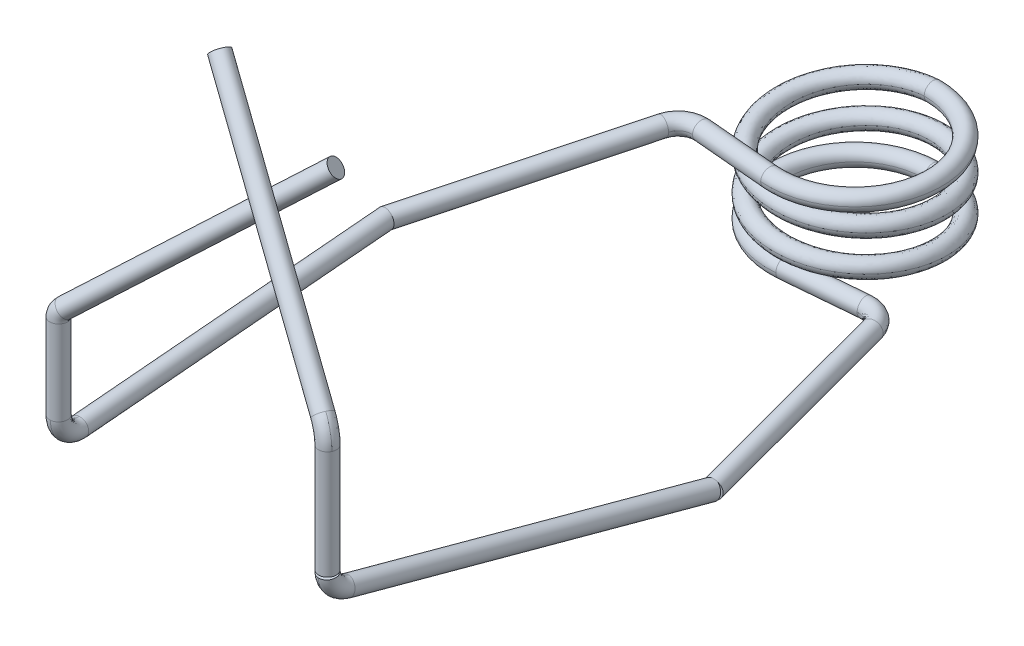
ISO-10303-21;
HEADER;
FILE_DESCRIPTION(('STEP AP214'),'2;1');
FILE_NAME('part.step','',(''),(''),'','','');
FILE_SCHEMA(('AUTOMOTIVE_DESIGN { 1 0 10303 214 1 1 1 1 }'));
ENDSEC;
DATA;
#1=APPLICATION_CONTEXT('core data for automotive mechanical design processes');
#2=APPLICATION_PROTOCOL_DEFINITION('international standard','automotive_design',2000,#1);
#3=PRODUCT_CONTEXT('',#1,'mechanical');
#4=PRODUCT('Part','Part','',(#3));
#5=PRODUCT_RELATED_PRODUCT_CATEGORY('part','',(#4));
#6=PRODUCT_DEFINITION_FORMATION('','',#4);
#7=PRODUCT_DEFINITION_CONTEXT('part definition',#1,'design');
#8=PRODUCT_DEFINITION('design','',#6,#7);
#9=PRODUCT_DEFINITION_SHAPE('','',#8);
#10=(LENGTH_UNIT() NAMED_UNIT(*) SI_UNIT(.MILLI.,.METRE.));
#11=(NAMED_UNIT(*) PLANE_ANGLE_UNIT() SI_UNIT($,.RADIAN.));
#12=(NAMED_UNIT(*) SI_UNIT($,.STERADIAN.) SOLID_ANGLE_UNIT());
#13=UNCERTAINTY_MEASURE_WITH_UNIT(LENGTH_MEASURE(1.E-05),#10,'distance_accuracy_value','');
#14=(GEOMETRIC_REPRESENTATION_CONTEXT(3) GLOBAL_UNCERTAINTY_ASSIGNED_CONTEXT((#13)) GLOBAL_UNIT_ASSIGNED_CONTEXT((#10,
#11,#12)) REPRESENTATION_CONTEXT('',''));
#15=CARTESIAN_POINT('',(0.,0.,0.));
#16=DIRECTION('',(0.,0.,1.));
#17=DIRECTION('',(1.,0.,0.));
#18=AXIS2_PLACEMENT_3D('',#15,#16,#17);
#19=CARTESIAN_POINT('',(1.655495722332,-5.05,74.55886432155));
#20=DIRECTION('',(0.,1.,0.));
#21=DIRECTION('',(-0.909090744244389,0.,-0.416598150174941));
#22=AXIS2_PLACEMENT_3D('',#19,#20,#21);
#23=PLANE('',#22);
#24=CARTESIAN_POINT('',(1.506052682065,-5.05,74.61469233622));
#25=DIRECTION('',(0.,1.,0.));
#26=DIRECTION('',(0.,0.,1.));
#27=AXIS2_PLACEMENT_3D('',#24,#25,#26);
#28=CIRCLE('',#27,0.100000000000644);
#29=CARTESIAN_POINT('',(1.506052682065,-5.05,74.7146923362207));
#30=VERTEX_POINT('',#29);
#31=EDGE_CURVE('E20',#30,#30,#28,.F.);
#32=ORIENTED_EDGE('',*,*,#31,.T.);
#33=EDGE_LOOP('',(#32));
#34=FACE_BOUND('',#33,.T.);
#35=ADVANCED_FACE('F16',(#34),#23,.F.);
#36=CARTESIAN_POINT('',(1.506052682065,-5.05,74.61469233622));
#37=DIRECTION('',(0.,1.,0.));
#38=DIRECTION('',(0.,0.,1.));
#39=AXIS2_PLACEMENT_3D('',#36,#37,#38);
#40=CYLINDRICAL_SURFACE('',#39,0.100000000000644);
#41=CARTESIAN_POINT('',(1.50605268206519,-3.835125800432,74.6146923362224));
#42=DIRECTION('',(0.,-1.,0.));
#43=DIRECTION('',(0.,0.,-1.));
#44=AXIS2_PLACEMENT_3D('',#41,#42,#43);
#45=CIRCLE('',#44,0.100000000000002);
#46=CARTESIAN_POINT('',(1.41514360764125,-3.835125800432,74.5730325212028));
#47=VERTEX_POINT('',#46);
#48=CARTESIAN_POINT('',(1.59696175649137,-3.835125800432,74.6563521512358));
#49=VERTEX_POINT('',#48);
#50=EDGE_CURVE('E109',#47,#49,#45,.T.);
#51=ORIENTED_EDGE('',*,*,#50,.T.);
#52=CARTESIAN_POINT('',(1.5060526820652,-3.835125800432,74.6146923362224));
#53=DIRECTION('',(0.,-1.,0.));
#54=DIRECTION('',(0.,0.,-1.));
#55=AXIS2_PLACEMENT_3D('',#52,#53,#54);
#56=CIRCLE('',#55,0.0999999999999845);
#57=EDGE_CURVE('E113',#49,#47,#56,.T.);
#58=ORIENTED_EDGE('',*,*,#57,.T.);
#59=EDGE_LOOP('',(#51,#58));
#60=FACE_BOUND('',#59,.T.);
#61=ORIENTED_EDGE('',*,*,#31,.F.);
#62=EDGE_LOOP('',(#61));
#63=FACE_BOUND('',#62,.T.);
#64=ADVANCED_FACE('F111',(#60,#63),#40,.T.);
#65=CARTESIAN_POINT('',(0.8942298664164,-3.835125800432,74.3204968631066));
#66=CARTESIAN_POINT('',(0.860146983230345,-3.835125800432,74.3753835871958));
#67=CARTESIAN_POINT('',(0.878788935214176,-3.835125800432,74.4372436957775));
#68=CARTESIAN_POINT('',(0.937523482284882,-3.835125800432,74.4641592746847));
#69=CARTESIAN_POINT('',(0.996258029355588,-3.835125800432,74.491074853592));
#70=CARTESIAN_POINT('',(1.05528521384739,-3.835125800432,74.4648072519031));
#71=CARTESIAN_POINT('',(1.0746067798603,-3.835125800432,74.4031560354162));
#72=(BOUNDED_CURVE() B_SPLINE_CURVE(3,(#65,#66,#67,#68,#69,#70,#71),.UNSPECIFIED.,.F.,
.F.) B_SPLINE_CURVE_WITH_KNOTS((4,3,4),(0.,0.5,1.),
.UNSPECIFIED.) CURVE() GEOMETRIC_REPRESENTATION_ITEM() RATIONAL_B_SPLINE_CURVE((1.,
0.774125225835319,0.774125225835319,1.,0.774125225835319,0.774125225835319,1.)) REPRESENTATION_ITEM(''));
#73=CARTESIAN_POINT('',(1.242617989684,-3.835125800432,74.49397126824));
#74=DIRECTION('',(-0.416598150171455,0.,0.909090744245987));
#75=AXIS1_PLACEMENT('',#73,#74);
#76=SURFACE_OF_REVOLUTION('',#72,#75);
#77=CARTESIAN_POINT('',(1.41195054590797,-3.61314280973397,74.57156927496));
#78=DIRECTION('',(-0.696403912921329,0.642787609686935,-0.319132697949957));
#79=DIRECTION('',(-0.584352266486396,-0.766044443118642,-0.267784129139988));
#80=AXIS2_PLACEMENT_3D('',#77,#78,#79);
#81=CIRCLE('',#80,0.0999999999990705);
#82=CARTESIAN_POINT('',(1.47038577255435,-3.53653836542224,74.5983476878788));
#83=VERTEX_POINT('',#82);
#84=CARTESIAN_POINT('',(1.35351531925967,-3.68974725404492,74.5447908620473));
#85=VERTEX_POINT('',#84);
#86=EDGE_CURVE('E130',#83,#85,#81,.F.);
#87=ORIENTED_EDGE('',*,*,#86,.T.);
#88=CARTESIAN_POINT('',(1.24261798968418,-3.835125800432,74.4939712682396));
#89=DIRECTION('',(-0.416598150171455,0.,0.909090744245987));
#90=DIRECTION('',(-0.909090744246,0.,-0.416598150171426));
#91=AXIS2_PLACEMENT_3D('',#88,#89,#90);
#92=CIRCLE('',#91,0.18977821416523);
#93=EDGE_CURVE('E123',#85,#47,#92,.F.);
#94=ORIENTED_EDGE('',*,*,#93,.T.);
#95=ORIENTED_EDGE('',*,*,#57,.F.);
#96=CARTESIAN_POINT('',(1.24261798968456,-3.835125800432,74.4939712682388));
#97=DIRECTION('',(-0.416598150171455,0.,0.909090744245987));
#98=DIRECTION('',(-0.909090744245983,0.,-0.416598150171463));
#99=AXIS2_PLACEMENT_3D('',#96,#97,#98);
#100=CIRCLE('',#99,0.389778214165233);
#101=EDGE_CURVE('E118',#49,#83,#100,.T.);
#102=ORIENTED_EDGE('',*,*,#101,.T.);
#103=EDGE_LOOP('',(#87,#94,#95,#102));
#104=FACE_BOUND('',#103,.T.);
#105=ADVANCED_FACE('F121',(#104),#76,.T.);
#106=CARTESIAN_POINT('',(1.06413672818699,-3.835125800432,74.4260035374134));
#107=CARTESIAN_POINT('',(1.09821961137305,-3.835125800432,74.3711168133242));
#108=CARTESIAN_POINT('',(1.07957765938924,-3.835125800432,74.3092567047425));
#109=CARTESIAN_POINT('',(1.02084311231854,-3.835125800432,74.2823411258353));
#110=CARTESIAN_POINT('',(0.962108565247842,-3.835125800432,74.255425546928));
#111=CARTESIAN_POINT('',(0.903081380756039,-3.835125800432,74.2816931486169));
#112=CARTESIAN_POINT('',(0.883759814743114,-3.835125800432,74.3433443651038));
#113=(BOUNDED_CURVE() B_SPLINE_CURVE(3,(#106,#107,#108,#109,#110,#111,#112),.UNSPECIFIED.,.F.,
.F.) B_SPLINE_CURVE_WITH_KNOTS((4,3,4),(0.,0.5,1.),
.UNSPECIFIED.) CURVE() GEOMETRIC_REPRESENTATION_ITEM() RATIONAL_B_SPLINE_CURVE((1.,
0.774125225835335,0.774125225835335,1.,0.774125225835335,0.774125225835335,1.)) REPRESENTATION_ITEM(''));
#114=CARTESIAN_POINT('',(1.242617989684,-3.835125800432,74.49397126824));
#115=DIRECTION('',(-0.416598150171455,0.,0.909090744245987));
#116=AXIS1_PLACEMENT('',#114,#115);
#117=SURFACE_OF_REVOLUTION('',#113,#116);
#118=CARTESIAN_POINT('',(1.41195054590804,-3.61314280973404,74.57156927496));
#119=DIRECTION('',(-0.696403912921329,0.642787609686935,-0.319132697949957));
#120=DIRECTION('',(-0.58435226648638,-0.766044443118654,-0.267784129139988));
#121=AXIS2_PLACEMENT_3D('',#118,#119,#120);
#122=CIRCLE('',#121,0.0999999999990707);
#123=EDGE_CURVE('E127',#85,#83,#122,.F.);
#124=ORIENTED_EDGE('',*,*,#123,.T.);
#125=ORIENTED_EDGE('',*,*,#101,.F.);
#126=ORIENTED_EDGE('',*,*,#50,.F.);
#127=ORIENTED_EDGE('',*,*,#93,.F.);
#128=EDGE_LOOP('',(#124,#125,#126,#127));
#129=FACE_BOUND('',#128,.T.);
#130=ADVANCED_FACE('F125',(#129),#117,.T.);
#131=CARTESIAN_POINT('',(-0.6095621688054,-1.556823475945,73.52088331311));
#132=DIRECTION('',(-0.696403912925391,0.642787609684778,-0.319132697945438));
#133=DIRECTION('',(-0.584352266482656,-0.766044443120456,-0.267784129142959));
#134=AXIS2_PLACEMENT_3D('',#131,#132,#133);
#135=PLANE('',#134);
#136=CARTESIAN_POINT('',(-0.722439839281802,-1.64307964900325,73.593467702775));
#137=DIRECTION('',(-0.696403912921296,0.642787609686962,-0.319132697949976));
#138=DIRECTION('',(-0.678253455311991,-0.734828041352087,0.));
#139=AXIS2_PLACEMENT_3D('',#136,#137,#138);
#140=CIRCLE('',#139,0.0999999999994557);
#141=CARTESIAN_POINT('',(-0.790265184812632,-1.71656245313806,73.593467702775));
#142=VERTEX_POINT('',#141);
#143=EDGE_CURVE('E298',#142,#142,#140,.T.);
#144=ORIENTED_EDGE('',*,*,#143,.T.);
#145=EDGE_LOOP('',(#144));
#146=FACE_BOUND('',#145,.T.);
#147=ADVANCED_FACE('F159',(#146),#135,.T.);
#148=CARTESIAN_POINT('',(1.41195054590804,-3.61314280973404,74.57156927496));
#149=DIRECTION('',(-0.696403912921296,0.642787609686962,-0.319132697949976));
#150=DIRECTION('',(-0.678253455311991,-0.734828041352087,0.));
#151=AXIS2_PLACEMENT_3D('',#148,#149,#150);
#152=CYLINDRICAL_SURFACE('',#151,0.0999999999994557);
#153=ORIENTED_EDGE('',*,*,#143,.F.);
#154=EDGE_LOOP('',(#153));
#155=FACE_BOUND('',#154,.T.);
#156=ORIENTED_EDGE('',*,*,#123,.F.);
#157=ORIENTED_EDGE('',*,*,#86,.F.);
#158=EDGE_LOOP('',(#156,#157));
#159=FACE_BOUND('',#158,.T.);
#160=CARTESIAN_POINT('',(0.115613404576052,-2.54715170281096,73.977512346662));
#161=CARTESIAN_POINT('',(0.118943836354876,-2.54957588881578,73.9771791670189));
#162=CARTESIAN_POINT('',(0.122332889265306,-2.5518851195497,73.9765460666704));
#163=CARTESIAN_POINT('',(0.12919617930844,-2.55612606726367,73.9747089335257));
#164=CARTESIAN_POINT('',(0.132670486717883,-2.5580574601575,73.973504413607));
#165=CARTESIAN_POINT('',(0.13967818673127,-2.56139608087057,73.9705991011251));
#166=CARTESIAN_POINT('',(0.143211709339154,-2.56280193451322,73.9688970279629));
#167=CARTESIAN_POINT('',(0.15028495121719,-2.5649605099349,73.9651334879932));
#168=CARTESIAN_POINT('',(0.153824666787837,-2.56571353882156,73.9630721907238));
#169=CARTESIAN_POINT('',(0.160709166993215,-2.56649093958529,73.9588597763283));
#170=CARTESIAN_POINT('',(0.164055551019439,-2.56654660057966,73.9567168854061));
#171=CARTESIAN_POINT('',(0.170684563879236,-2.56601633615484,73.9524119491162));
#172=CARTESIAN_POINT('',(0.173967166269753,-2.56543015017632,73.9502498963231));
#173=CARTESIAN_POINT('',(0.180575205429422,-2.56362467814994,73.9459510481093));
#174=CARTESIAN_POINT('',(0.183896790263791,-2.56238018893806,73.9438190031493));
#175=CARTESIAN_POINT('',(0.190413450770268,-2.55931614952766,73.9397882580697));
#176=CARTESIAN_POINT('',(0.193608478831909,-2.55749638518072,73.9378896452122));
#177=CARTESIAN_POINT('',(0.200138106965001,-2.55315541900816,73.9342344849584));
#178=CARTESIAN_POINT('',(0.203456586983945,-2.55058359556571,73.9325091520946));
#179=CARTESIAN_POINT('',(0.209839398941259,-2.54492218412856,73.9294894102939));
#180=CARTESIAN_POINT('',(0.212903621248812,-2.54183237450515,73.928195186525));
#181=CARTESIAN_POINT('',(0.218856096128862,-2.53501876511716,73.9259977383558));
#182=CARTESIAN_POINT('',(0.221724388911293,-2.53126888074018,73.9251209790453));
#183=CARTESIAN_POINT('',(0.22694596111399,-2.52335105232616,73.9238516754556));
#184=CARTESIAN_POINT('',(0.229299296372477,-2.51918315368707,73.923459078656));
#185=CARTESIAN_POINT('',(0.233309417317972,-2.51057275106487,73.92308646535));
#186=CARTESIAN_POINT('',(0.234974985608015,-2.50613459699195,73.923101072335));
#187=CARTESIAN_POINT('',(0.237509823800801,-2.49704648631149,73.9234025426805));
#188=CARTESIAN_POINT('',(0.238379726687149,-2.49239670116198,73.9236891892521));
#189=CARTESIAN_POINT('',(0.239206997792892,-2.4833402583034,73.9243352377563));
#190=CARTESIAN_POINT('',(0.239221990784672,-2.47893837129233,73.9246884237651));
#191=CARTESIAN_POINT('',(0.238482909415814,-2.47019421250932,73.9253180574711));
#192=CARTESIAN_POINT('',(0.237728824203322,-2.46585194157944,73.9255945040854));
#193=CARTESIAN_POINT('',(0.235552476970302,-2.45746683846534,73.9259209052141));
#194=CARTESIAN_POINT('',(0.234150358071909,-2.45341896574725,73.9259772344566));
#195=CARTESIAN_POINT('',(0.230787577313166,-2.44557034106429,73.9257810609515));
#196=CARTESIAN_POINT('',(0.228826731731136,-2.44176967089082,73.9255284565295));
#197=CARTESIAN_POINT('',(0.224336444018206,-2.43427891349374,73.9246267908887));
#198=CARTESIAN_POINT('',(0.22178145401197,-2.43060671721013,73.9239564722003));
#199=CARTESIAN_POINT('',(0.216292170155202,-2.42367729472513,73.9221691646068));
#200=CARTESIAN_POINT('',(0.213357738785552,-2.4204202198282,73.9210520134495));
#201=CARTESIAN_POINT('',(0.207028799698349,-2.41421736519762,73.9182999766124));
#202=CARTESIAN_POINT('',(0.203617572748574,-2.41130006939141,73.9166391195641));
#203=CARTESIAN_POINT('',(0.196559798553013,-2.40610138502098,73.9128754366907));
#204=CARTESIAN_POINT('',(0.192913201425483,-2.40382013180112,73.9107725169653));
#205=CARTESIAN_POINT('',(0.185461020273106,-2.40001485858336,73.9062396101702));
#206=CARTESIAN_POINT('',(0.181656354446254,-2.39848698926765,73.9038113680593));
#207=CARTESIAN_POINT('',(0.173916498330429,-2.39628430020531,73.8987838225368));
#208=CARTESIAN_POINT('',(0.169981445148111,-2.3956086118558,73.8961846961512));
#209=CARTESIAN_POINT('',(0.162339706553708,-2.39520074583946,73.8912446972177));
#210=CARTESIAN_POINT('',(0.158639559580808,-2.39539820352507,73.8888996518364));
#211=CARTESIAN_POINT('',(0.151210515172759,-2.39657382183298,73.8844631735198));
#212=CARTESIAN_POINT('',(0.147481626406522,-2.39755175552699,73.8823716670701));
#213=CARTESIAN_POINT('',(0.140366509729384,-2.40008392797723,73.8787956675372));
#214=CARTESIAN_POINT('',(0.136978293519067,-2.40158161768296,73.8772745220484));
#215=CARTESIAN_POINT('',(0.130259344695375,-2.40503397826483,73.8747137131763));
#216=CARTESIAN_POINT('',(0.126928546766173,-2.40698808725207,73.8736734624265));
#217=CARTESIAN_POINT('',(0.120934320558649,-2.41084353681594,73.872267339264));
#218=CARTESIAN_POINT('',(0.118256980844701,-2.41269316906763,73.8718147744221));
#219=CARTESIAN_POINT('',(0.111823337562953,-2.41737570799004,73.8711723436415));
#220=CARTESIAN_POINT('',(0.108102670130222,-2.42028715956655,73.8711815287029));
#221=CARTESIAN_POINT('',(0.10084128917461,-2.42624249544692,73.8719746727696));
#222=CARTESIAN_POINT('',(0.0973011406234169,-2.42928674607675,73.8727609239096));
#223=CARTESIAN_POINT('',(0.0904794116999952,-2.43536630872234,73.8750758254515));
#224=CARTESIAN_POINT('',(0.0871973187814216,-2.43840162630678,73.8766029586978));
#225=CARTESIAN_POINT('',(0.0809773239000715,-2.44438314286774,73.8803500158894));
#226=CARTESIAN_POINT('',(0.0780386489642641,-2.44732953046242,73.8825683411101));
#227=CARTESIAN_POINT('',(0.0740164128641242,-2.45160982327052,73.8863243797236));
#228=CARTESIAN_POINT('',(0.0727569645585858,-2.45299259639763,73.8876241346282));
#229=CARTESIAN_POINT('',(0.0703603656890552,-2.4557288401,73.890360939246));
#230=CARTESIAN_POINT('',(0.0692232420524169,-2.45708230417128,73.8917980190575));
#231=CARTESIAN_POINT('',(0.0660874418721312,-2.46101464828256,73.8962050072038));
#232=CARTESIAN_POINT('',(0.064279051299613,-2.4635542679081,73.8993501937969));
#233=CARTESIAN_POINT('',(0.0613064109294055,-2.46854299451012,73.9060016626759));
#234=CARTESIAN_POINT('',(0.0601427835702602,-2.47099201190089,73.9095082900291));
#235=CARTESIAN_POINT('',(0.058558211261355,-2.47584221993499,73.9167280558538));
#236=CARTESIAN_POINT('',(0.0581385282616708,-2.47824332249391,73.9204415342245));
#237=CARTESIAN_POINT('',(0.0580861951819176,-2.48304281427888,73.9278738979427));
#238=CARTESIAN_POINT('',(0.0584533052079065,-2.48544120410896,73.9315927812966));
#239=CARTESIAN_POINT('',(0.0599623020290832,-2.49036366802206,73.9389561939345));
#240=CARTESIAN_POINT('',(0.0611281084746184,-2.49288932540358,73.9425947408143));
#241=CARTESIAN_POINT('',(0.0641541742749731,-2.49803899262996,73.9494949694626));
#242=CARTESIAN_POINT('',(0.0660149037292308,-2.50066306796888,73.9527563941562));
#243=CARTESIAN_POINT('',(0.0703865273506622,-2.50614564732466,73.9588997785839));
#244=CARTESIAN_POINT('',(0.072921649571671,-2.50900937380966,73.9617597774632));
#245=CARTESIAN_POINT('',(0.0784539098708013,-2.51486382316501,73.966833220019));
#246=CARTESIAN_POINT('',(0.0814513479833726,-2.51785462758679,73.9690462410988));
#247=CARTESIAN_POINT('',(0.0877864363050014,-2.5239184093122,73.9727586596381));
#248=CARTESIAN_POINT('',(0.0911241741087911,-2.52699140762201,73.9742578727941));
#249=CARTESIAN_POINT('',(0.0980457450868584,-2.53312841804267,73.9764916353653));
#250=CARTESIAN_POINT('',(0.101629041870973,-2.53619243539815,73.9772277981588));
#251=CARTESIAN_POINT('',(0.106984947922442,-2.54055235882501,73.9777253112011));
#252=CARTESIAN_POINT('',(0.108686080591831,-2.54190631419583,73.9777987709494));
#253=CARTESIAN_POINT('',(0.112123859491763,-2.54456803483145,73.9777799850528));
#254=CARTESIAN_POINT('',(0.113860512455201,-2.54587579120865,73.9776877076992));
#255=CARTESIAN_POINT('',(0.115613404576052,-2.54715170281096,73.977512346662));
#256=B_SPLINE_CURVE_WITH_KNOTS('',3,(#160,#161,#162,#163,#164,#165,#166,#167,#168,#169,#170,
#171,#172,#173,#174,#175,#176,#177,#178,#179,#180,#181,#182,#183,#184,#185,#186,#187,#188,#189,
#190,#191,#192,#193,#194,#195,#196,#197,#198,#199,#200,#201,#202,#203,#204,#205,#206,#207,#208,
#209,#210,#211,#212,#213,#214,#215,#216,#217,#218,#219,#220,#221,#222,#223,#224,#225,#226,#227,
#228,#229,#230,#231,#232,#233,#234,#235,#236,#237,#238,#239,#240,#241,#242,#243,#244,#245,#246,
#247,#248,#249,#250,#251,#252,#253,#254,#255),.UNSPECIFIED.,.T.,.F.,(4,2,2,2,2,2,2,2,2,2,2,2,2,
2,2,2,2,2,2,2,2,2,2,2,2,2,2,2,2,2,2,2,2,2,2,2,2,2,2,2,2,2,2,2,2,2,2,4),(0.,0.0123907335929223,
0.0247920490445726,0.0372255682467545,0.0496532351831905,0.0615211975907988,0.0733939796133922,
0.0857582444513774,0.0981271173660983,0.111685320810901,0.12524934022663,0.139585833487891,
0.15392077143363,0.168066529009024,0.182201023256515,0.195381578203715,0.208562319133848,
0.221358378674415,0.234158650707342,0.247670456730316,0.261187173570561,0.275477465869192,
0.289770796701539,0.303990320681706,0.318195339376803,0.33127740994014,0.344355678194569,
0.356313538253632,0.368256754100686,0.378089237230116,0.392185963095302,0.406324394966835,
0.420433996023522,0.434511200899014,0.441337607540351,0.44816551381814,0.461386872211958,
0.474620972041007,0.487877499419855,0.501129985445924,0.514797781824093,0.528474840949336,
0.542731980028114,0.556998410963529,0.571268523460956,0.585508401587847,0.592028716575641,
0.598550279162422),.UNSPECIFIED.);
#257=CARTESIAN_POINT('',(0.115613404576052,-2.54715170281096,73.977512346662));
#258=VERTEX_POINT('',#257);
#259=EDGE_CURVE('E297',#258,#258,#256,.T.);
#260=ORIENTED_EDGE('',*,*,#259,.T.);
#261=EDGE_LOOP('',(#260));
#262=FACE_BOUND('',#261,.T.);
#263=ADVANCED_FACE('F162',(#155,#159,#262),#152,.T.);
#264=CARTESIAN_POINT('',(0.5106926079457,-1.990052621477,73.56619108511));
#265=DIRECTION('',(-0.696403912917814,-0.642787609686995,0.319132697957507));
#266=DIRECTION('',(0.584352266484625,-0.766044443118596,-0.267784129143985));
#267=AXIS2_PLACEMENT_3D('',#264,#265,#266);
#268=PLANE('',#267);
#269=CARTESIAN_POINT('',(0.623570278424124,-2.07630879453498,73.63877547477));
#270=DIRECTION('',(-0.696403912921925,-0.642787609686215,0.319132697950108));
#271=DIRECTION('',(0.678253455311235,-0.734828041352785,0.));
#272=AXIS2_PLACEMENT_3D('',#269,#270,#271);
#273=CIRCLE('',#272,0.100000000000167);
#274=CARTESIAN_POINT('',(0.691395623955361,-2.14979159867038,73.63877547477));
#275=VERTEX_POINT('',#274);
#276=EDGE_CURVE('E191',#275,#275,#273,.F.);
#277=ORIENTED_EDGE('',*,*,#276,.T.);
#278=EDGE_LOOP('',(#277));
#279=FACE_BOUND('',#278,.T.);
#280=ADVANCED_FACE('F164',(#279),#268,.F.);
#281=CARTESIAN_POINT('',(0.623570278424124,-2.07630879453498,73.63877547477));
#282=DIRECTION('',(-0.696403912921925,-0.642787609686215,0.319132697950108));
#283=DIRECTION('',(0.678253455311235,-0.734828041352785,0.));
#284=AXIS2_PLACEMENT_3D('',#281,#282,#283);
#285=CYLINDRICAL_SURFACE('',#284,0.100000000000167);
#286=ORIENTED_EDGE('',*,*,#259,.F.);
#287=EDGE_LOOP('',(#286));
#288=FACE_BOUND('',#287,.T.);
#289=CARTESIAN_POINT('',(-1.46564146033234,-4.00467162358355,74.596173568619));
#290=DIRECTION('',(0.696403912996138,0.642787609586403,-0.319132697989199));
#291=DIRECTION('',(-0.678253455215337,0.7348280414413,0.));
#292=AXIS2_PLACEMENT_3D('',#289,#290,#291);
#293=CIRCLE('',#292,0.0999999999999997);
#294=CARTESIAN_POINT('',(-1.40720623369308,-4.08127606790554,74.5693951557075));
#295=VERTEX_POINT('',#294);
#296=CARTESIAN_POINT('',(-1.5240766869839,-3.92806717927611,74.622951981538));
#297=VERTEX_POINT('',#296);
#298=EDGE_CURVE('E283',#295,#297,#293,.T.);
#299=ORIENTED_EDGE('',*,*,#298,.T.);
#300=CARTESIAN_POINT('',(-1.46564146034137,-4.00467162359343,74.5961735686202));
#301=DIRECTION('',(-0.696403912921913,-0.642787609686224,0.319132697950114));
#302=DIRECTION('',(0.584352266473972,-0.766044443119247,-0.267784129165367));
#303=AXIS2_PLACEMENT_3D('',#300,#301,#302);
#304=CIRCLE('',#303,0.100000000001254);
#305=EDGE_CURVE('E295',#295,#297,#304,.T.);
#306=ORIENTED_EDGE('',*,*,#305,.F.);
#307=EDGE_LOOP('',(#299,#306));
#308=FACE_BOUND('',#307,.T.);
#309=ORIENTED_EDGE('',*,*,#276,.F.);
#310=EDGE_LOOP('',(#309));
#311=FACE_BOUND('',#310,.T.);
#312=ADVANCED_FACE('F167',(#288,#308,#311),#285,.T.);
#313=CARTESIAN_POINT('',(-1.26746811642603,-4.27132559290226,74.4915362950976));
#314=CARTESIAN_POINT('',(-1.23602169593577,-4.27754489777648,74.5476311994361));
#315=CARTESIAN_POINT('',(-1.24079145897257,-4.24482098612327,74.6031342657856));
#316=CARTESIAN_POINT('',(-1.27854529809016,-4.195328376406,74.6204352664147));
#317=CARTESIAN_POINT('',(-1.31629913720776,-4.14583576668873,74.6377362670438));
#318=CARTESIAN_POINT('',(-1.36145413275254,-4.11311185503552,74.6051116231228));
#319=CARTESIAN_POINT('',(-1.38341216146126,-4.11933115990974,74.5446685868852));
#320=(BOUNDED_CURVE() B_SPLINE_CURVE(3,(#313,#314,#315,#316,#317,#318,#319),.UNSPECIFIED.,.F.,
.F.) B_SPLINE_CURVE_WITH_KNOTS((4,3,4),(0.,0.5,1.),
.UNSPECIFIED.) CURVE() GEOMETRIC_REPRESENTATION_ITEM() RATIONAL_B_SPLINE_CURVE((1.,
0.774125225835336,0.774125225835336,1.,0.774125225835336,0.774125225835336,1.)) REPRESENTATION_ITEM(''));
#321=CARTESIAN_POINT('',(-1.392923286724,-4.1,74.56284988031));
#322=DIRECTION('',(0.416598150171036,0.,0.909090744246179));
#323=AXIS1_PLACEMENT('',#321,#322);
#324=SURFACE_OF_REVOLUTION('',#320,#323);
#325=CARTESIAN_POINT('',(-1.506052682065,-4.1,74.61469233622));
#326=DIRECTION('',(0.,1.,0.));
#327=DIRECTION('',(0.0805468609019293,0.,0.996750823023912));
#328=AXIS2_PLACEMENT_3D('',#325,#326,#327);
#329=CIRCLE('',#328,0.0999999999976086);
#330=CARTESIAN_POINT('',(-1.59696175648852,-4.1,74.6563521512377));
#331=VERTEX_POINT('',#330);
#332=CARTESIAN_POINT('',(-1.41514360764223,-4.1,74.5730325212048));
#333=VERTEX_POINT('',#332);
#334=EDGE_CURVE('E262',#331,#333,#329,.T.);
#335=ORIENTED_EDGE('',*,*,#334,.T.);
#336=CARTESIAN_POINT('',(-1.39292328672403,-4.1,74.5628498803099));
#337=DIRECTION('',(0.416598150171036,0.,0.909090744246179));
#338=DIRECTION('',(0.584352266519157,-0.766044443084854,-0.267784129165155));
#339=AXIS2_PLACEMENT_3D('',#336,#337,#338);
#340=CIRCLE('',#339,0.0244423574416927);
#341=EDGE_CURVE('E286',#333,#295,#340,.F.);
#342=ORIENTED_EDGE('',*,*,#341,.T.);
#343=ORIENTED_EDGE('',*,*,#305,.T.);
#344=CARTESIAN_POINT('',(-1.39292328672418,-4.1,74.5628498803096));
#345=DIRECTION('',(0.416598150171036,0.,0.909090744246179));
#346=DIRECTION('',(0.584352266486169,-0.76604444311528,-0.267784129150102));
#347=AXIS2_PLACEMENT_3D('',#344,#345,#346);
#348=CIRCLE('',#347,0.224442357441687);
#349=EDGE_CURVE('E268',#297,#331,#348,.T.);
#350=ORIENTED_EDGE('',*,*,#349,.T.);
#351=EDGE_LOOP('',(#335,#342,#343,#350));
#352=FACE_BOUND('',#351,.T.);
#353=ADVANCED_FACE('F251',(#352),#324,.T.);
#354=CARTESIAN_POINT('',(-1.37294210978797,-4.11933115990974,74.5675160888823));
#355=CARTESIAN_POINT('',(-1.40438853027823,-4.11311185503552,74.5114211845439));
#356=CARTESIAN_POINT('',(-1.39961876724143,-4.14583576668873,74.4559181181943));
#357=CARTESIAN_POINT('',(-1.36186492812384,-4.195328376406,74.4386171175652));
#358=CARTESIAN_POINT('',(-1.32411108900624,-4.24482098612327,74.4213161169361));
#359=CARTESIAN_POINT('',(-1.27895609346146,-4.27754489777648,74.4539407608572));
#360=CARTESIAN_POINT('',(-1.25699806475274,-4.27132559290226,74.5143837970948));
#361=(BOUNDED_CURVE() B_SPLINE_CURVE(3,(#354,#355,#356,#357,#358,#359,#360),.UNSPECIFIED.,.F.,
.F.) B_SPLINE_CURVE_WITH_KNOTS((4,3,4),(0.,0.5,1.),
.UNSPECIFIED.) CURVE() GEOMETRIC_REPRESENTATION_ITEM() RATIONAL_B_SPLINE_CURVE((1.,
0.774125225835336,0.774125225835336,1.,0.774125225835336,0.774125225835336,1.)) REPRESENTATION_ITEM(''));
#362=CARTESIAN_POINT('',(-1.392923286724,-4.1,74.56284988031));
#363=DIRECTION('',(0.416598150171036,0.,0.909090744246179));
#364=AXIS1_PLACEMENT('',#362,#363);
#365=SURFACE_OF_REVOLUTION('',#361,#364);
#366=CARTESIAN_POINT('',(-1.506052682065,-4.1,74.61469233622));
#367=DIRECTION('',(0.,1.,0.));
#368=DIRECTION('',(0.0805468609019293,0.,0.996750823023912));
#369=AXIS2_PLACEMENT_3D('',#366,#367,#368);
#370=CIRCLE('',#369,0.0999999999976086);
#371=EDGE_CURVE('E267',#333,#331,#370,.T.);
#372=ORIENTED_EDGE('',*,*,#371,.T.);
#373=ORIENTED_EDGE('',*,*,#349,.F.);
#374=ORIENTED_EDGE('',*,*,#298,.F.);
#375=ORIENTED_EDGE('',*,*,#341,.F.);
#376=EDGE_LOOP('',(#372,#373,#374,#375));
#377=FACE_BOUND('',#376,.T.);
#378=ADVANCED_FACE('F246',(#377),#365,.T.);
#379=CARTESIAN_POINT('',(-1.506052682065,-5.05,74.61469233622));
#380=DIRECTION('',(0.,1.,0.));
#381=DIRECTION('',(-1.,0.,0.));
#382=AXIS2_PLACEMENT_3D('',#379,#380,#381);
#383=CYLINDRICAL_SURFACE('',#382,0.0999999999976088);
#384=CARTESIAN_POINT('',(-1.50605268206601,-5.05,74.614692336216));
#385=DIRECTION('',(-2.71986750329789E-12,1.,1.12040934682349E-13));
#386=DIRECTION('',(-1.,-2.71986750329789E-12,0.));
#387=AXIS2_PLACEMENT_3D('',#384,#385,#386);
#388=CIRCLE('',#387,0.100000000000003);
#389=CARTESIAN_POINT('',(-1.514107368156,-5.05000000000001,74.5150172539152));
#390=VERTEX_POINT('',#389);
#391=CARTESIAN_POINT('',(-1.49799799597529,-5.05000000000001,74.7143674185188));
#392=VERTEX_POINT('',#391);
#393=EDGE_CURVE('E190',#390,#392,#388,.T.);
#394=ORIENTED_EDGE('',*,*,#393,.T.);
#395=CARTESIAN_POINT('',(-1.506052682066,-5.05000000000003,74.614692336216));
#396=DIRECTION('',(-2.89125934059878E-12,1.,3.41390999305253E-13));
#397=DIRECTION('',(-1.,-2.89125934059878E-12,0.));
#398=AXIS2_PLACEMENT_3D('',#395,#396,#397);
#399=CIRCLE('',#398,0.0999999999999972);
#400=EDGE_CURVE('E279',#392,#390,#399,.T.);
#401=ORIENTED_EDGE('',*,*,#400,.T.);
#402=EDGE_LOOP('',(#394,#401));
#403=FACE_BOUND('',#402,.T.);
#404=ORIENTED_EDGE('',*,*,#371,.F.);
#405=ORIENTED_EDGE('',*,*,#334,.F.);
#406=EDGE_LOOP('',(#404,#405));
#407=FACE_BOUND('',#406,.T.);
#408=ADVANCED_FACE('F243',(#403,#407),#383,.T.);
#409=CARTESIAN_POINT('',(-1.53871469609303,-4.89920732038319,74.3665167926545));
#410=CARTESIAN_POINT('',(-1.47482707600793,-4.90732604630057,74.3613540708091));
#411=CARTESIAN_POINT('',(-1.42651431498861,-4.86460801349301,74.3574499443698));
#412=CARTESIAN_POINT('',(-1.42651431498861,-4.8,74.3574499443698));
#413=CARTESIAN_POINT('',(-1.42651431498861,-4.73539198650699,74.3574499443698));
#414=CARTESIAN_POINT('',(-1.47482707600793,-4.69267395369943,74.3613540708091));
#415=CARTESIAN_POINT('',(-1.53871469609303,-4.70079267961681,74.3665167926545));
#416=(BOUNDED_CURVE() B_SPLINE_CURVE(3,(#409,#410,#411,#412,#413,#414,#415),.UNSPECIFIED.,.F.,
.F.) B_SPLINE_CURVE_WITH_KNOTS((4,3,4),(0.,0.5,1.),
.UNSPECIFIED.) CURVE() GEOMETRIC_REPRESENTATION_ITEM() RATIONAL_B_SPLINE_CURVE((1.,
0.774125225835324,0.774125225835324,1.,0.774125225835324,0.774125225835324,1.)) REPRESENTATION_ITEM(''));
#417=CARTESIAN_POINT('',(-1.526189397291,-5.05,74.36550463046));
#418=DIRECTION('',(-0.996750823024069,0.,0.0805468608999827));
#419=AXIS1_PLACEMENT('',#417,#418);
#420=SURFACE_OF_REVOLUTION('',#416,#419);
#421=CARTESIAN_POINT('',(-1.52618939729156,-5.3,74.3655046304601));
#422=DIRECTION('',(0.080546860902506,0.,0.996750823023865));
#423=DIRECTION('',(0.996750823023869,0.,-0.08054686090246));
#424=AXIS2_PLACEMENT_3D('',#421,#422,#423);
#425=CIRCLE('',#424,0.100000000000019);
#426=CARTESIAN_POINT('',(-1.52618939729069,-5.40000000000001,74.36550463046));
#427=VERTEX_POINT('',#426);
#428=CARTESIAN_POINT('',(-1.526189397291,-5.19999999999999,74.36550463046));
#429=VERTEX_POINT('',#428);
#430=EDGE_CURVE('E73',#427,#429,#425,.T.);
#431=ORIENTED_EDGE('',*,*,#430,.T.);
#432=CARTESIAN_POINT('',(-1.526189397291,-5.05,74.36550463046));
#433=DIRECTION('',(-0.996750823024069,0.,0.0805468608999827));
#434=DIRECTION('',(0.,1.,1.85037170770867E-13));
#435=AXIS2_PLACEMENT_3D('',#432,#433,#434);
#436=CIRCLE('',#435,0.149999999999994);
#437=EDGE_CURVE('E224',#429,#390,#436,.T.);
#438=ORIENTED_EDGE('',*,*,#437,.T.);
#439=ORIENTED_EDGE('',*,*,#400,.F.);
#440=CARTESIAN_POINT('',(-1.52618939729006,-5.05,74.36550463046));
#441=DIRECTION('',(-0.996750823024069,0.,0.0805468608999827));
#442=DIRECTION('',(0.,1.,0.));
#443=AXIS2_PLACEMENT_3D('',#440,#441,#442);
#444=CIRCLE('',#443,0.350000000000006);
#445=EDGE_CURVE('E229',#392,#427,#444,.F.);
#446=ORIENTED_EDGE('',*,*,#445,.T.);
#447=EDGE_LOOP('',(#431,#438,#439,#446));
#448=FACE_BOUND('',#447,.T.);
#449=ADVANCED_FACE('F240',(#448),#420,.T.);
#450=CARTESIAN_POINT('',(-1.51366409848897,-4.70079267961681,74.3644924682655));
#451=CARTESIAN_POINT('',(-1.57755171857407,-4.69267395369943,74.3696551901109));
#452=CARTESIAN_POINT('',(-1.62586447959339,-4.73539198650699,74.3735593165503));
#453=CARTESIAN_POINT('',(-1.62586447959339,-4.8,74.3735593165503));
#454=CARTESIAN_POINT('',(-1.62586447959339,-4.86460801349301,74.3735593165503));
#455=CARTESIAN_POINT('',(-1.57755171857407,-4.90732604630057,74.3696551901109));
#456=CARTESIAN_POINT('',(-1.51366409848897,-4.89920732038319,74.3644924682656));
#457=(BOUNDED_CURVE() B_SPLINE_CURVE(3,(#450,#451,#452,#453,#454,#455,#456),.UNSPECIFIED.,.F.,
.F.) B_SPLINE_CURVE_WITH_KNOTS((4,3,4),(0.,0.5,1.),
.UNSPECIFIED.) CURVE() GEOMETRIC_REPRESENTATION_ITEM() RATIONAL_B_SPLINE_CURVE((1.,
0.774125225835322,0.774125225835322,1.,0.774125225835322,0.774125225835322,1.)) REPRESENTATION_ITEM(''));
#458=CARTESIAN_POINT('',(-1.526189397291,-5.05,74.36550463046));
#459=DIRECTION('',(-0.996750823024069,0.,0.0805468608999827));
#460=AXIS1_PLACEMENT('',#458,#459);
#461=SURFACE_OF_REVOLUTION('',#457,#460);
#462=ORIENTED_EDGE('',*,*,#437,.F.);
#463=CARTESIAN_POINT('',(-1.52618939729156,-5.3,74.3655046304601));
#464=DIRECTION('',(0.080546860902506,0.,0.996750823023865));
#465=DIRECTION('',(0.996750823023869,0.,-0.0805468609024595));
#466=AXIS2_PLACEMENT_3D('',#463,#464,#465);
#467=CIRCLE('',#466,0.100000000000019);
#468=EDGE_CURVE('E213',#429,#427,#467,.T.);
#469=ORIENTED_EDGE('',*,*,#468,.T.);
#470=ORIENTED_EDGE('',*,*,#445,.F.);
#471=ORIENTED_EDGE('',*,*,#393,.F.);
#472=EDGE_LOOP('',(#462,#469,#470,#471));
#473=FACE_BOUND('',#472,.T.);
#474=ADVANCED_FACE('F173',(#473),#461,.T.);
#475=CARTESIAN_POINT('',(1.609737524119,-5.081602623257,74.73465323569));
#476=DIRECTION('',(-0.00702012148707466,0.996194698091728,0.0868725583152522));
#477=DIRECTION('',(0.0802403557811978,0.0871557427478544,-0.992957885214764));
#478=AXIS2_PLACEMENT_3D('',#475,#476,#477);
#479=PLANE('',#478);
#480=CARTESIAN_POINT('',(1.51415334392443,-5.06307336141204,74.5144483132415));
#481=CARTESIAN_POINT('',(1.5085400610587,-5.06307337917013,74.5139949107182));
#482=CARTESIAN_POINT('',(1.5028987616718,-5.06311492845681,74.5140154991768));
#483=CARTESIAN_POINT('',(1.49170387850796,-5.0632793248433,74.5149960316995));
#484=CARTESIAN_POINT('',(1.48615023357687,-5.06340211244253,74.5159552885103));
#485=CARTESIAN_POINT('',(1.46985828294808,-5.06388874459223,74.5202191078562));
#486=CARTESIAN_POINT('',(1.45945140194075,-5.0643708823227,74.5249069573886));
#487=CARTESIAN_POINT('',(1.44080606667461,-5.06559551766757,74.5374435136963));
#488=CARTESIAN_POINT('',(1.4325676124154,-5.06633801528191,74.545292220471));
#489=CARTESIAN_POINT('',(1.4191585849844,-5.06800003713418,74.5632675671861));
#490=CARTESIAN_POINT('',(1.41398801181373,-5.06891956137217,74.5733942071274));
#491=CARTESIAN_POINT('',(1.40730572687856,-5.07083186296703,74.5947831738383));
#492=CARTESIAN_POINT('',(1.40579401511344,-5.07182464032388,74.6060455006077));
#493=CARTESIAN_POINT('',(1.4065971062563,-5.07377155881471,74.6284363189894));
#494=CARTESIAN_POINT('',(1.40891190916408,-5.07472569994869,74.6395648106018));
#495=CARTESIAN_POINT('',(1.41711013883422,-5.07648772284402,74.6604329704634));
#496=CARTESIAN_POINT('',(1.42299356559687,-5.07729560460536,74.6701726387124));
#497=CARTESIAN_POINT('',(1.4376561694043,-5.07867419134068,74.6871661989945));
#498=CARTESIAN_POINT('',(1.44643534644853,-5.07924489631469,74.694420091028));
#499=CARTESIAN_POINT('',(1.46593482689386,-5.08008417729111,74.7056201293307));
#500=CARTESIAN_POINT('',(1.47665513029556,-5.08035275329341,74.7095662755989));
#501=CARTESIAN_POINT('',(1.49112985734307,-5.08048869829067,74.7122948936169));
#502=CARTESIAN_POINT('',(1.49461310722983,-5.08050492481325,74.7127624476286));
#503=CARTESIAN_POINT('',(1.49810527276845,-5.08050450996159,74.7130398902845));
#504=B_SPLINE_CURVE_WITH_KNOTS('',3,(#480,#481,#482,#483,#484,#485,#486,#487,#488,#489,#490,
#491,#492,#493,#494,#495,#496,#497,#498,#499,#500,#501,#502,#503),.UNSPECIFIED.,.F.,.F.,(4,2,2,
2,2,2,2,2,2,2,2,4),(0.,0.016854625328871,0.0336969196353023,0.0672740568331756,
0.100851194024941,0.134428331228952,0.168005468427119,0.201582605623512,0.235159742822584,
0.268736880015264,0.302314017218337,0.312836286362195),.UNSPECIFIED.);
#505=CARTESIAN_POINT('',(1.51415334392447,-5.06307336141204,74.5144483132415));
#506=VERTEX_POINT('',#505);
#507=CARTESIAN_POINT('',(1.49810527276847,-5.08050450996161,74.7130398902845));
#508=VERTEX_POINT('',#507);
#509=EDGE_CURVE('E61',#506,#508,#504,.T.);
#510=ORIENTED_EDGE('',*,*,#509,.T.);
#511=CARTESIAN_POINT('',(1.49810527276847,-5.08050450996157,74.7130398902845));
#512=CARTESIAN_POINT('',(1.5037185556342,-5.08050449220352,74.7134932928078));
#513=CARTESIAN_POINT('',(1.5093598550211,-5.08046294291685,74.7134727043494));
#514=CARTESIAN_POINT('',(1.52055473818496,-5.08029854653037,74.7124921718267));
#515=CARTESIAN_POINT('',(1.52610838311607,-5.08017575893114,74.7115329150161));
#516=CARTESIAN_POINT('',(1.54240033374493,-5.07968912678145,74.7072690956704));
#517=CARTESIAN_POINT('',(1.55280721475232,-5.07920698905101,74.702581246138));
#518=CARTESIAN_POINT('',(1.57145255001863,-5.07798235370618,74.6900446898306));
#519=CARTESIAN_POINT('',(1.57969100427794,-5.07723985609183,74.682195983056));
#520=CARTESIAN_POINT('',(1.59310003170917,-5.07557783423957,74.6642206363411));
#521=CARTESIAN_POINT('',(1.59827060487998,-5.07465831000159,74.6540939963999));
#522=CARTESIAN_POINT('',(1.60495288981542,-5.07274600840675,74.6327050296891));
#523=CARTESIAN_POINT('',(1.60646460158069,-5.0717532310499,74.6214427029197));
#524=CARTESIAN_POINT('',(1.60566151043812,-5.06980631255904,74.5990518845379));
#525=CARTESIAN_POINT('',(1.60334670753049,-5.06885217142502,74.5879233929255));
#526=CARTESIAN_POINT('',(1.59514847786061,-5.06709014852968,74.5670552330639));
#527=CARTESIAN_POINT('',(1.58926505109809,-5.06628226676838,74.5573155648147));
#528=CARTESIAN_POINT('',(1.57460244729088,-5.06490368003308,74.5403220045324));
#529=CARTESIAN_POINT('',(1.56582327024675,-5.06433297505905,74.5330681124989));
#530=CARTESIAN_POINT('',(1.54632378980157,-5.0634936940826,74.5218680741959));
#531=CARTESIAN_POINT('',(1.5356034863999,-5.06322511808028,74.5179219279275));
#532=CARTESIAN_POINT('',(1.52112875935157,-5.06308917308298,74.5151933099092));
#533=CARTESIAN_POINT('',(1.51764550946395,-5.06307294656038,74.5147257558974));
#534=CARTESIAN_POINT('',(1.51415334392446,-5.06307336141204,74.5144483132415));
#535=B_SPLINE_CURVE_WITH_KNOTS('',3,(#511,#512,#513,#514,#515,#516,#517,#518,#519,#520,#521,
#522,#523,#524,#525,#526,#527,#528,#529,#530,#531,#532,#533,#534),.UNSPECIFIED.,.F.,.F.,(4,2,2,
2,2,2,2,2,2,2,2,4),(0.,0.016854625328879,0.0336969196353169,0.0672740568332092,
0.100851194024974,0.134428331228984,0.168005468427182,0.201582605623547,0.235159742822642,
0.268736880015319,0.302314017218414,0.312836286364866),.UNSPECIFIED.);
#536=EDGE_CURVE('E64',#508,#506,#535,.T.);
#537=ORIENTED_EDGE('',*,*,#536,.T.);
#538=EDGE_LOOP('',(#510,#537));
#539=FACE_BOUND('',#538,.T.);
#540=ADVANCED_FACE('F169',(#539),#479,.T.);
#541=CARTESIAN_POINT('',(1.51618137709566,-4.90248144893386,74.3333416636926));
#542=CARTESIAN_POINT('',(1.57993346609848,-4.91042389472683,74.340181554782));
#543=CARTESIAN_POINT('',(1.62895934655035,-4.86863338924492,74.3352609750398));
#544=CARTESIAN_POINT('',(1.63003788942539,-4.805428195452,74.3219142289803));
#545=CARTESIAN_POINT('',(1.63111643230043,-4.74222300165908,74.3085674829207));
#546=CARTESIAN_POINT('',(1.58351679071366,-4.70043249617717,74.2958386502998));
#547=CARTESIAN_POINT('',(1.51949363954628,-4.70837494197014,74.2923530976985));
#548=(BOUNDED_CURVE() B_SPLINE_CURVE(3,(#541,#542,#543,#544,#545,#546,#547),.UNSPECIFIED.,.F.,
.F.) B_SPLINE_CURVE_WITH_KNOTS((4,3,4),(0.,0.5,1.),
.UNSPECIFIED.) CURVE() GEOMETRIC_REPRESENTATION_ITEM() RATIONAL_B_SPLINE_CURVE((1.,
0.774125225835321,0.774125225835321,1.,0.774125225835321,0.774125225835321,1.)) REPRESENTATION_ITEM(''));
#549=CARTESIAN_POINT('',(1.526189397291,-5.05,74.36550463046));
#550=DIRECTION('',(-0.996750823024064,0.,-0.0805468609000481));
#551=AXIS1_PLACEMENT('',#549,#550);
#552=SURFACE_OF_REVOLUTION('',#548,#551);
#553=ORIENTED_EDGE('',*,*,#536,.F.);
#554=CARTESIAN_POINT('',(1.52618939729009,-5.05,74.36550463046));
#555=DIRECTION('',(-0.996750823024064,0.,-0.0805468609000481));
#556=DIRECTION('',(0.0166936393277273,0.978287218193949,-0.206580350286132));
#557=AXIS2_PLACEMENT_3D('',#554,#555,#556);
#558=CIRCLE('',#557,0.349999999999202);
#559=CARTESIAN_POINT('',(1.52034662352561,-5.39240052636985,74.4378077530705));
#560=VERTEX_POINT('',#559);
#561=EDGE_CURVE('E630',#508,#560,#558,.F.);
#562=ORIENTED_EDGE('',*,*,#561,.T.);
#563=CARTESIAN_POINT('',(1.52201598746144,-5.29457180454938,74.4171497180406));
#564=DIRECTION('',(-0.0787979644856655,0.20725375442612,0.975108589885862));
#565=DIRECTION('',(0.0166936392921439,0.978287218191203,-0.206580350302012));
#566=AXIS2_PLACEMENT_3D('',#563,#564,#565);
#567=CIRCLE('',#566,0.100000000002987);
#568=CARTESIAN_POINT('',(1.52368535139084,-5.19674308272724,74.3964916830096));
#569=VERTEX_POINT('',#568);
#570=EDGE_CURVE('E633',#560,#569,#567,.T.);
#571=ORIENTED_EDGE('',*,*,#570,.T.);
#572=CARTESIAN_POINT('',(1.52618939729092,-5.05,74.36550463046));
#573=DIRECTION('',(-0.996750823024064,0.,-0.0805468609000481));
#574=DIRECTION('',(0.0166936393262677,0.978287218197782,-0.206580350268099));
#575=AXIS2_PLACEMENT_3D('',#572,#573,#574);
#576=CIRCLE('',#575,0.149999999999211);
#577=EDGE_CURVE('E218',#569,#506,#576,.T.);
#578=ORIENTED_EDGE('',*,*,#577,.T.);
#579=EDGE_LOOP('',(#553,#562,#571,#578));
#580=FACE_BOUND('',#579,.T.);
#581=ADVANCED_FACE('F172',(#580),#552,.T.);
#582=CARTESIAN_POINT('',(-1.83144842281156,-5.3,70.5879870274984));
#583=DIRECTION('',(0.0805468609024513,0.,0.99675082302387));
#584=DIRECTION('',(0.99675082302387,0.,-0.0805468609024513));
#585=AXIS2_PLACEMENT_3D('',#582,#583,#584);
#586=CYLINDRICAL_SURFACE('',#585,0.100000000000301);
#587=CARTESIAN_POINT('',(-1.82824012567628,-5.3,70.6276890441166));
#588=DIRECTION('',(-0.0898503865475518,0.,0.995955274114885));
#589=DIRECTION('',(0.995955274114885,0.,0.0898503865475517));
#590=AXIS2_PLACEMENT_3D('',#587,#588,#589);
#591=ELLIPSE('',#590,0.101473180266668,0.100000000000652);
#592=CARTESIAN_POINT('',(-1.72717737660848,-5.3,70.6368064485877));
#593=VERTEX_POINT('',#592);
#594=EDGE_CURVE('E645',#593,#593,#591,.T.);
#595=ORIENTED_EDGE('',*,*,#594,.T.);
#596=EDGE_LOOP('',(#595));
#597=FACE_BOUND('',#596,.T.);
#598=ORIENTED_EDGE('',*,*,#430,.F.);
#599=ORIENTED_EDGE('',*,*,#468,.F.);
#600=EDGE_LOOP('',(#598,#599));
#601=FACE_BOUND('',#600,.T.);
#602=ADVANCED_FACE('F198',(#597,#601),#586,.T.);
#603=CARTESIAN_POINT('',(1.54454423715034,-4.70837494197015,74.2943774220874));
#604=CARTESIAN_POINT('',(1.48079214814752,-4.70043249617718,74.2875375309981));
#605=CARTESIAN_POINT('',(1.43176626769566,-4.74222300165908,74.2924581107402));
#606=CARTESIAN_POINT('',(1.43068772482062,-4.805428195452,74.3058048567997));
#607=CARTESIAN_POINT('',(1.42960918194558,-4.86863338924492,74.3191516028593));
#608=CARTESIAN_POINT('',(1.47720882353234,-4.91042389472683,74.3318804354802));
#609=CARTESIAN_POINT('',(1.54123197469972,-4.90248144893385,74.3353659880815));
#610=(BOUNDED_CURVE() B_SPLINE_CURVE(3,(#603,#604,#605,#606,#607,#608,#609),.UNSPECIFIED.,.F.,
.F.) B_SPLINE_CURVE_WITH_KNOTS((4,3,4),(0.,0.5,1.),
.UNSPECIFIED.) CURVE() GEOMETRIC_REPRESENTATION_ITEM() RATIONAL_B_SPLINE_CURVE((1.,
0.774125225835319,0.774125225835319,1.,0.774125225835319,0.774125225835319,1.)) REPRESENTATION_ITEM(''));
#611=CARTESIAN_POINT('',(1.526189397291,-5.05,74.36550463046));
#612=DIRECTION('',(-0.996750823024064,0.,-0.0805468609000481));
#613=AXIS1_PLACEMENT('',#611,#612);
#614=SURFACE_OF_REVOLUTION('',#610,#613);
#615=ORIENTED_EDGE('',*,*,#509,.F.);
#616=ORIENTED_EDGE('',*,*,#577,.F.);
#617=CARTESIAN_POINT('',(1.52201598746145,-5.29457180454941,74.4171497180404));
#618=DIRECTION('',(-0.0787979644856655,0.20725375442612,0.975108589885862));
#619=DIRECTION('',(0.016693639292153,0.978287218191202,-0.206580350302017));
#620=AXIS2_PLACEMENT_3D('',#617,#618,#619);
#621=CIRCLE('',#620,0.100000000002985);
#622=EDGE_CURVE('E641',#569,#560,#621,.T.);
#623=ORIENTED_EDGE('',*,*,#622,.T.);
#624=ORIENTED_EDGE('',*,*,#561,.F.);
#625=EDGE_LOOP('',(#615,#616,#623,#624));
#626=FACE_BOUND('',#625,.T.);
#627=ADVANCED_FACE('F640',(#626),#614,.T.);
#628=CARTESIAN_POINT('',(1.82824012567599,-6.09999999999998,70.6276890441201));
#629=DIRECTION('',(-0.0787979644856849,0.207253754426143,0.975108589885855));
#630=DIRECTION('',(0.,-0.978150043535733,0.207900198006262));
#631=AXIS2_PLACEMENT_3D('',#628,#629,#630);
#632=CYLINDRICAL_SURFACE('',#631,0.100000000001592);
#633=ORIENTED_EDGE('',*,*,#622,.F.);
#634=ORIENTED_EDGE('',*,*,#570,.F.);
#635=EDGE_LOOP('',(#633,#634));
#636=FACE_BOUND('',#635,.T.);
#637=CARTESIAN_POINT('',(1.82824012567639,-6.10000000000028,70.6276890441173));
#638=DIRECTION('',(0.091219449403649,0.105711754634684,0.990204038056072));
#639=DIRECTION('',(0.851200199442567,-0.524361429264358,-0.0224346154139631));
#640=AXIS2_PLACEMENT_3D('',#637,#638,#639);
#641=ELLIPSE('',#640,0.102011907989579,0.100000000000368);
#642=CARTESIAN_POINT('',(1.87992544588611,-6.01550916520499,70.6139076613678));
#643=VERTEX_POINT('',#642);
#644=CARTESIAN_POINT('',(1.77655480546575,-6.184490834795,70.6414704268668));
#645=VERTEX_POINT('',#644);
#646=EDGE_CURVE('E648',#643,#645,#641,.T.);
#647=ORIENTED_EDGE('',*,*,#646,.T.);
#648=CARTESIAN_POINT('',(1.828240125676,-6.09999999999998,70.6276890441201));
#649=DIRECTION('',(-0.0787979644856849,0.207253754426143,0.975108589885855));
#650=DIRECTION('',(0.,-0.978150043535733,0.207900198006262));
#651=AXIS2_PLACEMENT_3D('',#648,#649,#650);
#652=CIRCLE('',#651,0.100000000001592);
#653=EDGE_CURVE('E644',#645,#643,#652,.T.);
#654=ORIENTED_EDGE('',*,*,#653,.T.);
#655=EDGE_LOOP('',(#647,#654));
#656=FACE_BOUND('',#655,.T.);
#657=ADVANCED_FACE('F642',(#636,#656),#632,.T.);
#658=CARTESIAN_POINT('',(1.938640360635,-6.210154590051,70.66002315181));
#659=DIRECTION('',(-0.078797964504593,0.207253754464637,0.975108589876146));
#660=DIRECTION('',(0.016693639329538,0.978287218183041,-0.206580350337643));
#661=AXIS2_PLACEMENT_3D('',#658,#659,#660);
#662=PLANE('',#661);
#663=ORIENTED_EDGE('',*,*,#653,.F.);
#664=DIRECTION('',(0.516853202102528,0.844908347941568,-0.137813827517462));
#665=VECTOR('',#664,1.);
#666=CARTESIAN_POINT('',(1.77655480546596,-6.18449083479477,70.6414704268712));
#667=LINE('',#666,#665);
#668=EDGE_CURVE('E720',#645,#643,#667,.T.);
#669=ORIENTED_EDGE('',*,*,#668,.T.);
#670=EDGE_LOOP('',(#663,#669));
#671=FACE_BOUND('',#670,.T.);
#672=ADVANCED_FACE('F174',(#671),#662,.F.);
#673=CARTESIAN_POINT('',(-1.17641408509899,-5.3,68.18309852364));
#674=DIRECTION('',(-0.257638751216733,0.,0.966241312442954));
#675=DIRECTION('',(0.966241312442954,0.,0.257638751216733));
#676=AXIS2_PLACEMENT_3D('',#673,#674,#675);
#677=CYLINDRICAL_SURFACE('',#676,0.100000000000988);
#678=ORIENTED_EDGE('',*,*,#594,.F.);
#679=EDGE_LOOP('',(#678));
#680=FACE_BOUND('',#679,.T.);
#681=CARTESIAN_POINT('',(-1.17641408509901,-5.3,68.1830985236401));
#682=DIRECTION('',(-0.257638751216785,0.,0.96624131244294));
#683=DIRECTION('',(0.96624131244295,0.,0.257638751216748));
#684=AXIS2_PLACEMENT_3D('',#681,#682,#683);
#685=CIRCLE('',#684,0.0999999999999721);
#686=CARTESIAN_POINT('',(-1.27303821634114,-5.3,68.157334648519));
#687=VERTEX_POINT('',#686);
#688=CARTESIAN_POINT('',(-1.07978995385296,-5.3,68.2088623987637));
#689=VERTEX_POINT('',#688);
#690=EDGE_CURVE('E637',#687,#689,#685,.F.);
#691=ORIENTED_EDGE('',*,*,#690,.F.);
#692=CARTESIAN_POINT('',(-1.17641408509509,-5.30000000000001,68.1830985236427));
#693=DIRECTION('',(-0.257638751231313,-1.02508996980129E-13,0.966241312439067));
#694=DIRECTION('',(0.966241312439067,0.,0.257638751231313));
#695=AXIS2_PLACEMENT_3D('',#692,#693,#694);
#696=CIRCLE('',#695,0.0999999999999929);
#697=EDGE_CURVE('E687',#687,#689,#696,.T.);
#698=ORIENTED_EDGE('',*,*,#697,.T.);
#699=EDGE_LOOP('',(#691,#698));
#700=FACE_BOUND('',#699,.T.);
#701=ADVANCED_FACE('F669',(#680,#700),#677,.T.);
#702=CARTESIAN_POINT('',(-0.965289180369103,-5.31256612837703,68.5953866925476));
#703=CARTESIAN_POINT('',(-0.965996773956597,-5.2484702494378,68.6034745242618));
#704=CARTESIAN_POINT('',(-0.962273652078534,-5.19999999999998,68.560919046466));
#705=CARTESIAN_POINT('',(-0.9566426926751,-5.19999999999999,68.49655688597));
#706=CARTESIAN_POINT('',(-0.951011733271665,-5.19999999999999,68.432194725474));
#707=CARTESIAN_POINT('',(-0.947288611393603,-5.24847024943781,68.3896392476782));
#708=CARTESIAN_POINT('',(-0.947996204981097,-5.31256612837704,68.3977270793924));
#709=(BOUNDED_CURVE() B_SPLINE_CURVE(3,(#702,#703,#704,#705,#706,#707,#708),.UNSPECIFIED.,.F.,
.F.) B_SPLINE_CURVE_WITH_KNOTS((4,3,4),(0.,0.5,1.),
.UNSPECIFIED.) CURVE() GEOMETRIC_REPRESENTATION_ITEM() RATIONAL_B_SPLINE_CURVE((1.,
0.774125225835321,0.774125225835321,1.,0.774125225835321,0.774125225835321,1.)) REPRESENTATION_ITEM(''));
#710=CARTESIAN_POINT('',(-0.9348537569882,-5.3,68.24750821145));
#711=DIRECTION('',(0.,1.,0.));
#712=AXIS1_PLACEMENT('',#710,#711);
#713=SURFACE_OF_REVOLUTION('',#709,#712);
#714=ORIENTED_EDGE('',*,*,#690,.T.);
#715=CARTESIAN_POINT('',(-0.9348537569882,-5.3,68.24750821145));
#716=DIRECTION('',(0.,1.,0.));
#717=DIRECTION('',(-0.0871557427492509,0.,0.996194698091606));
#718=AXIS2_PLACEMENT_3D('',#715,#716,#717);
#719=CIRCLE('',#718,0.149999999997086);
#720=CARTESIAN_POINT('',(-0.921780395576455,-5.3,68.098079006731));
#721=VERTEX_POINT('',#720);
#722=EDGE_CURVE('E693',#689,#721,#719,.F.);
#723=ORIENTED_EDGE('',*,*,#722,.T.);
#724=CARTESIAN_POINT('',(-0.913064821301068,-5.3,67.99845953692));
#725=DIRECTION('',(-0.996194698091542,0.,-0.0871557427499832));
#726=DIRECTION('',(-0.0871557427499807,0.,0.996194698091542));
#727=AXIS2_PLACEMENT_3D('',#724,#725,#726);
#728=CIRCLE('',#727,0.0999999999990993);
#729=CARTESIAN_POINT('',(-0.904349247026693,-5.3,67.898840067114));
#730=VERTEX_POINT('',#729);
#731=EDGE_CURVE('E708',#721,#730,#728,.T.);
#732=ORIENTED_EDGE('',*,*,#731,.T.);
#733=CARTESIAN_POINT('',(-0.9348537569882,-5.3,68.24750821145));
#734=DIRECTION('',(0.,1.,0.));
#735=DIRECTION('',(-0.0871557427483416,0.,0.996194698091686));
#736=AXIS2_PLACEMENT_3D('',#733,#734,#735);
#737=CIRCLE('',#736,0.349999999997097);
#738=EDGE_CURVE('E694',#730,#687,#737,.T.);
#739=ORIENTED_EDGE('',*,*,#738,.T.);
#740=EDGE_LOOP('',(#714,#723,#732,#739));
#741=FACE_BOUND('',#740,.T.);
#742=ADVANCED_FACE('F672',(#741),#713,.T.);
#743=CARTESIAN_POINT('',(1.764380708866,-6.212623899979,70.6447165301));
#744=DIRECTION('',(0.257638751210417,0.,0.966241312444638));
#745=DIRECTION('',(0.966241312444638,0.,-0.257638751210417));
#746=AXIS2_PLACEMENT_3D('',#743,#744,#745);
#747=PLANE('',#746);
#748=ORIENTED_EDGE('',*,*,#668,.F.);
#749=CARTESIAN_POINT('',(1.82824012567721,-6.1,70.6276890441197));
#750=DIRECTION('',(0.257638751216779,0.,0.966241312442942));
#751=DIRECTION('',(0.966241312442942,0.,-0.257638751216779));
#752=AXIS2_PLACEMENT_3D('',#749,#750,#751);
#753=CIRCLE('',#752,0.0999999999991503);
#754=EDGE_CURVE('E710',#645,#643,#753,.T.);
#755=ORIENTED_EDGE('',*,*,#754,.T.);
#756=EDGE_LOOP('',(#748,#755));
#757=FACE_BOUND('',#756,.T.);
#758=ADVANCED_FACE('F18',(#757),#747,.T.);
#759=CARTESIAN_POINT('',(-0.947996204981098,-5.28743387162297,68.3977270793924));
#760=CARTESIAN_POINT('',(-0.947288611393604,-5.35152975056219,68.3896392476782));
#761=CARTESIAN_POINT('',(-0.951011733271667,-5.4,68.432194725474));
#762=CARTESIAN_POINT('',(-0.9566426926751,-5.4,68.49655688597));
#763=CARTESIAN_POINT('',(-0.962273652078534,-5.4,68.560919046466));
#764=CARTESIAN_POINT('',(-0.965996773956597,-5.35152975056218,68.6034745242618));
#765=CARTESIAN_POINT('',(-0.965289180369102,-5.28743387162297,68.5953866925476));
#766=(BOUNDED_CURVE() B_SPLINE_CURVE(3,(#759,#760,#761,#762,#763,#764,#765),.UNSPECIFIED.,.F.,
.F.) B_SPLINE_CURVE_WITH_KNOTS((4,3,4),(0.,0.5,1.),
.UNSPECIFIED.) CURVE() GEOMETRIC_REPRESENTATION_ITEM() RATIONAL_B_SPLINE_CURVE((1.,
0.774125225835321,0.774125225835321,1.,0.774125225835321,0.774125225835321,1.)) REPRESENTATION_ITEM(''));
#767=CARTESIAN_POINT('',(-0.9348537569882,-5.3,68.24750821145));
#768=DIRECTION('',(0.,1.,0.));
#769=AXIS1_PLACEMENT('',#767,#768);
#770=SURFACE_OF_REVOLUTION('',#766,#769);
#771=ORIENTED_EDGE('',*,*,#697,.F.);
#772=ORIENTED_EDGE('',*,*,#738,.F.);
#773=CARTESIAN_POINT('',(-0.913064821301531,-5.3,67.99845953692));
#774=DIRECTION('',(-0.996194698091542,0.,-0.0871557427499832));
#775=DIRECTION('',(-0.0871557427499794,0.,0.996194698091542));
#776=AXIS2_PLACEMENT_3D('',#773,#774,#775);
#777=CIRCLE('',#776,0.0999999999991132);
#778=EDGE_CURVE('E488',#730,#721,#777,.T.);
#779=ORIENTED_EDGE('',*,*,#778,.T.);
#780=ORIENTED_EDGE('',*,*,#722,.F.);
#781=EDGE_LOOP('',(#771,#772,#779,#780));
#782=FACE_BOUND('',#781,.T.);
#783=ADVANCED_FACE('F678',(#782),#770,.T.);
#784=CARTESIAN_POINT('',(1.17641408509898,-6.1,68.1830985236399));
#785=DIRECTION('',(0.257638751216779,0.,0.966241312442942));
#786=DIRECTION('',(0.966241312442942,0.,-0.257638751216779));
#787=AXIS2_PLACEMENT_3D('',#784,#785,#786);
#788=CYLINDRICAL_SURFACE('',#787,0.0999999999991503);
#789=CARTESIAN_POINT('',(1.17641408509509,-6.09999999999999,68.1830985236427));
#790=DIRECTION('',(0.25763875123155,1.14434340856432E-13,0.966241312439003));
#791=DIRECTION('',(0.966241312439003,0.,-0.25763875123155));
#792=AXIS2_PLACEMENT_3D('',#789,#790,#791);
#793=CIRCLE('',#792,0.0999999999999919);
#794=CARTESIAN_POINT('',(1.2730382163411,-6.1,68.1573346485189));
#795=VERTEX_POINT('',#794);
#796=CARTESIAN_POINT('',(1.07978995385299,-6.1,68.2088623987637));
#797=VERTEX_POINT('',#796);
#798=EDGE_CURVE('E529',#795,#797,#793,.T.);
#799=ORIENTED_EDGE('',*,*,#798,.T.);
#800=CARTESIAN_POINT('',(1.17641408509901,-6.1,68.1830985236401));
#801=DIRECTION('',(0.257638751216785,0.,0.96624131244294));
#802=DIRECTION('',(0.966241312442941,0.,-0.257638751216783));
#803=AXIS2_PLACEMENT_3D('',#800,#801,#802);
#804=CIRCLE('',#803,0.0999999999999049);
#805=EDGE_CURVE('E738',#795,#797,#804,.F.);
#806=ORIENTED_EDGE('',*,*,#805,.F.);
#807=EDGE_LOOP('',(#799,#806));
#808=FACE_BOUND('',#807,.T.);
#809=ORIENTED_EDGE('',*,*,#646,.F.);
#810=ORIENTED_EDGE('',*,*,#754,.F.);
#811=EDGE_LOOP('',(#809,#810));
#812=FACE_BOUND('',#811,.T.);
#813=ADVANCED_FACE('F746',(#808,#812),#788,.T.);
#814=CARTESIAN_POINT('',(0.965289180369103,-6.08743387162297,68.5953866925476));
#815=CARTESIAN_POINT('',(0.965996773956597,-6.1515297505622,68.6034745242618));
#816=CARTESIAN_POINT('',(0.962273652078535,-6.20000000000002,68.560919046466));
#817=CARTESIAN_POINT('',(0.9566426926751,-6.20000000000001,68.49655688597));
#818=CARTESIAN_POINT('',(0.951011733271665,-6.20000000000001,68.432194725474));
#819=CARTESIAN_POINT('',(0.947288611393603,-6.15152975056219,68.3896392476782));
#820=CARTESIAN_POINT('',(0.947996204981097,-6.08743387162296,68.3977270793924));
#821=(BOUNDED_CURVE() B_SPLINE_CURVE(3,(#814,#815,#816,#817,#818,#819,#820),.UNSPECIFIED.,.F.,
.F.) B_SPLINE_CURVE_WITH_KNOTS((4,3,4),(0.,0.5,1.),
.UNSPECIFIED.) CURVE() GEOMETRIC_REPRESENTATION_ITEM() RATIONAL_B_SPLINE_CURVE((1.,
0.774125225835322,0.774125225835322,1.,0.774125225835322,0.774125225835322,1.)) REPRESENTATION_ITEM(''));
#822=CARTESIAN_POINT('',(0.9348537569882,-6.1,68.24750821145));
#823=DIRECTION('',(0.,-1.,0.));
#824=AXIS1_PLACEMENT('',#822,#823);
#825=SURFACE_OF_REVOLUTION('',#821,#824);
#826=ORIENTED_EDGE('',*,*,#805,.T.);
#827=CARTESIAN_POINT('',(0.9348537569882,-6.1,68.24750821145));
#828=DIRECTION('',(0.,-1.,0.));
#829=DIRECTION('',(0.0871557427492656,0.,0.996194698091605));
#830=AXIS2_PLACEMENT_3D('',#827,#828,#829);
#831=CIRCLE('',#830,0.149999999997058);
#832=CARTESIAN_POINT('',(0.921780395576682,-6.1,68.0980790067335));
#833=VERTEX_POINT('',#832);
#834=EDGE_CURVE('E532',#797,#833,#831,.F.);
#835=ORIENTED_EDGE('',*,*,#834,.T.);
#836=CARTESIAN_POINT('',(0.913064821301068,-6.1,67.99845953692));
#837=DIRECTION('',(0.996194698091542,0.,-0.0871557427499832));
#838=DIRECTION('',(-0.087155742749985,0.,-0.996194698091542));
#839=AXIS2_PLACEMENT_3D('',#836,#837,#838);
#840=CIRCLE('',#839,0.10000000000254);
#841=CARTESIAN_POINT('',(0.904349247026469,-6.1,67.8988400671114));
#842=VERTEX_POINT('',#841);
#843=EDGE_CURVE('E518',#833,#842,#840,.T.);
#844=ORIENTED_EDGE('',*,*,#843,.T.);
#845=CARTESIAN_POINT('',(0.9348537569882,-6.1,68.24750821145));
#846=DIRECTION('',(0.,-1.,0.));
#847=DIRECTION('',(0.0871557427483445,0.,0.996194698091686));
#848=AXIS2_PLACEMENT_3D('',#845,#846,#847);
#849=CIRCLE('',#848,0.349999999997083);
#850=EDGE_CURVE('E487',#842,#795,#849,.T.);
#851=ORIENTED_EDGE('',*,*,#850,.T.);
#852=EDGE_LOOP('',(#826,#835,#844,#851));
#853=FACE_BOUND('',#852,.T.);
#854=ADVANCED_FACE('F743',(#853),#825,.T.);
#855=CARTESIAN_POINT('',(0.,-5.31256612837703,67.9757926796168));
#856=CARTESIAN_POINT('',(0.,-5.24847024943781,67.9676739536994));
#857=CARTESIAN_POINT('',(0.,-5.19999999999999,68.010391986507));
#858=CARTESIAN_POINT('',(0.,-5.19999999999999,68.075));
#859=CARTESIAN_POINT('',(0.,-5.19999999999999,68.139608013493));
#860=CARTESIAN_POINT('',(0.,-5.24847024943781,68.1823260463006));
#861=CARTESIAN_POINT('',(0.,-5.31256612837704,68.1742073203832));
#862=(BOUNDED_CURVE() B_SPLINE_CURVE(3,(#855,#856,#857,#858,#859,#860,#861),.UNSPECIFIED.,.F.,
.F.) B_SPLINE_CURVE_WITH_KNOTS((4,3,4),(0.,0.5,1.),
.UNSPECIFIED.) CURVE() GEOMETRIC_REPRESENTATION_ITEM() RATIONAL_B_SPLINE_CURVE((1.,
0.77412522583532,0.77412522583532,1.,0.77412522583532,0.77412522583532,1.)) REPRESENTATION_ITEM(''));
#863=CARTESIAN_POINT('',(0.,-5.3,67.2));
#864=DIRECTION('',(0.,-1.,0.));
#865=AXIS1_PLACEMENT('',#863,#864);
#866=SURFACE_OF_REVOLUTION('',#862,#865);
#867=CARTESIAN_POINT('',(-0.0762612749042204,-5.29999999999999,68.0716703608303));
#868=DIRECTION('',(-0.996194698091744,0.,-0.0871557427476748));
#869=DIRECTION('',(-0.0871557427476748,0.,0.996194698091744));
#870=AXIS2_PLACEMENT_3D('',#867,#868,#869);
#871=CIRCLE('',#870,0.100000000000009);
#872=CARTESIAN_POINT('',(-0.0849768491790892,-5.3,68.1712898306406));
#873=VERTEX_POINT('',#872);
#874=CARTESIAN_POINT('',(-0.067545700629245,-5.3,67.9720508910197));
#875=VERTEX_POINT('',#874);
#876=EDGE_CURVE('E446',#873,#875,#871,.T.);
#877=ORIENTED_EDGE('',*,*,#876,.F.);
#878=CARTESIAN_POINT('',(0.,-5.3,67.2));
#879=DIRECTION('',(0.,-1.,0.));
#880=DIRECTION('',(0.,0.,1.));
#881=AXIS2_PLACEMENT_3D('',#878,#879,#880);
#882=CIRCLE('',#881,0.974999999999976);
#883=CARTESIAN_POINT('',(-2.49395115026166E-08,-5.29999977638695,66.2250318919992));
#884=VERTEX_POINT('',#883);
#885=EDGE_CURVE('E442',#873,#884,#882,.F.);
#886=ORIENTED_EDGE('',*,*,#885,.T.);
#887=CARTESIAN_POINT('',(0.,-5.3,66.225));
#888=CARTESIAN_POINT('',(0.,-5.29847509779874,66.2249999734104));
#889=CARTESIAN_POINT('',(0.,-5.29695019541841,66.2250348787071));
#890=CARTESIAN_POINT('',(0.,-5.29387866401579,66.2251755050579));
#891=CARTESIAN_POINT('',(0.,-5.29233208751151,66.2252823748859));
#892=CARTESIAN_POINT('',(0.,-5.28922183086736,66.2255700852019));
#893=CARTESIAN_POINT('',(0.,-5.28765825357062,66.2257520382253));
#894=CARTESIAN_POINT('',(0.,-5.28451904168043,66.2261926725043));
#895=CARTESIAN_POINT('',(0.,-5.28294355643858,66.2264524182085));
#896=CARTESIAN_POINT('',(0.,-5.27978596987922,66.2270509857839));
#897=CARTESIAN_POINT('',(0.,-5.27820405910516,66.2273908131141));
#898=CARTESIAN_POINT('',(0.,-5.2750394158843,66.2281514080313));
#899=CARTESIAN_POINT('',(0.,-5.27345690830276,66.2285731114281));
#900=CARTESIAN_POINT('',(0.,-5.2702971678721,66.2294987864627));
#901=CARTESIAN_POINT('',(0.,-5.26872018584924,66.2300036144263));
#902=CARTESIAN_POINT('',(0.,-5.26557783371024,66.2310962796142));
#903=CARTESIAN_POINT('',(0.,-5.2640127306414,66.2316848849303));
#904=CARTESIAN_POINT('',(0.,-5.26090064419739,66.2329452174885));
#905=CARTESIAN_POINT('',(0.,-5.2593539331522,66.2336176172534));
#906=CARTESIAN_POINT('',(0.,-5.25628523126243,66.2350449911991));
#907=CARTESIAN_POINT('',(0.,-5.25476350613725,66.2358005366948));
#908=CARTESIAN_POINT('',(0.,-5.25175138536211,66.2373929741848));
#909=CARTESIAN_POINT('',(0.,-5.25026123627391,66.2382303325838));
#910=CARTESIAN_POINT('',(0.,-5.24731879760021,66.2399844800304));
#911=CARTESIAN_POINT('',(0.,-5.24586672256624,66.2409016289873));
#912=CARTESIAN_POINT('',(0.,-5.24300679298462,66.2428127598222));
#913=CARTESIAN_POINT('',(0.,-5.24159910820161,66.2438069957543));
#914=CARTESIAN_POINT('',(0.,-5.23883406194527,66.2458690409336));
#915=CARTESIAN_POINT('',(0.,-5.23747681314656,66.2469370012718));
#916=CARTESIAN_POINT('',(0.,-5.23481839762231,66.2491426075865));
#917=CARTESIAN_POINT('',(0.,-5.2335172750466,66.250280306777));
#918=CARTESIAN_POINT('',(0.,-5.23097644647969,66.2526209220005));
#919=CARTESIAN_POINT('',(0.,-5.22973670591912,66.2538238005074));
#920=CARTESIAN_POINT('',(0.,-5.22732347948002,66.2562897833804));
#921=CARTESIAN_POINT('',(0.,-5.22614987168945,66.2575527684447));
#922=CARTESIAN_POINT('',(0.,-5.22387319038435,66.2601335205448));
#923=CARTESIAN_POINT('',(0.,-5.22276990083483,66.2614510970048));
#924=CARTESIAN_POINT('',(0.,-5.22063752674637,66.2641352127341));
#925=CARTESIAN_POINT('',(0.,-5.21960812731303,66.2655015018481));
#926=CARTESIAN_POINT('',(0.,-5.2176265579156,66.2682769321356));
#927=CARTESIAN_POINT('',(0.,-5.21667397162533,66.2696857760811));
#928=CARTESIAN_POINT('',(0.,-5.21484838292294,66.2725400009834));
#929=CARTESIAN_POINT('',(0.,-5.21397486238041,66.2739850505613));
#930=CARTESIAN_POINT('',(0.,-5.21230907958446,66.2769052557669));
#931=CARTESIAN_POINT('',(0.,-5.21151619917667,66.2783800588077));
#932=CARTESIAN_POINT('',(0.,-5.21001269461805,66.2813533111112));
#933=CARTESIAN_POINT('',(0.,-5.20930135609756,66.2828513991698));
#934=CARTESIAN_POINT('',(0.,-5.20796127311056,66.285864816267));
#935=CARTESIAN_POINT('',(0.,-5.20733172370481,66.2873797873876));
#936=CARTESIAN_POINT('',(0.,-5.20615492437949,66.2904206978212));
#937=CARTESIAN_POINT('',(0.,-5.20560678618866,66.2919462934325));
#938=CARTESIAN_POINT('',(0.,-5.20459192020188,66.2950023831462));
#939=CARTESIAN_POINT('',(0.,-5.2041242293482,66.2965325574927));
#940=CARTESIAN_POINT('',(0.,-5.20326882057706,66.2995920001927));
#941=CARTESIAN_POINT('',(0.,-5.20288007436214,66.3011209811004));
#942=CARTESIAN_POINT('',(0.,-5.20218062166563,66.3041725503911));
#943=CARTESIAN_POINT('',(0.,-5.2018688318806,66.3056948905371));
#944=CARTESIAN_POINT('',(0.,-5.20132092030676,66.308728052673));
#945=CARTESIAN_POINT('',(0.,-5.20108367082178,66.3102386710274));
#946=CARTESIAN_POINT('',(0.,-5.20068208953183,66.3132436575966));
#947=CARTESIAN_POINT('',(0.,-5.20051659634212,66.3147378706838));
#948=CARTESIAN_POINT('',(0.,-5.2002554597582,66.317705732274));
#949=CARTESIAN_POINT('',(0.,-5.20015863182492,66.3191792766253));
#950=CARTESIAN_POINT('',(0.,-5.20003150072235,66.3221019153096));
#951=CARTESIAN_POINT('',(0.,-5.19999999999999,66.3235509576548));
#952=CARTESIAN_POINT('',(0.,-5.19999999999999,66.3264490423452));
#953=CARTESIAN_POINT('',(0.,-5.20003150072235,66.3278980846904));
#954=CARTESIAN_POINT('',(0.,-5.20015863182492,66.3308207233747));
#955=CARTESIAN_POINT('',(0.,-5.2002554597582,66.3322942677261));
#956=CARTESIAN_POINT('',(0.,-5.20051659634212,66.3352621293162));
#957=CARTESIAN_POINT('',(0.,-5.20068208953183,66.3367563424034));
#958=CARTESIAN_POINT('',(0.,-5.20108367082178,66.3397613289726));
#959=CARTESIAN_POINT('',(0.,-5.20132092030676,66.341271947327));
#960=CARTESIAN_POINT('',(0.,-5.2018688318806,66.344305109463));
#961=CARTESIAN_POINT('',(0.,-5.20218062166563,66.3458274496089));
#962=CARTESIAN_POINT('',(0.,-5.20288007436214,66.3488790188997));
#963=CARTESIAN_POINT('',(0.,-5.20326882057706,66.3504079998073));
#964=CARTESIAN_POINT('',(0.,-5.20412422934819,66.3534674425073));
#965=CARTESIAN_POINT('',(0.,-5.20459192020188,66.3549976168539));
#966=CARTESIAN_POINT('',(0.,-5.20560678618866,66.3580537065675));
#967=CARTESIAN_POINT('',(0.,-5.20615492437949,66.3595793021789));
#968=CARTESIAN_POINT('',(0.,-5.20733172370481,66.3626202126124));
#969=CARTESIAN_POINT('',(0.,-5.20796127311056,66.3641351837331));
#970=CARTESIAN_POINT('',(0.,-5.20930135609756,66.3671486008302));
#971=CARTESIAN_POINT('',(0.,-5.21001269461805,66.3686466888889));
#972=CARTESIAN_POINT('',(0.,-5.21151619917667,66.3716199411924));
#973=CARTESIAN_POINT('',(0.,-5.21230907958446,66.3730947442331));
#974=CARTESIAN_POINT('',(0.,-5.21397486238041,66.3760149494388));
#975=CARTESIAN_POINT('',(0.,-5.21484838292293,66.3774599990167));
#976=CARTESIAN_POINT('',(0.,-5.21667397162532,66.380314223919));
#977=CARTESIAN_POINT('',(0.,-5.2176265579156,66.3817230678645));
#978=CARTESIAN_POINT('',(0.,-5.21960812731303,66.384498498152));
#979=CARTESIAN_POINT('',(0.,-5.22063752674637,66.3858647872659));
#980=CARTESIAN_POINT('',(0.,-5.22276990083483,66.3885489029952));
#981=CARTESIAN_POINT('',(0.,-5.22387319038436,66.3898664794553));
#982=CARTESIAN_POINT('',(0.,-5.22614987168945,66.3924472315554));
#983=CARTESIAN_POINT('',(0.,-5.22732347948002,66.3937102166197));
#984=CARTESIAN_POINT('',(0.,-5.22973670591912,66.3961761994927));
#985=CARTESIAN_POINT('',(0.,-5.23097644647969,66.3973790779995));
#986=CARTESIAN_POINT('',(0.,-5.2335172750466,66.3997196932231));
#987=CARTESIAN_POINT('',(0.,-5.23481839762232,66.4008573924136));
#988=CARTESIAN_POINT('',(0.,-5.23747681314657,66.4030629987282));
#989=CARTESIAN_POINT('',(0.,-5.23883406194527,66.4041309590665));
#990=CARTESIAN_POINT('',(0.,-5.24159910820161,66.4061930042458));
#991=CARTESIAN_POINT('',(0.,-5.24300679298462,66.4071872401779));
#992=CARTESIAN_POINT('',(0.,-5.24586672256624,66.4090983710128));
#993=CARTESIAN_POINT('',(0.,-5.24731879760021,66.4100155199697));
#994=CARTESIAN_POINT('',(0.,-5.25026123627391,66.4117696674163));
#995=CARTESIAN_POINT('',(0.,-5.25175138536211,66.4126070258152));
#996=CARTESIAN_POINT('',(0.,-5.25476350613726,66.4141994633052));
#997=CARTESIAN_POINT('',(0.,-5.25628523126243,66.4149550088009));
#998=CARTESIAN_POINT('',(0.,-5.2593539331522,66.4163823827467));
#999=CARTESIAN_POINT('',(0.,-5.26090064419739,66.4170547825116));
#1000=CARTESIAN_POINT('',(0.,-5.26401273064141,66.4183151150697));
#1001=CARTESIAN_POINT('',(0.,-5.26557783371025,66.4189037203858));
#1002=CARTESIAN_POINT('',(0.,-5.26872018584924,66.4199963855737));
#1003=CARTESIAN_POINT('',(0.,-5.2702971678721,66.4205012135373));
#1004=CARTESIAN_POINT('',(0.,-5.27345690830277,66.421426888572));
#1005=CARTESIAN_POINT('',(0.,-5.2750394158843,66.4218485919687));
#1006=CARTESIAN_POINT('',(0.,-5.27820405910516,66.4226091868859));
#1007=CARTESIAN_POINT('',(0.,-5.27978596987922,66.4229490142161));
#1008=CARTESIAN_POINT('',(0.,-5.28294355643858,66.4235475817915));
#1009=CARTESIAN_POINT('',(0.,-5.28451904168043,66.4238073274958));
#1010=CARTESIAN_POINT('',(0.,-5.28765825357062,66.4242479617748));
#1011=CARTESIAN_POINT('',(0.,-5.28922183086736,66.4244299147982));
#1012=CARTESIAN_POINT('',(0.,-5.29233208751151,66.4247176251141));
#1013=CARTESIAN_POINT('',(0.,-5.29387866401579,66.4248244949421));
#1014=CARTESIAN_POINT('',(0.,-5.29695019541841,66.424965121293));
#1015=CARTESIAN_POINT('',(0.,-5.29847509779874,66.4250000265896));
#1016=CARTESIAN_POINT('',(0.,-5.3,66.4250000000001));
#1017=B_SPLINE_CURVE_WITH_KNOTS('',3,(#887,#888,#889,#890,#891,#892,#893,#894,#895,#896,#897,
#898,#899,#900,#901,#902,#903,#904,#905,#906,#907,#908,#909,#910,#911,#912,#913,#914,#915,#916,
#917,#918,#919,#920,#921,#922,#923,#924,#925,#926,#927,#928,#929,#930,#931,#932,#933,#934,#935,
#936,#937,#938,#939,#940,#941,#942,#943,#944,#945,#946,#947,#948,#949,#950,#951,#952,#953,#954,
#955,#956,#957,#958,#959,#960,#961,#962,#963,#964,#965,#966,#967,#968,#969,#970,#971,#972,#973,
#974,#975,#976,#977,#978,#979,#980,#981,#982,#983,#984,#985,#986,#987,#988,#989,#990,#991,#992,
#993,#994,#995,#996,#997,#998,#999,#1000,#1001,#1002,#1003,#1004,#1005,#1006,#1007,#1008,#1009,
#1010,#1011,#1012,#1013,#1014,#1015,#1016),.UNSPECIFIED.,.F.,.F.,(4,2,2,2,2,2,2,2,2,2,2,2,2,2,2,
2,2,2,2,2,2,2,2,2,2,2,2,2,2,2,2,2,2,2,2,2,2,2,2,2,2,2,2,2,2,2,2,2,2,2,2,2,2,2,2,2,2,2,2,2,2,2,2,
2,4),(0.,0.00457431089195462,0.00922342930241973,0.0139440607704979,0.0187324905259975,
0.0235845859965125,0.0284958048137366,0.0334612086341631,0.0384754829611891,0.0435329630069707,
0.0486276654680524,0.0537533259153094,0.0589034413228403,0.0640713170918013,0.0692501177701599,
0.0744329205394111,0.079612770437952,0.0847827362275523,0.0899359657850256,0.0950657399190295,
0.100165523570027,0.105229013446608,0.110250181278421,0.115223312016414,0.120143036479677,
0.125004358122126,0.129802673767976,0.134533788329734,0.139193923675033,0.143779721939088,
0.148288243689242,0.152716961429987,0.157063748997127,0.161410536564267,0.165839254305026,
0.170347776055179,0.174933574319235,0.179593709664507,0.184324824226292,0.189123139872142,
0.19398446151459,0.198904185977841,0.203877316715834,0.208898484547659,0.213961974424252,
0.219061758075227,0.224191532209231,0.229344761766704,0.234514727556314,0.239694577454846,
0.24487738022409,0.250056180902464,0.255224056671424,0.260374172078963,0.265499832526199,
0.270594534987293,0.275652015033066,0.280666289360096,0.285631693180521,0.290542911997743,
0.295395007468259,0.300183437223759,0.304904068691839,0.309553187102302,0.314127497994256),.UNSPECIFIED.);
#1018=CARTESIAN_POINT('',(-2.67410473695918E-08,-5.29999977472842,66.4250253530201));
#1019=VERTEX_POINT('',#1018);
#1020=EDGE_CURVE('E427',#884,#1019,#1017,.T.);
#1021=ORIENTED_EDGE('',*,*,#1020,.T.);
#1022=CARTESIAN_POINT('',(0.,-5.3,67.2));
#1023=DIRECTION('',(0.,-1.,0.));
#1024=DIRECTION('',(0.,0.,1.));
#1025=AXIS2_PLACEMENT_3D('',#1022,#1023,#1024);
#1026=CIRCLE('',#1025,0.774999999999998);
#1027=EDGE_CURVE('E445',#1019,#875,#1026,.T.);
#1028=ORIENTED_EDGE('',*,*,#1027,.T.);
#1029=EDGE_LOOP('',(#877,#886,#1021,#1028));
#1030=FACE_BOUND('',#1029,.T.);
#1031=ADVANCED_FACE('F464',(#1030),#866,.T.);
#1032=CARTESIAN_POINT('',(0.,-5.28743387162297,68.1742073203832));
#1033=CARTESIAN_POINT('',(0.,-5.35152975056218,68.1823260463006));
#1034=CARTESIAN_POINT('',(0.,-5.4,68.139608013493));
#1035=CARTESIAN_POINT('',(0.,-5.4,68.075));
#1036=CARTESIAN_POINT('',(0.,-5.4,68.010391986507));
#1037=CARTESIAN_POINT('',(0.,-5.35152975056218,67.9676739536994));
#1038=CARTESIAN_POINT('',(0.,-5.28743387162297,67.9757926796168));
#1039=(BOUNDED_CURVE() B_SPLINE_CURVE(3,(#1032,#1033,#1034,#1035,#1036,#1037,#1038),
.UNSPECIFIED.,.F.,.F.) B_SPLINE_CURVE_WITH_KNOTS((4,3,4),(0.,0.5,1.),
.UNSPECIFIED.) CURVE() GEOMETRIC_REPRESENTATION_ITEM() RATIONAL_B_SPLINE_CURVE((1.,
0.77412522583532,0.77412522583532,1.,0.77412522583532,0.77412522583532,1.)) REPRESENTATION_ITEM(''));
#1040=CARTESIAN_POINT('',(0.,-5.3,67.2));
#1041=DIRECTION('',(0.,-1.,0.));
#1042=AXIS1_PLACEMENT('',#1040,#1041);
#1043=SURFACE_OF_REVOLUTION('',#1039,#1042);
#1044=CARTESIAN_POINT('',(-0.0762612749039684,-5.3,68.07167036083));
#1045=DIRECTION('',(-0.996194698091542,0.,-0.0871557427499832));
#1046=DIRECTION('',(-0.0871557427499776,0.,0.996194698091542));
#1047=AXIS2_PLACEMENT_3D('',#1044,#1045,#1046);
#1048=CIRCLE('',#1047,0.100000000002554);
#1049=CARTESIAN_POINT('',(-0.0782975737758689,-5.3972333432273,68.0949411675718));
#1050=VERTEX_POINT('',#1049);
#1051=EDGE_CURVE('E485',#873,#1050,#1048,.F.);
#1052=ORIENTED_EDGE('',*,*,#1051,.T.);
#1053=CARTESIAN_POINT('',(-0.0782977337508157,-5.39723390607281,68.0949388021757));
#1054=CARTESIAN_POINT('',(-0.0742904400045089,-5.39737469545,68.0947000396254));
#1055=CARTESIAN_POINT('',(-0.0702856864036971,-5.3975154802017,68.0944132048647));
#1056=CARTESIAN_POINT('',(-0.062275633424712,-5.39779726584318,68.0937255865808));
#1057=CARTESIAN_POINT('',(-0.0582703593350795,-5.39793826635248,68.0933245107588));
#1058=CARTESIAN_POINT('',(-0.0499644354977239,-5.39823090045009,68.0923555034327));
#1059=CARTESIAN_POINT('',(-0.0456649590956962,-5.39838251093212,68.0917770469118));
#1060=CARTESIAN_POINT('',(-0.0371044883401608,-5.39868468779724,68.0904270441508));
#1061=CARTESIAN_POINT('',(-0.0328434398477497,-5.39883525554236,68.0896558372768));
#1062=CARTESIAN_POINT('',(-0.0244537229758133,-5.39913209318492,68.0878625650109));
#1063=CARTESIAN_POINT('',(-0.0203240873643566,-5.39927838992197,68.0868456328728));
#1064=CARTESIAN_POINT('',(-0.0142779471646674,-5.39949291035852,68.0849649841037));
#1065=CARTESIAN_POINT('',(-0.0123039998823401,-5.39956300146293,68.0842863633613));
#1066=CARTESIAN_POINT('',(-0.00843387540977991,-5.39970053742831,68.0827395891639));
#1067=CARTESIAN_POINT('',(-0.00653735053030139,-5.39976799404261,68.0818724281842));
#1068=CARTESIAN_POINT('',(-0.00383073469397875,-5.3998643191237,68.0802304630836));
#1069=CARTESIAN_POINT('',(-0.00293406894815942,-5.39989624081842,68.0796090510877));
#1070=CARTESIAN_POINT('',(-0.00158204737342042,-5.39994435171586,68.078372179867));
#1071=CARTESIAN_POINT('',(-0.00107701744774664,-5.3999623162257,68.0778176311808));
#1072=CARTESIAN_POINT('',(-0.000437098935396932,-5.39998501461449,68.0767773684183));
#1073=CARTESIAN_POINT('',(-0.00023443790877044,-5.39999218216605,68.0763376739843));
#1074=CARTESIAN_POINT('',(-4.01168839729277E-06,-5.4000002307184,68.0754043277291));
#1075=CARTESIAN_POINT('',(2.21762722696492E-05,-5.4000010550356,68.0749102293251));
#1076=CARTESIAN_POINT('',(-0.000109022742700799,-5.39999611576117,68.0740249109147));
#1077=CARTESIAN_POINT('',(-0.000240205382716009,-5.39999129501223,68.0736291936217));
#1078=CARTESIAN_POINT('',(-0.000710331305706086,-5.39997409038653,68.0726417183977));
#1079=CARTESIAN_POINT('',(-0.00112912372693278,-5.39995881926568,68.0720917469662));
#1080=CARTESIAN_POINT('',(-0.00279902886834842,-5.39989789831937,68.0702859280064));
#1081=CARTESIAN_POINT('',(-0.00430880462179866,-5.39984277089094,68.0693105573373));
#1082=CARTESIAN_POINT('',(-0.00910064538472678,-5.39966738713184,68.0666259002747));
#1083=CARTESIAN_POINT('',(-0.0125299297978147,-5.39954130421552,68.0652670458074));
#1084=CARTESIAN_POINT('',(-0.0194893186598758,-5.39928453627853,68.0627964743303));
#1085=CARTESIAN_POINT('',(-0.0230197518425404,-5.39915383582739,68.06168569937));
#1086=CARTESIAN_POINT('',(-0.0305516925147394,-5.39887417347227,68.0594642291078));
#1087=CARTESIAN_POINT('',(-0.0345578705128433,-5.39872493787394,68.0583702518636));
#1088=CARTESIAN_POINT('',(-0.0425886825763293,-5.39842490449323,68.0562507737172));
#1089=CARTESIAN_POINT('',(-0.0466133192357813,-5.39827410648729,68.0552252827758));
#1090=CARTESIAN_POINT('',(-0.0545692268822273,-5.39797519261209,68.0532296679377));
#1091=CARTESIAN_POINT('',(-0.0585003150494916,-5.39782710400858,68.0522588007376));
#1092=CARTESIAN_POINT('',(-0.066362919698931,-5.39753013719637,68.0503254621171));
#1093=CARTESIAN_POINT('',(-0.0702944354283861,-5.39738125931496,68.0493629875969));
#1094=CARTESIAN_POINT('',(-0.0742243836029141,-5.39723205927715,68.0483942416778));
#1095=B_SPLINE_CURVE_WITH_KNOTS('',3,(#1053,#1054,#1055,#1056,#1057,#1058,#1059,#1060,#1061,
#1062,#1063,#1064,#1065,#1066,#1067,#1068,#1069,#1070,#1071,#1072,#1073,#1074,#1075,#1076,#1077,
#1078,#1079,#1080,#1081,#1082,#1083,#1084,#1085,#1086,#1087,#1088,#1089,#1090,#1091,#1092,#1093,
#1094),.UNSPECIFIED.,.F.,.F.,(4,2,2,2,2,2,2,2,2,2,2,2,2,2,2,2,2,2,2,2,4),(0.,0.0120507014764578,
0.0241325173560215,0.037150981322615,0.0501466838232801,0.0628913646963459,0.069154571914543,
0.0753855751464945,0.078643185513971,0.080865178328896,0.0822944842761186,0.0837365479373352,
0.0849683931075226,0.0870087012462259,0.0923172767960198,0.10337989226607,0.114483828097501,
0.126949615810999,0.139417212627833,0.151572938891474,0.163723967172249),.UNSPECIFIED.);
#1096=CARTESIAN_POINT('',(-0.0742247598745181,-5.39723241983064,68.0483957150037));
#1097=VERTEX_POINT('',#1096);
#1098=EDGE_CURVE('E433',#1050,#1097,#1095,.T.);
#1099=ORIENTED_EDGE('',*,*,#1098,.T.);
#1100=CARTESIAN_POINT('',(-0.0762612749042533,-5.3,68.07167036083));
#1101=DIRECTION('',(-0.996194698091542,0.,-0.0871557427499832));
#1102=DIRECTION('',(-0.0871557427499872,0.,0.996194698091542));
#1103=AXIS2_PLACEMENT_3D('',#1100,#1101,#1102);
#1104=CIRCLE('',#1103,0.10000000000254);
#1105=EDGE_CURVE('E491',#1097,#875,#1104,.F.);
#1106=ORIENTED_EDGE('',*,*,#1105,.T.);
#1107=ORIENTED_EDGE('',*,*,#1027,.F.);
#1108=CARTESIAN_POINT('',(-2.05085153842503E-08,-5.28743227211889,66.2258678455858));
#1109=CARTESIAN_POINT('',(-2.05197134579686E-08,-5.29159947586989,66.2253348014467));
#1110=CARTESIAN_POINT('',(-2.0549088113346E-08,-5.31324505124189,66.2239386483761));
#1111=CARTESIAN_POINT('',(-2.03286409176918E-08,-5.35233638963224,66.2344124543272));
#1112=CARTESIAN_POINT('',(-1.95220286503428E-08,-5.39064994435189,66.2727234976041));
#1113=CARTESIAN_POINT('',(-1.84202282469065E-08,-5.4046736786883,66.3250573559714));
#1114=CARTESIAN_POINT('',(-1.73184608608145E-08,-5.39064994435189,66.3773912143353));
#1115=CARTESIAN_POINT('',(-1.65119021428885E-08,-5.35233638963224,66.4157022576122));
#1116=CARTESIAN_POINT('',(-1.62913865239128E-08,-5.31324505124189,66.4261760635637));
#1117=CARTESIAN_POINT('',(-1.63207666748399E-08,-5.29159947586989,66.4247799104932));
#1118=CARTESIAN_POINT('',(-1.63320205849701E-08,-5.28743227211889,66.4242468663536));
#1119=B_SPLINE_CURVE_WITH_KNOTS('',3,(#1108,#1109,#1110,#1111,#1112,#1113,#1114,#1115,#1116,
#1117,#1118),.UNSPECIFIED.,.F.,.F.,(4,1,1,1,1,1,1,1,4),(-0.02006128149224,0.,0.0833333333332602,
0.16666666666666,0.24999999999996,0.33333333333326,0.41666666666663,0.49999999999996,
0.5200612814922),.UNSPECIFIED.);
#1120=EDGE_CURVE('E415',#884,#1019,#1119,.T.);
#1121=ORIENTED_EDGE('',*,*,#1120,.F.);
#1122=ORIENTED_EDGE('',*,*,#885,.F.);
#1123=EDGE_LOOP('',(#1052,#1099,#1106,#1107,#1121,#1122));
#1124=FACE_BOUND('',#1123,.T.);
#1125=ADVANCED_FACE('F440',(#1124),#1043,.T.);
#1126=CARTESIAN_POINT('',(-0.0762612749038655,-5.3,68.07167036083));
#1127=DIRECTION('',(-0.996194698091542,0.,-0.087155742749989));
#1128=DIRECTION('',(-0.087155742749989,0.,0.996194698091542));
#1129=AXIS2_PLACEMENT_3D('',#1126,#1127,#1128);
#1130=CYLINDRICAL_SURFACE('',#1129,0.10000000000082);
#1131=ORIENTED_EDGE('',*,*,#778,.F.);
#1132=ORIENTED_EDGE('',*,*,#731,.F.);
#1133=EDGE_LOOP('',(#1131,#1132));
#1134=FACE_BOUND('',#1133,.T.);
#1135=ORIENTED_EDGE('',*,*,#1051,.F.);
#1136=ORIENTED_EDGE('',*,*,#876,.T.);
#1137=ORIENTED_EDGE('',*,*,#1105,.F.);
#1138=CARTESIAN_POINT('',(-0.0742243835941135,-5.39723205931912,68.0483942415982));
#1139=CARTESIAN_POINT('',(-0.0823424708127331,-5.39692424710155,68.0464029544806));
#1140=CARTESIAN_POINT('',(-0.0904671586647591,-5.39659946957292,68.0444417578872));
#1141=CARTESIAN_POINT('',(-0.106720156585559,-5.39590440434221,68.0405415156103));
#1142=CARTESIAN_POINT('',(-0.1148484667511,-5.39553411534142,68.0386024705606));
#1143=CARTESIAN_POINT('',(-0.139225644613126,-5.39433754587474,68.0327612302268));
#1144=CARTESIAN_POINT('',(-0.155464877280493,-5.39342562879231,68.0288353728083));
#1145=CARTESIAN_POINT('',(-0.187792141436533,-5.3913111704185,68.0208944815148));
#1146=CARTESIAN_POINT('',(-0.203880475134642,-5.39011052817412,68.0168801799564));
#1147=CARTESIAN_POINT('',(-0.236017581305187,-5.38739284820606,68.0088113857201));
#1148=CARTESIAN_POINT('',(-0.25206635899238,-5.38587585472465,68.0047568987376));
#1149=CARTESIAN_POINT('',(-0.292466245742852,-5.38169017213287,67.9946753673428));
#1150=CARTESIAN_POINT('',(-0.316814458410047,-5.37883181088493,67.9887137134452));
#1151=CARTESIAN_POINT('',(-0.353576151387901,-5.3745795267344,67.9804977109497));
#1152=CARTESIAN_POINT('',(-0.365902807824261,-5.37316428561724,67.9778741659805));
#1153=CARTESIAN_POINT('',(-0.390645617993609,-5.37056236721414,67.9730120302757));
#1154=CARTESIAN_POINT('',(-0.403061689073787,-5.36937550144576,67.970773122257));
#1155=CARTESIAN_POINT('',(-0.428153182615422,-5.367536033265,67.9668410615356));
#1156=CARTESIAN_POINT('',(-0.440829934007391,-5.36688834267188,67.9651530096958));
#1157=CARTESIAN_POINT('',(-0.459893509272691,-5.36677937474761,67.9633883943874));
#1158=CARTESIAN_POINT('',(-0.46624002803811,-5.36688546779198,67.9629283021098));
#1159=CARTESIAN_POINT('',(-0.478924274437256,-5.3675196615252,67.9623939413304));
#1160=CARTESIAN_POINT('',(-0.48526198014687,-5.36804663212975,67.9623186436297));
#1161=CARTESIAN_POINT('',(-0.494698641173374,-5.36938050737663,67.9627681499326));
#1162=CARTESIAN_POINT('',(-0.497841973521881,-5.36991816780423,67.963013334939));
#1163=CARTESIAN_POINT('',(-0.504025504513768,-5.37125307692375,67.9638071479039));
#1164=CARTESIAN_POINT('',(-0.50706583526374,-5.37204997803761,67.964355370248));
#1165=CARTESIAN_POINT('',(-0.512938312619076,-5.37408807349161,67.9660271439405));
#1166=CARTESIAN_POINT('',(-0.515769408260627,-5.37533134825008,67.9671534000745));
#1167=CARTESIAN_POINT('',(-0.519090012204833,-5.37763749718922,67.9696501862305));
#1168=CARTESIAN_POINT('',(-0.520031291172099,-5.37845739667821,67.970588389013));
#1169=CARTESIAN_POINT('',(-0.521424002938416,-5.38019166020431,67.9727351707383));
#1170=CARTESIAN_POINT('',(-0.521872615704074,-5.38110653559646,67.9739452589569));
#1171=CARTESIAN_POINT('',(-0.522202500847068,-5.38281216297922,67.9763678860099));
#1172=CARTESIAN_POINT('',(-0.522124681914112,-5.38360705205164,67.9775731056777));
#1173=CARTESIAN_POINT('',(-0.521469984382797,-5.38557323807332,67.980729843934));
#1174=CARTESIAN_POINT('',(-0.520604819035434,-5.38665862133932,67.982663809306));
#1175=CARTESIAN_POINT('',(-0.517489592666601,-5.38945459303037,67.9880336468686));
#1176=CARTESIAN_POINT('',(-0.514693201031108,-5.39085426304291,67.9912629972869));
#1177=CARTESIAN_POINT('',(-0.507046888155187,-5.39381043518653,67.9989186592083));
#1178=CARTESIAN_POINT('',(-0.501883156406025,-5.39507325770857,68.003099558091));
#1179=CARTESIAN_POINT('',(-0.491075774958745,-5.39706251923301,68.0109680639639));
#1180=CARTESIAN_POINT('',(-0.485429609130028,-5.39778592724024,68.014652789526));
#1181=CARTESIAN_POINT('',(-0.470664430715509,-5.39919266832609,68.0235753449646));
#1182=CARTESIAN_POINT('',(-0.461359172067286,-5.39963032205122,68.0285383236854));
#1183=CARTESIAN_POINT('',(-0.442387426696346,-5.40005114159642,68.037752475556));
#1184=CARTESIAN_POINT('',(-0.432720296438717,-5.40003345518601,68.042002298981));
#1185=CARTESIAN_POINT('',(-0.403326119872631,-5.39961700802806,68.0538401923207));
#1186=CARTESIAN_POINT('',(-0.383231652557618,-5.39885391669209,68.0605025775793));
#1187=CARTESIAN_POINT('',(-0.340548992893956,-5.39722638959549,68.0724122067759));
#1188=CARTESIAN_POINT('',(-0.317907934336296,-5.39635930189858,68.0774595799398));
#1189=CARTESIAN_POINT('',(-0.272239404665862,-5.39509482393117,68.0856535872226));
#1190=CARTESIAN_POINT('',(-0.249211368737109,-5.39469819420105,68.0887971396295));
#1191=CARTESIAN_POINT('',(-0.203048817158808,-5.39448209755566,68.0934586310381));
#1192=CARTESIAN_POINT('',(-0.179914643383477,-5.39466137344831,68.0949801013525));
#1193=CARTESIAN_POINT('',(-0.133621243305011,-5.39549140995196,68.0964937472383));
#1194=CARTESIAN_POINT('',(-0.110462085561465,-5.39614157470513,68.096487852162));
#1195=CARTESIAN_POINT('',(-0.0843383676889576,-5.3970234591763,68.0952748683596));
#1196=CARTESIAN_POINT('',(-0.0813174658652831,-5.39712769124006,68.0951163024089));
#1197=CARTESIAN_POINT('',(-0.0782977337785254,-5.39723390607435,68.0949388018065));
#1198=B_SPLINE_CURVE_WITH_KNOTS('',3,(#1138,#1139,#1140,#1141,#1142,#1143,#1144,#1145,#1146,
#1147,#1148,#1149,#1150,#1151,#1152,#1153,#1154,#1155,#1156,#1157,#1158,#1159,#1160,#1161,#1162,
#1163,#1164,#1165,#1166,#1167,#1168,#1169,#1170,#1171,#1172,#1173,#1174,#1175,#1176,#1177,#1178,
#1179,#1180,#1181,#1182,#1183,#1184,#1185,#1186,#1187,#1188,#1189,#1190,#1191,#1192,#1193,#1194,
#1195,#1196,#1197),.UNSPECIFIED.,.F.,.F.,(4,2,2,2,2,2,2,2,2,2,2,2,2,2,2,2,2,2,2,2,2,2,2,2,2,2,2,
2,2,4),(0.,0.0250929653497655,0.0501866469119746,0.100379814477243,0.150251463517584,
0.200116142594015,0.275794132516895,0.313834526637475,0.351843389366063,0.390194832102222,
0.409274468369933,0.428303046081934,0.437875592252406,0.447435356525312,0.457040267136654,
0.461645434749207,0.466276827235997,0.470552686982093,0.477573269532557,0.490882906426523,
0.51108027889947,0.531390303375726,0.562987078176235,0.594642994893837,0.658041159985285,
0.72758697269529,0.797245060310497,0.866751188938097,0.936169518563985,0.945249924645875),.UNSPECIFIED.);
#1199=EDGE_CURVE('E379',#1097,#1050,#1198,.T.);
#1200=ORIENTED_EDGE('',*,*,#1199,.T.);
#1201=EDGE_LOOP('',(#1135,#1136,#1137,#1200));
#1202=FACE_BOUND('',#1201,.T.);
#1203=ADVANCED_FACE('F463',(#1134,#1202),#1130,.T.);
#1204=CARTESIAN_POINT('',(0.947996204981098,-6.11256612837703,68.3977270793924));
#1205=CARTESIAN_POINT('',(0.947288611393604,-6.04847024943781,68.3896392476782));
#1206=CARTESIAN_POINT('',(0.951011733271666,-6.,68.432194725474));
#1207=CARTESIAN_POINT('',(0.9566426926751,-6.,68.49655688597));
#1208=CARTESIAN_POINT('',(0.962273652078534,-6.,68.560919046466));
#1209=CARTESIAN_POINT('',(0.965996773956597,-6.04847024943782,68.6034745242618));
#1210=CARTESIAN_POINT('',(0.965289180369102,-6.11256612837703,68.5953866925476));
#1211=(BOUNDED_CURVE() B_SPLINE_CURVE(3,(#1204,#1205,#1206,#1207,#1208,#1209,#1210),
.UNSPECIFIED.,.F.,.F.) B_SPLINE_CURVE_WITH_KNOTS((4,3,4),(0.,0.5,1.),
.UNSPECIFIED.) CURVE() GEOMETRIC_REPRESENTATION_ITEM() RATIONAL_B_SPLINE_CURVE((1.,
0.774125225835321,0.774125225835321,1.,0.774125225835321,0.774125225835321,1.)) REPRESENTATION_ITEM(''));
#1212=CARTESIAN_POINT('',(0.9348537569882,-6.1,68.24750821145));
#1213=DIRECTION('',(0.,-1.,0.));
#1214=AXIS1_PLACEMENT('',#1212,#1213);
#1215=SURFACE_OF_REVOLUTION('',#1211,#1214);
#1216=ORIENTED_EDGE('',*,*,#798,.F.);
#1217=ORIENTED_EDGE('',*,*,#850,.F.);
#1218=CARTESIAN_POINT('',(0.913064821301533,-6.1,67.99845953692));
#1219=DIRECTION('',(0.996194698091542,0.,-0.0871557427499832));
#1220=DIRECTION('',(-0.0871557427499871,0.,-0.996194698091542));
#1221=AXIS2_PLACEMENT_3D('',#1218,#1219,#1220);
#1222=CIRCLE('',#1221,0.10000000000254);
#1223=EDGE_CURVE('E583',#842,#833,#1222,.T.);
#1224=ORIENTED_EDGE('',*,*,#1223,.T.);
#1225=ORIENTED_EDGE('',*,*,#834,.F.);
#1226=EDGE_LOOP('',(#1216,#1217,#1224,#1225));
#1227=FACE_BOUND('',#1226,.T.);
#1228=ADVANCED_FACE('F544',(#1227),#1215,.T.);
#1229=CARTESIAN_POINT('',(0.,-6.08743387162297,67.9757926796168));
#1230=CARTESIAN_POINT('',(0.,-6.15152975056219,67.9676739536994));
#1231=CARTESIAN_POINT('',(0.,-6.20000000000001,68.010391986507));
#1232=CARTESIAN_POINT('',(0.,-6.20000000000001,68.075));
#1233=CARTESIAN_POINT('',(0.,-6.20000000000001,68.139608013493));
#1234=CARTESIAN_POINT('',(0.,-6.15152975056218,68.1823260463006));
#1235=CARTESIAN_POINT('',(0.,-6.08743387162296,68.1742073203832));
#1236=(BOUNDED_CURVE() B_SPLINE_CURVE(3,(#1229,#1230,#1231,#1232,#1233,#1234,#1235),
.UNSPECIFIED.,.F.,.F.) B_SPLINE_CURVE_WITH_KNOTS((4,3,4),(0.,0.5,1.),
.UNSPECIFIED.) CURVE() GEOMETRIC_REPRESENTATION_ITEM() RATIONAL_B_SPLINE_CURVE((1.,
0.774125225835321,0.774125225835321,1.,0.774125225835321,0.774125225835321,1.)) REPRESENTATION_ITEM(''));
#1237=CARTESIAN_POINT('',(0.,-6.1,67.2));
#1238=DIRECTION('',(0.,1.,0.));
#1239=AXIS1_PLACEMENT('',#1237,#1238);
#1240=SURFACE_OF_REVOLUTION('',#1236,#1239);
#1241=CARTESIAN_POINT('',(0.0762612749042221,-6.10000000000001,68.0716703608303));
#1242=DIRECTION('',(0.996194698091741,0.,-0.0871557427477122));
#1243=DIRECTION('',(-0.0871557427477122,0.,-0.996194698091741));
#1244=AXIS2_PLACEMENT_3D('',#1241,#1242,#1243);
#1245=CIRCLE('',#1244,0.100000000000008);
#1246=CARTESIAN_POINT('',(0.0849768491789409,-6.1,68.1712898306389));
#1247=VERTEX_POINT('',#1246);
#1248=CARTESIAN_POINT('',(0.0675457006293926,-6.1,67.9720508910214));
#1249=VERTEX_POINT('',#1248);
#1250=EDGE_CURVE('E434',#1247,#1249,#1245,.T.);
#1251=ORIENTED_EDGE('',*,*,#1250,.F.);
#1252=CARTESIAN_POINT('',(0.,-6.1,67.2));
#1253=DIRECTION('',(0.,1.,0.));
#1254=DIRECTION('',(0.,0.,1.));
#1255=AXIS2_PLACEMENT_3D('',#1252,#1253,#1254);
#1256=CIRCLE('',#1255,0.97499999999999);
#1257=CARTESIAN_POINT('',(2.49395109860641E-08,-6.10000022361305,66.2250318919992));
#1258=VERTEX_POINT('',#1257);
#1259=EDGE_CURVE('E524',#1247,#1258,#1256,.F.);
#1260=ORIENTED_EDGE('',*,*,#1259,.T.);
#1261=CARTESIAN_POINT('',(0.,-6.1,66.225));
#1262=CARTESIAN_POINT('',(0.,-6.10152490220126,66.2249999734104));
#1263=CARTESIAN_POINT('',(0.,-6.10304980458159,66.2250348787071));
#1264=CARTESIAN_POINT('',(0.,-6.10612133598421,66.225175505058));
#1265=CARTESIAN_POINT('',(0.,-6.10766791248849,66.2252823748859));
#1266=CARTESIAN_POINT('',(0.,-6.11077816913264,66.2255700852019));
#1267=CARTESIAN_POINT('',(0.,-6.11234174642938,66.2257520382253));
#1268=CARTESIAN_POINT('',(0.,-6.11548095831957,66.2261926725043));
#1269=CARTESIAN_POINT('',(0.,-6.11705644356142,66.2264524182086));
#1270=CARTESIAN_POINT('',(0.,-6.12021403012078,66.2270509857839));
#1271=CARTESIAN_POINT('',(0.,-6.12179594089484,66.2273908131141));
#1272=CARTESIAN_POINT('',(0.,-6.1249605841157,66.2281514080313));
#1273=CARTESIAN_POINT('',(0.,-6.12654309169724,66.2285731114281));
#1274=CARTESIAN_POINT('',(0.,-6.1297028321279,66.2294987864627));
#1275=CARTESIAN_POINT('',(0.,-6.13127981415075,66.2300036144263));
#1276=CARTESIAN_POINT('',(0.,-6.13442216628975,66.2310962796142));
#1277=CARTESIAN_POINT('',(0.,-6.1359872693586,66.2316848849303));
#1278=CARTESIAN_POINT('',(0.,-6.13909935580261,66.2329452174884));
#1279=CARTESIAN_POINT('',(0.,-6.1406460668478,66.2336176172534));
#1280=CARTESIAN_POINT('',(0.,-6.14371476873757,66.2350449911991));
#1281=CARTESIAN_POINT('',(0.,-6.14523649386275,66.2358005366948));
#1282=CARTESIAN_POINT('',(0.,-6.14824861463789,66.2373929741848));
#1283=CARTESIAN_POINT('',(0.,-6.14973876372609,66.2382303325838));
#1284=CARTESIAN_POINT('',(0.,-6.15268120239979,66.2399844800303));
#1285=CARTESIAN_POINT('',(0.,-6.15413327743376,66.2409016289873));
#1286=CARTESIAN_POINT('',(0.,-6.15699320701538,66.2428127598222));
#1287=CARTESIAN_POINT('',(0.,-6.15840089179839,66.2438069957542));
#1288=CARTESIAN_POINT('',(0.,-6.16116593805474,66.2458690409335));
#1289=CARTESIAN_POINT('',(0.,-6.16252318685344,66.2469370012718));
#1290=CARTESIAN_POINT('',(0.,-6.16518160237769,66.2491426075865));
#1291=CARTESIAN_POINT('',(0.,-6.1664827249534,66.250280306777));
#1292=CARTESIAN_POINT('',(0.,-6.16902355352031,66.2526209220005));
#1293=CARTESIAN_POINT('',(0.,-6.17026329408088,66.2538238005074));
#1294=CARTESIAN_POINT('',(0.,-6.17267652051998,66.2562897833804));
#1295=CARTESIAN_POINT('',(0.,-6.17385012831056,66.2575527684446));
#1296=CARTESIAN_POINT('',(0.,-6.17612680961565,66.2601335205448));
#1297=CARTESIAN_POINT('',(0.,-6.17723009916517,66.2614510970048));
#1298=CARTESIAN_POINT('',(0.,-6.17936247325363,66.2641352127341));
#1299=CARTESIAN_POINT('',(0.,-6.18039187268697,66.2655015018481));
#1300=CARTESIAN_POINT('',(0.,-6.1823734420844,66.2682769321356));
#1301=CARTESIAN_POINT('',(0.,-6.18332602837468,66.2696857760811));
#1302=CARTESIAN_POINT('',(0.,-6.18515161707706,66.2725400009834));
#1303=CARTESIAN_POINT('',(0.,-6.18602513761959,66.2739850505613));
#1304=CARTESIAN_POINT('',(0.,-6.18769092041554,66.2769052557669));
#1305=CARTESIAN_POINT('',(0.,-6.18848380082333,66.2783800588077));
#1306=CARTESIAN_POINT('',(0.,-6.18998730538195,66.2813533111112));
#1307=CARTESIAN_POINT('',(0.,-6.19069864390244,66.2828513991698));
#1308=CARTESIAN_POINT('',(0.,-6.19203872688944,66.285864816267));
#1309=CARTESIAN_POINT('',(0.,-6.19266827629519,66.2873797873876));
#1310=CARTESIAN_POINT('',(0.,-6.19384507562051,66.2904206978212));
#1311=CARTESIAN_POINT('',(0.,-6.19439321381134,66.2919462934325));
#1312=CARTESIAN_POINT('',(0.,-6.19540807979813,66.2950023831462));
#1313=CARTESIAN_POINT('',(0.,-6.19587577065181,66.2965325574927));
#1314=CARTESIAN_POINT('',(0.,-6.19673117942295,66.2995920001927));
#1315=CARTESIAN_POINT('',(0.,-6.19711992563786,66.3011209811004));
#1316=CARTESIAN_POINT('',(0.,-6.19781937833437,66.3041725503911));
#1317=CARTESIAN_POINT('',(0.,-6.1981311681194,66.3056948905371));
#1318=CARTESIAN_POINT('',(0.,-6.19867907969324,66.308728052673));
#1319=CARTESIAN_POINT('',(0.,-6.19891632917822,66.3102386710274));
#1320=CARTESIAN_POINT('',(0.,-6.19931791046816,66.3132436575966));
#1321=CARTESIAN_POINT('',(0.,-6.19948340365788,66.3147378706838));
#1322=CARTESIAN_POINT('',(0.,-6.1997445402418,66.317705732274));
#1323=CARTESIAN_POINT('',(0.,-6.19984136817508,66.3191792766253));
#1324=CARTESIAN_POINT('',(0.,-6.19996849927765,66.3221019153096));
#1325=CARTESIAN_POINT('',(0.,-6.20000000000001,66.3235509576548));
#1326=CARTESIAN_POINT('',(0.,-6.20000000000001,66.3264490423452));
#1327=CARTESIAN_POINT('',(0.,-6.19996849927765,66.3278980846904));
#1328=CARTESIAN_POINT('',(0.,-6.19984136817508,66.3308207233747));
#1329=CARTESIAN_POINT('',(0.,-6.1997445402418,66.3322942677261));
#1330=CARTESIAN_POINT('',(0.,-6.19948340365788,66.3352621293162));
#1331=CARTESIAN_POINT('',(0.,-6.19931791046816,66.3367563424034));
#1332=CARTESIAN_POINT('',(0.,-6.19891632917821,66.3397613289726));
#1333=CARTESIAN_POINT('',(0.,-6.19867907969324,66.341271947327));
#1334=CARTESIAN_POINT('',(0.,-6.1981311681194,66.344305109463));
#1335=CARTESIAN_POINT('',(0.,-6.19781937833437,66.3458274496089));
#1336=CARTESIAN_POINT('',(0.,-6.19711992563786,66.3488790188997));
#1337=CARTESIAN_POINT('',(0.,-6.19673117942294,66.3504079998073));
#1338=CARTESIAN_POINT('',(0.,-6.1958757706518,66.3534674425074));
#1339=CARTESIAN_POINT('',(0.,-6.19540807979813,66.3549976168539));
#1340=CARTESIAN_POINT('',(0.,-6.19439321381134,66.3580537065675));
#1341=CARTESIAN_POINT('',(0.,-6.19384507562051,66.3595793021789));
#1342=CARTESIAN_POINT('',(0.,-6.19266827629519,66.3626202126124));
#1343=CARTESIAN_POINT('',(0.,-6.19203872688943,66.3641351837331));
#1344=CARTESIAN_POINT('',(0.,-6.19069864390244,66.3671486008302));
#1345=CARTESIAN_POINT('',(0.,-6.18998730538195,66.3686466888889));
#1346=CARTESIAN_POINT('',(0.,-6.18848380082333,66.3716199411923));
#1347=CARTESIAN_POINT('',(0.,-6.18769092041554,66.3730947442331));
#1348=CARTESIAN_POINT('',(0.,-6.18602513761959,66.3760149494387));
#1349=CARTESIAN_POINT('',(0.,-6.18515161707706,66.3774599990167));
#1350=CARTESIAN_POINT('',(0.,-6.18332602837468,66.380314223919));
#1351=CARTESIAN_POINT('',(0.,-6.1823734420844,66.3817230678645));
#1352=CARTESIAN_POINT('',(0.,-6.18039187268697,66.3844984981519));
#1353=CARTESIAN_POINT('',(0.,-6.17936247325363,66.3858647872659));
#1354=CARTESIAN_POINT('',(0.,-6.17723009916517,66.3885489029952));
#1355=CARTESIAN_POINT('',(0.,-6.17612680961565,66.3898664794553));
#1356=CARTESIAN_POINT('',(0.,-6.17385012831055,66.3924472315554));
#1357=CARTESIAN_POINT('',(0.,-6.17267652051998,66.3937102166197));
#1358=CARTESIAN_POINT('',(0.,-6.17026329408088,66.3961761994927));
#1359=CARTESIAN_POINT('',(0.,-6.16902355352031,66.3973790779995));
#1360=CARTESIAN_POINT('',(0.,-6.1664827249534,66.3997196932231));
#1361=CARTESIAN_POINT('',(0.,-6.16518160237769,66.4008573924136));
#1362=CARTESIAN_POINT('',(0.,-6.16252318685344,66.4030629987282));
#1363=CARTESIAN_POINT('',(0.,-6.16116593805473,66.4041309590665));
#1364=CARTESIAN_POINT('',(0.,-6.15840089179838,66.4061930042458));
#1365=CARTESIAN_POINT('',(0.,-6.15699320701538,66.4071872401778));
#1366=CARTESIAN_POINT('',(0.,-6.15413327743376,66.4090983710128));
#1367=CARTESIAN_POINT('',(0.,-6.15268120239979,66.4100155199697));
#1368=CARTESIAN_POINT('',(0.,-6.14973876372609,66.4117696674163));
#1369=CARTESIAN_POINT('',(0.,-6.14824861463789,66.4126070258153));
#1370=CARTESIAN_POINT('',(0.,-6.14523649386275,66.4141994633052));
#1371=CARTESIAN_POINT('',(0.,-6.14371476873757,66.4149550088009));
#1372=CARTESIAN_POINT('',(0.,-6.1406460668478,66.4163823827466));
#1373=CARTESIAN_POINT('',(0.,-6.13909935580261,66.4170547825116));
#1374=CARTESIAN_POINT('',(0.,-6.1359872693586,66.4183151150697));
#1375=CARTESIAN_POINT('',(0.,-6.13442216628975,66.4189037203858));
#1376=CARTESIAN_POINT('',(0.,-6.13127981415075,66.4199963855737));
#1377=CARTESIAN_POINT('',(0.,-6.1297028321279,66.4205012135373));
#1378=CARTESIAN_POINT('',(0.,-6.12654309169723,66.421426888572));
#1379=CARTESIAN_POINT('',(0.,-6.1249605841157,66.4218485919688));
#1380=CARTESIAN_POINT('',(0.,-6.12179594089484,66.4226091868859));
#1381=CARTESIAN_POINT('',(0.,-6.12021403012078,66.4229490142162));
#1382=CARTESIAN_POINT('',(0.,-6.11705644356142,66.4235475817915));
#1383=CARTESIAN_POINT('',(0.,-6.11548095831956,66.4238073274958));
#1384=CARTESIAN_POINT('',(0.,-6.11234174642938,66.4242479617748));
#1385=CARTESIAN_POINT('',(0.,-6.11077816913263,66.4244299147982));
#1386=CARTESIAN_POINT('',(0.,-6.10766791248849,66.4247176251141));
#1387=CARTESIAN_POINT('',(0.,-6.10612133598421,66.4248244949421));
#1388=CARTESIAN_POINT('',(0.,-6.10304980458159,66.424965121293));
#1389=CARTESIAN_POINT('',(0.,-6.10152490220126,66.4250000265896));
#1390=CARTESIAN_POINT('',(0.,-6.1,66.425));
#1391=B_SPLINE_CURVE_WITH_KNOTS('',3,(#1261,#1262,#1263,#1264,#1265,#1266,#1267,#1268,#1269,
#1270,#1271,#1272,#1273,#1274,#1275,#1276,#1277,#1278,#1279,#1280,#1281,#1282,#1283,#1284,#1285,
#1286,#1287,#1288,#1289,#1290,#1291,#1292,#1293,#1294,#1295,#1296,#1297,#1298,#1299,#1300,#1301,
#1302,#1303,#1304,#1305,#1306,#1307,#1308,#1309,#1310,#1311,#1312,#1313,#1314,#1315,#1316,#1317,
#1318,#1319,#1320,#1321,#1322,#1323,#1324,#1325,#1326,#1327,#1328,#1329,#1330,#1331,#1332,#1333,
#1334,#1335,#1336,#1337,#1338,#1339,#1340,#1341,#1342,#1343,#1344,#1345,#1346,#1347,#1348,#1349,
#1350,#1351,#1352,#1353,#1354,#1355,#1356,#1357,#1358,#1359,#1360,#1361,#1362,#1363,#1364,#1365,
#1366,#1367,#1368,#1369,#1370,#1371,#1372,#1373,#1374,#1375,#1376,#1377,#1378,#1379,#1380,#1381,
#1382,#1383,#1384,#1385,#1386,#1387,#1388,#1389,#1390),.UNSPECIFIED.,.F.,.F.,(4,2,2,2,2,2,2,2,2,
2,2,2,2,2,2,2,2,2,2,2,2,2,2,2,2,2,2,2,2,2,2,2,2,2,2,2,2,2,2,2,2,2,2,2,2,2,2,2,2,2,2,2,2,2,2,2,2,
2,2,2,2,2,2,2,4),(0.,0.00457431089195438,0.00922342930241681,0.0139440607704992,
0.0187324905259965,0.0235845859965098,0.0284958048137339,0.0334612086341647,0.0384754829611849,
0.0435329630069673,0.0486276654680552,0.0537533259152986,0.0589034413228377,0.0640713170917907,
0.0692501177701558,0.0744329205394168,0.079612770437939,0.0847827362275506,0.0899359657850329,
0.0950657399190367,0.100165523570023,0.105229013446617,0.11025018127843,0.115223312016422,
0.120143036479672,0.125004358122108,0.129802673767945,0.13453378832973,0.139193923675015,
0.143779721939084,0.148288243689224,0.152716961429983,0.157063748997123,0.161410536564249,
0.165839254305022,0.170347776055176,0.174933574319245,0.179593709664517,0.184324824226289,
0.189123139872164,0.193984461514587,0.198904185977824,0.20387731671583,0.208898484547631,
0.213961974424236,0.219061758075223,0.224191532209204,0.229344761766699,0.23451472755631,
0.239694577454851,0.244877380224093,0.250056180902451,0.255224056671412,0.260374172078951,
0.265499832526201,0.270594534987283,0.275652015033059,0.28066628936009,0.285631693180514,
0.290542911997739,0.295395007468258,0.300183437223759,0.304904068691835,0.309553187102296,
0.314127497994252),.UNSPECIFIED.);
#1392=CARTESIAN_POINT('',(2.672386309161E-08,-6.10000045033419,66.4250253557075));
#1393=VERTEX_POINT('',#1392);
#1394=EDGE_CURVE('E418',#1258,#1393,#1391,.T.);
#1395=ORIENTED_EDGE('',*,*,#1394,.T.);
#1396=CARTESIAN_POINT('',(0.,-6.1,67.2));
#1397=DIRECTION('',(0.,1.,0.));
#1398=DIRECTION('',(0.,0.,1.));
#1399=AXIS2_PLACEMENT_3D('',#1396,#1397,#1398);
#1400=CIRCLE('',#1399,0.774999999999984);
#1401=EDGE_CURVE('E521',#1393,#1249,#1400,.T.);
#1402=ORIENTED_EDGE('',*,*,#1401,.T.);
#1403=EDGE_LOOP('',(#1251,#1260,#1395,#1402));
#1404=FACE_BOUND('',#1403,.T.);
#1405=ADVANCED_FACE('F546',(#1404),#1240,.T.);
#1406=CARTESIAN_POINT('',(-0.2423832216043,-6.128574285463,66.25643853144));
#1407=CARTESIAN_POINT('',(-0.1139198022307,-6.119906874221,66.22343869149));
#1408=CARTESIAN_POINT('',(0.1566037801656,-6.102572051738,66.21066033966));
#1409=CARTESIAN_POINT('',(0.5366797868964,-6.076569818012,66.3542435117));
#1410=CARTESIAN_POINT('',(0.8284472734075,-6.050567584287,66.63697315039));
#1411=CARTESIAN_POINT('',(0.9839236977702,-6.024565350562,67.0123301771));
#1412=CARTESIAN_POINT('',(0.9775252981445,-5.998563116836,67.41856265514));
#1413=CARTESIAN_POINT('',(0.8103060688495,-5.972560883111,67.78883743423));
#1414=CARTESIAN_POINT('',(0.5097763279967,-5.946558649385,68.06223751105));
#1415=CARTESIAN_POINT('',(0.1253789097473,-5.92055641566,68.1937834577));
#1416=CARTESIAN_POINT('',(-0.2796456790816,-5.894554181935,68.16183352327));
#1417=CARTESIAN_POINT('',(-0.6386633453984,-5.868551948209,67.97164406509));
#1418=CARTESIAN_POINT('',(-0.8926090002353,-5.842549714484,67.65450479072));
#1419=CARTESIAN_POINT('',(-0.9997038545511,-5.816547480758,67.26259101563));
#1420=CARTESIAN_POINT('',(-0.9423288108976,-5.790545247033,66.86037985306));
#1421=CARTESIAN_POINT('',(-0.7299231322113,-5.764543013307,66.5140425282));
#1422=CARTESIAN_POINT('',(-0.3974315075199,-5.738540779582,66.2805579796));
#1423=CARTESIAN_POINT('',(0.0004450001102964,-5.712538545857,66.19833876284));
#1424=CARTESIAN_POINT('',(0.3982482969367,-5.686536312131,66.28091146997));
#1425=CARTESIAN_POINT('',(0.7305323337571,-5.660534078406,66.51469135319));
#1426=CARTESIAN_POINT('',(0.9426301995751,-5.63453184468,66.86121726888));
#1427=CARTESIAN_POINT('',(0.9996478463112,-5.608529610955,67.26347925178));
#1428=CARTESIAN_POINT('',(0.8922048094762,-5.58252737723,67.65529771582));
#1429=CARTESIAN_POINT('',(0.6379774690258,-5.556525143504,67.9722112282));
#1430=CARTESIAN_POINT('',(0.2787909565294,-5.530522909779,68.16208161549));
#1431=CARTESIAN_POINT('',(-0.1262618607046,-5.504520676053,68.19367166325));
#1432=CARTESIAN_POINT('',(-0.5105422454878,-5.478518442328,68.06178422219));
#1433=CARTESIAN_POINT('',(-0.8108289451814,-5.452516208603,67.78811722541));
#1434=CARTESIAN_POINT('',(-0.9777191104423,-5.426513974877,67.41769401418));
#1435=CARTESIAN_POINT('',(-0.9837565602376,-5.400511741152,67.01145601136));
#1436=CARTESIAN_POINT('',(-0.8279466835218,-5.374509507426,66.63623727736));
#1437=CARTESIAN_POINT('',(-0.5359281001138,-5.348507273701,66.35376699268));
#1438=CARTESIAN_POINT('',(-0.1557246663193,-5.322505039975,66.21052158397));
#1439=CARTESIAN_POINT('',(0.114787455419,-5.305170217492,66.22354029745));
#1440=CARTESIAN_POINT('',(0.2432215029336,-5.29650280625,66.25665426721));
#1441=CARTESIAN_POINT('',(-0.2425158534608,-6.124407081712,66.25592221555));
#1442=CARTESIAN_POINT('',(-0.1139821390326,-6.11573967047,66.22290431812));
#1443=CARTESIAN_POINT('',(0.1566894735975,-6.098404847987,66.21011897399));
#1444=CARTESIAN_POINT('',(0.5369734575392,-6.072402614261,66.35378071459));
#1445=CARTESIAN_POINT('',(0.8289005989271,-6.046400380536,66.63666506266));
#1446=CARTESIAN_POINT('',(0.9844620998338,-6.02039814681,67.01222748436));
#1447=CARTESIAN_POINT('',(0.9780601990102,-5.994395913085,67.4186822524));
#1448=CARTESIAN_POINT('',(0.8107494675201,-5.96839367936,67.78915964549));
#1449=CARTESIAN_POINT('',(0.5100552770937,-5.942391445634,68.06270932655));
#1450=CARTESIAN_POINT('',(0.1254475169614,-5.916389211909,68.19432725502));
#1451=CARTESIAN_POINT('',(-0.2797987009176,-5.890386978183,68.16235983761));
#1452=CARTESIAN_POINT('',(-0.6390128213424,-5.864384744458,67.97206630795));
#1453=CARTESIAN_POINT('',(-0.8930974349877,-5.838382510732,67.65475349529));
#1454=CARTESIAN_POINT('',(-1.000250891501,-5.812380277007,67.26262526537));
#1455=CARTESIAN_POINT('',(-0.9428444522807,-5.786378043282,66.86019401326));
#1456=CARTESIAN_POINT('',(-0.7303225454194,-5.760375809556,66.51366717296));
#1457=CARTESIAN_POINT('',(-0.3976489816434,-5.734373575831,66.28005486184));
#1458=CARTESIAN_POINT('',(0.0004452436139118,-5.708371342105,66.19779065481));
#1459=CARTESIAN_POINT('',(0.3984662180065,-5.68236910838,66.28040854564));
#1460=CARTESIAN_POINT('',(0.7309320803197,-5.656366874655,66.51431635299));
#1461=CARTESIAN_POINT('',(0.9431460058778,-5.630364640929,66.86103188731));
#1462=CARTESIAN_POINT('',(1.000194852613,-5.604362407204,67.26351398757));
#1463=CARTESIAN_POINT('',(0.8926930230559,-5.578360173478,67.65554685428));
#1464=CARTESIAN_POINT('',(0.6383265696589,-5.552357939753,67.97263378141));
#1465=CARTESIAN_POINT('',(0.2789435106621,-5.526355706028,68.16260806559));
#1466=CARTESIAN_POINT('',(-0.1263309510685,-5.500353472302,68.19421539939));
#1467=CARTESIAN_POINT('',(-0.510821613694,-5.474351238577,68.06225578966));
#1468=CARTESIAN_POINT('',(-0.8112726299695,-5.448349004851,67.78843904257));
#1469=CARTESIAN_POINT('',(-0.978254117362,-5.422346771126,67.41781313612));
#1470=CARTESIAN_POINT('',(-0.9842948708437,-5.3963445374,67.01135284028));
#1471=CARTESIAN_POINT('',(-0.8283997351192,-5.370342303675,66.63592878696));
#1472=CARTESIAN_POINT('',(-0.5362213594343,-5.34434006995,66.35330393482));
#1473=CARTESIAN_POINT('',(-0.155809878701,-5.318337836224,66.20998014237));
#1474=CARTESIAN_POINT('',(0.1148502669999,-5.301003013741,66.22300597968));
#1475=CARTESIAN_POINT('',(0.2433545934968,-5.292335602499,66.25613806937));
#1476=CARTESIAN_POINT('',(-0.2428632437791,-6.10276150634,66.25456987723));
#1477=CARTESIAN_POINT('',(-0.1141454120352,-6.094094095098,66.22150468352));
#1478=CARTESIAN_POINT('',(0.1569139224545,-6.076759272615,66.2087010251));
#1479=CARTESIAN_POINT('',(0.537742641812,-6.050757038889,66.35256855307));
#1480=CARTESIAN_POINT('',(0.8300879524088,-6.024754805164,66.63585811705));
#1481=CARTESIAN_POINT('',(0.9858722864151,-5.998752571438,67.01195851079));
#1482=CARTESIAN_POINT('',(0.9794612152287,-5.972750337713,67.41899550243));
#1483=CARTESIAN_POINT('',(0.8119108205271,-5.946748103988,67.79000358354));
#1484=CARTESIAN_POINT('',(0.5107859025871,-5.920745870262,68.06394510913));
#1485=CARTESIAN_POINT('',(0.1256272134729,-5.894743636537,68.19575157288));
#1486=CARTESIAN_POINT('',(-0.2801994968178,-5.868741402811,68.16373836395));
#1487=CARTESIAN_POINT('',(-0.639928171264,-5.842739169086,67.9731722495));
#1488=CARTESIAN_POINT('',(-0.8943767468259,-5.816736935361,67.65540490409));
#1489=CARTESIAN_POINT('',(-1.001683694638,-5.790734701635,67.26271497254));
#1490=CARTESIAN_POINT('',(-0.9441950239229,-5.76473246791,66.8597072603));
#1491=CARTESIAN_POINT('',(-0.7313686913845,-5.738730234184,66.51268403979));
#1492=CARTESIAN_POINT('',(-0.3982185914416,-5.712728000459,66.27873709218));
#1493=CARTESIAN_POINT('',(0.0004458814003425,-5.686725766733,66.1963550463));
#1494=CARTESIAN_POINT('',(0.3990369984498,-5.660723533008,66.27909128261));
#1495=CARTESIAN_POINT('',(0.7319790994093,-5.634721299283,66.51333414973));
#1496=CARTESIAN_POINT('',(0.9444970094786,-5.608719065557,66.86054633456));
#1497=CARTESIAN_POINT('',(1.001627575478,-5.582716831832,67.26360496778));
#1498=CARTESIAN_POINT('',(0.8939717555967,-5.556714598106,67.65619939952));
#1499=CARTESIAN_POINT('',(0.6392409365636,-5.530712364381,67.97374053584));
#1500=CARTESIAN_POINT('',(0.2793430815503,-5.504710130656,68.1639869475));
#1501=CARTESIAN_POINT('',(-0.1265119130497,-5.47870789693,68.19563955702));
#1502=CARTESIAN_POINT('',(-0.5115533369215,-5.452705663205,68.06349092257));
#1503=CARTESIAN_POINT('',(-0.8124347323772,-5.426703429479,67.7892819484));
#1504=CARTESIAN_POINT('',(-0.9796554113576,-5.400701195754,67.41812514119));
#1505=CARTESIAN_POINT('',(-0.9857048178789,-5.374698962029,67.01108261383));
#1506=CARTESIAN_POINT('',(-0.8295863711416,-5.348696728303,66.63512078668));
#1507=CARTESIAN_POINT('',(-0.5369894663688,-5.322694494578,66.35209109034));
#1508=CARTESIAN_POINT('',(-0.1560330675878,-5.296692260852,66.20856199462));
#1509=CARTESIAN_POINT('',(0.1150147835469,-5.279357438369,66.2216064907));
#1510=CARTESIAN_POINT('',(0.2437031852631,-5.270690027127,66.25478604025));
#1511=CARTESIAN_POINT('',(-0.2402571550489,-6.06367016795,66.26471498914));
#1512=CARTESIAN_POINT('',(-0.1129205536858,-6.055002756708,66.23200460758));
#1513=CARTESIAN_POINT('',(0.1552301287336,-6.037667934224,66.21933834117));
#1514=CARTESIAN_POINT('',(0.531972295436,-6.011665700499,66.36166207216));
#1515=CARTESIAN_POINT('',(0.8211805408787,-5.985663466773,66.64191174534));
#1516=CARTESIAN_POINT('',(0.9752932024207,-5.959661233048,67.01397632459));
#1517=CARTESIAN_POINT('',(0.9689509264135,-5.933658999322,67.41664553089));
#1518=CARTESIAN_POINT('',(0.8031984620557,-5.907656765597,67.78367244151));
#1519=CARTESIAN_POINT('',(0.5053048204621,-5.881654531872,68.05467438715));
#1520=CARTESIAN_POINT('',(0.1242791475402,-5.855652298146,68.18506647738));
#1521=CARTESIAN_POINT('',(-0.2771927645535,-5.829650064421,68.15339679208));
#1522=CARTESIAN_POINT('',(-0.6330613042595,-5.803647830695,67.9648755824));
#1523=CARTESIAN_POINT('',(-0.8847794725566,-5.77764559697,67.65051809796));
#1524=CARTESIAN_POINT('',(-0.9909349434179,-5.751643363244,67.26204199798));
#1525=CARTESIAN_POINT('',(-0.9340631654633,-5.725641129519,66.86335883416));
#1526=CARTESIAN_POINT('',(-0.7235206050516,-5.699638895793,66.52005941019));
#1527=CARTESIAN_POINT('',(-0.393945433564,-5.673636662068,66.28862287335));
#1528=CARTESIAN_POINT('',(0.0004410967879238,-5.647634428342,66.20712484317));
#1529=CARTESIAN_POINT('',(0.3947550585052,-5.621632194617,66.28897326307));
#1530=CARTESIAN_POINT('',(0.7241244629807,-5.595629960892,66.520702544));
#1531=CARTESIAN_POINT('',(0.9343619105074,-5.569627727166,66.86418890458));
#1532=CARTESIAN_POINT('',(0.9908794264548,-5.543625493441,67.26292244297));
#1533=CARTESIAN_POINT('',(0.8843788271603,-5.517623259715,67.65130406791));
#1534=CARTESIAN_POINT('',(0.6323814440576,-5.49162102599,67.96543777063));
#1535=CARTESIAN_POINT('',(0.2763455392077,-5.465618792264,68.15364270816));
#1536=CARTESIAN_POINT('',(-0.1251543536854,-5.439616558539,68.18495566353));
#1537=CARTESIAN_POINT('',(-0.5060640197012,-5.413614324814,68.05422507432));
#1538=CARTESIAN_POINT('',(-0.8037167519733,-5.387612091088,67.78295855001));
#1539=CARTESIAN_POINT('',(-0.969143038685,-5.361609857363,67.41578450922));
#1540=CARTESIAN_POINT('',(-0.9751275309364,-5.335607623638,67.01310982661));
#1541=CARTESIAN_POINT('',(-0.8206843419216,-5.309605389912,66.64118232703));
#1542=CARTESIAN_POINT('',(-0.5312272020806,-5.283603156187,66.36118973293));
#1543=CARTESIAN_POINT('',(-0.1543587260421,-5.257600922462,66.21920080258));
#1544=CARTESIAN_POINT('',(0.1137805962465,-5.240266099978,66.2321053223));
#1545=CARTESIAN_POINT('',(0.2410880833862,-5.231598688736,66.26492883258));
#1546=CARTESIAN_POINT('',(-0.2307246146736,-6.02535661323,66.30182373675));
#1547=CARTESIAN_POINT('',(-0.1084402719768,-6.016689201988,66.27041118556));
#1548=CARTESIAN_POINT('',(0.1490711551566,-5.999354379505,66.25824747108));
#1549=CARTESIAN_POINT('',(0.5108655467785,-5.973352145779,66.39492430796));
#1550=CARTESIAN_POINT('',(0.7885990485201,-5.947349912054,66.6640546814));
#1551=CARTESIAN_POINT('',(0.9365970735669,-5.921347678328,67.02135707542));
#1552=CARTESIAN_POINT('',(0.9305064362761,-5.895345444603,67.40804981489));
#1553=CARTESIAN_POINT('',(0.7713304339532,-5.869343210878,67.76051441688));
#1554=CARTESIAN_POINT('',(0.4852561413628,-5.843340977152,68.02076397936));
#1555=CARTESIAN_POINT('',(0.1193481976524,-5.817338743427,68.1459825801));
#1556=CARTESIAN_POINT('',(-0.2661947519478,-5.791336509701,68.11556943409));
#1557=CARTESIAN_POINT('',(-0.6079437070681,-5.765334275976,67.93452806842));
#1558=CARTESIAN_POINT('',(-0.8496746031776,-5.739332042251,67.63264315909));
#1559=CARTESIAN_POINT('',(-0.9516182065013,-5.713329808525,67.2595803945));
#1560=CARTESIAN_POINT('',(-0.8970028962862,-5.6873275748,66.87671554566));
#1561=CARTESIAN_POINT('',(-0.6948139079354,-5.661325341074,66.54703700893));
#1562=CARTESIAN_POINT('',(-0.3783150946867,-5.635323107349,66.32478304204));
#1563=CARTESIAN_POINT('',(0.0004235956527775,-5.609320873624,66.24651856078));
#1564=CARTESIAN_POINT('',(0.3790925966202,-5.583318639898,66.32511952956));
#1565=CARTESIAN_POINT('',(0.6953938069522,-5.557316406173,66.54765462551));
#1566=CARTESIAN_POINT('',(0.8972897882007,-5.531314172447,66.87751268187));
#1567=CARTESIAN_POINT('',(0.9515648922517,-5.505311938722,67.26042590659));
#1568=CARTESIAN_POINT('',(0.8492898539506,-5.479309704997,67.63339794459));
#1569=CARTESIAN_POINT('',(0.6072908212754,-5.453307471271,67.93506795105));
#1570=CARTESIAN_POINT('',(0.2653811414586,-5.427305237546,68.1158055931));
#1571=CARTESIAN_POINT('',(-0.1201886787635,-5.40130300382,68.14587616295));
#1572=CARTESIAN_POINT('',(-0.4859852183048,-5.375300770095,68.02033249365));
#1573=CARTESIAN_POINT('',(-0.7718281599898,-5.349298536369,67.75982885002));
#1574=CARTESIAN_POINT('',(-0.9306909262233,-5.323296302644,67.40722295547));
#1575=CARTESIAN_POINT('',(-0.9364379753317,-5.297294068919,67.02052495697));
#1576=CARTESIAN_POINT('',(-0.7881225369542,-5.271291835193,66.66335420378));
#1577=CARTESIAN_POINT('',(-0.5101500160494,-5.245289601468,66.39447070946));
#1578=CARTESIAN_POINT('',(-0.148234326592,-5.219287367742,66.25811538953));
#1579=CARTESIAN_POINT('',(0.1092661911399,-5.201952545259,66.27050790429));
#1580=CARTESIAN_POINT('',(0.231522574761,-5.193285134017,66.30202909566));
#1581=CARTESIAN_POINT('',(-0.2177029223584,-6.011332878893,66.35251522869));
#1582=CARTESIAN_POINT('',(-0.1023200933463,-6.002665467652,66.32287554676));
#1583=CARTESIAN_POINT('',(0.1406578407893,-5.985330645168,66.31139833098));
#1584=CARTESIAN_POINT('',(0.4820331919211,-5.959328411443,66.44036136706));
#1585=CARTESIAN_POINT('',(0.7440919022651,-5.933326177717,66.69430249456));
#1586=CARTESIAN_POINT('',(0.8837371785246,-5.907323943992,67.03143936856));
#1587=CARTESIAN_POINT('',(0.877990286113,-5.881321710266,67.39630784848));
#1588=CARTESIAN_POINT('',(0.7277978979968,-5.855319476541,67.72887996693));
#1589=CARTESIAN_POINT('',(0.4578691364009,-5.829317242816,67.97444150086));
#1590=CARTESIAN_POINT('',(0.1126123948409,-5.80331500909,68.09259298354));
#1591=CARTESIAN_POINT('',(-0.2511711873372,-5.777312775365,68.06389630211));
#1592=CARTESIAN_POINT('',(-0.5736324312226,-5.751310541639,67.89307259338));
#1593=CARTESIAN_POINT('',(-0.8017204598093,-5.725308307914,67.60822553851));
#1594=CARTESIAN_POINT('',(-0.8979105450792,-5.699306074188,67.2562177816));
#1595=CARTESIAN_POINT('',(-0.8463776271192,-5.673303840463,66.89496115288));
#1596=CARTESIAN_POINT('',(-0.6555998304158,-5.647301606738,66.58388909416));
#1597=CARTESIAN_POINT('',(-0.3569636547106,-5.621299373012,66.37417875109));
#1598=CARTESIAN_POINT('',(0.0003996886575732,-5.595297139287,66.30033137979));
#1599=CARTESIAN_POINT('',(0.3576972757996,-5.569294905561,66.37449624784));
#1600=CARTESIAN_POINT('',(0.6561470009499,-5.543292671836,66.58447185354));
#1601=CARTESIAN_POINT('',(0.8466483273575,-5.517290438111,66.89571330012));
#1602=CARTESIAN_POINT('',(0.8978602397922,-5.491288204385,67.25701557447));
#1603=CARTESIAN_POINT('',(0.8013574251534,-5.46528597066,67.60893772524));
#1604=CARTESIAN_POINT('',(0.5730163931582,-5.439283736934,67.89358200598));
#1605=CARTESIAN_POINT('',(0.2504034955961,-5.413281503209,68.06411913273));
#1606=CARTESIAN_POINT('',(-0.1134054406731,-5.387279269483,68.09249257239));
#1607=CARTESIAN_POINT('',(-0.4585570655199,-5.361277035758,67.97403436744));
#1608=CARTESIAN_POINT('',(-0.7282675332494,-5.335274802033,67.72823309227));
#1609=CARTESIAN_POINT('',(-0.8781643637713,-5.309272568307,67.39552765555));
#1610=CARTESIAN_POINT('',(-0.8835870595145,-5.283270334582,67.0306542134));
#1611=CARTESIAN_POINT('',(-0.7436422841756,-5.257268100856,66.69364155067));
#1612=CARTESIAN_POINT('',(-0.4813580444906,-5.231265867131,66.43993336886));
#1613=CARTESIAN_POINT('',(-0.1398682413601,-5.205263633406,66.31127370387));
#1614=CARTESIAN_POINT('',(0.1030993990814,-5.187928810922,66.32296680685));
#1615=CARTESIAN_POINT('',(0.2184558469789,-5.17926139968,66.3527089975));
#1616=CARTESIAN_POINT('',(-0.2046812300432,-6.02535661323,66.40320672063));
#1617=CARTESIAN_POINT('',(-0.09619991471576,-6.016689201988,66.37533990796));
#1618=CARTESIAN_POINT('',(0.132244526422,-5.999354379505,66.36454919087));
#1619=CARTESIAN_POINT('',(0.4532008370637,-5.973352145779,66.48579842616));
#1620=CARTESIAN_POINT('',(0.69958475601,-5.947349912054,66.72455030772));
#1621=CARTESIAN_POINT('',(0.8308772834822,-5.921347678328,67.04152166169));
#1622=CARTESIAN_POINT('',(0.8254741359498,-5.895345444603,67.38456588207));
#1623=CARTESIAN_POINT('',(0.6842653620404,-5.869343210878,67.69724551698));
#1624=CARTESIAN_POINT('',(0.430482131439,-5.843340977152,67.92811902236));
#1625=CARTESIAN_POINT('',(0.1058765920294,-5.817338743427,68.03920338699));
#1626=CARTESIAN_POINT('',(-0.2361476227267,-5.791336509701,68.01222317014));
#1627=CARTESIAN_POINT('',(-0.539321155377,-5.765334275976,67.85161711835));
#1628=CARTESIAN_POINT('',(-0.753766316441,-5.739332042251,67.58380791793));
#1629=CARTESIAN_POINT('',(-0.8442028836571,-5.713329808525,67.2528551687));
#1630=CARTESIAN_POINT('',(-0.7957523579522,-5.6873275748,66.91320676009));
#1631=CARTESIAN_POINT('',(-0.6163857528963,-5.661325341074,66.62074117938));
#1632=CARTESIAN_POINT('',(-0.3356122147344,-5.635323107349,66.42357446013));
#1633=CARTESIAN_POINT('',(0.0003757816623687,-5.609320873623,66.3541441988));
#1634=CARTESIAN_POINT('',(0.3363019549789,-5.583318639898,66.42387296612));
#1635=CARTESIAN_POINT('',(0.6169001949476,-5.557316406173,66.62128908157));
#1636=CARTESIAN_POINT('',(0.7960068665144,-5.531314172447,66.91391391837));
#1637=CARTESIAN_POINT('',(0.8441555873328,-5.505311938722,67.25360524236));
#1638=CARTESIAN_POINT('',(0.7534249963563,-5.479309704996,67.58447750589));
#1639=CARTESIAN_POINT('',(0.5387419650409,-5.453307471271,67.85209606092));
#1640=CARTESIAN_POINT('',(0.2354258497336,-5.427305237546,68.01243267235));
#1641=CARTESIAN_POINT('',(-0.1066222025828,-5.40130300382,68.03910898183));
#1642=CARTESIAN_POINT('',(-0.4311289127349,-5.375300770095,67.92773624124));
#1643=CARTESIAN_POINT('',(-0.684706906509,-5.349298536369,67.69663733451));
#1644=CARTESIAN_POINT('',(-0.8256378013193,-5.323296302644,67.38383235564));
#1645=CARTESIAN_POINT('',(-0.8307361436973,-5.297294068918,67.04078346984));
#1646=CARTESIAN_POINT('',(-0.6991620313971,-5.271291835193,66.72392889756));
#1647=CARTESIAN_POINT('',(-0.4525660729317,-5.245289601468,66.48539602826));
#1648=CARTESIAN_POINT('',(-0.1315021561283,-5.219287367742,66.36443201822));
#1649=CARTESIAN_POINT('',(0.09693260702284,-5.201952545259,66.37542570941));
#1650=CARTESIAN_POINT('',(0.2053891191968,-5.193285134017,66.40338889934));
#1651=CARTESIAN_POINT('',(-0.1951486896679,-6.06367016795,66.44031546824));
#1652=CARTESIAN_POINT('',(-0.09171963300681,-6.055002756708,66.41374648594));
#1653=CARTESIAN_POINT('',(0.1260855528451,-6.037667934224,66.40345832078));
#1654=CARTESIAN_POINT('',(0.4320940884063,-6.011665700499,66.51906066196));
#1655=CARTESIAN_POINT('',(0.6670032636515,-5.985663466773,66.74669324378));
#1656=CARTESIAN_POINT('',(0.7921811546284,-5.959661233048,67.04890241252));
#1657=CARTESIAN_POINT('',(0.7870296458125,-5.933658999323,67.37597016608));
#1658=CARTESIAN_POINT('',(0.6523973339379,-5.907656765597,67.67408749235));
#1659=CARTESIAN_POINT('',(0.4104334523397,-5.881654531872,67.89420861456));
#1660=CARTESIAN_POINT('',(0.1009456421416,-5.855652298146,68.00011948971));
#1661=CARTESIAN_POINT('',(-0.225149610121,-5.829650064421,67.97439581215));
#1662=CARTESIAN_POINT('',(-0.5142035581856,-5.803647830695,67.82126960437));
#1663=CARTESIAN_POINT('',(-0.718661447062,-5.77764559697,67.56593297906));
#1664=CARTESIAN_POINT('',(-0.8048861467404,-5.751643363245,67.25039356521));
#1665=CARTESIAN_POINT('',(-0.758692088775,-5.725641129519,66.92656347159));
#1666=CARTESIAN_POINT('',(-0.58767905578,-5.699638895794,66.64771877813));
#1667=CARTESIAN_POINT('',(-0.3199818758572,-5.673636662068,66.45973462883));
#1668=CARTESIAN_POINT('',(0.0003582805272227,-5.647634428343,66.39353791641));
#1669=CARTESIAN_POINT('',(0.3206394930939,-5.621632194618,66.46001923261));
#1670=CARTESIAN_POINT('',(0.5881695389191,-5.595629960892,66.64824116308));
#1671=CARTESIAN_POINT('',(0.7589347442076,-5.569627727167,66.92723769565));
#1672=CARTESIAN_POINT('',(0.8048410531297,-5.543625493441,67.25110870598));
#1673=CARTESIAN_POINT('',(0.7183360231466,-5.517623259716,67.56657138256));
#1674=CARTESIAN_POINT('',(0.5136513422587,-5.49162102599,67.82172624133));
#1675=CARTESIAN_POINT('',(0.2244614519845,-5.465618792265,67.97459555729));
#1676=CARTESIAN_POINT('',(-0.1016565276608,-5.43961655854,68.00002948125));
#1677=CARTESIAN_POINT('',(-0.4110501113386,-5.413614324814,67.89384366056));
#1678=CARTESIAN_POINT('',(-0.6528183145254,-5.387612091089,67.67350763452));
#1679=CARTESIAN_POINT('',(-0.7871856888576,-5.361609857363,67.37527080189));
#1680=CARTESIAN_POINT('',(-0.7920465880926,-5.335607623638,67.0481986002));
#1681=CARTESIAN_POINT('',(-0.6666002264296,-5.309605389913,66.74610077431));
#1682=CARTESIAN_POINT('',(-0.4314888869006,-5.283603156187,66.51867700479));
#1683=CARTESIAN_POINT('',(-0.1253777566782,-5.257600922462,66.40334660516));
#1684=CARTESIAN_POINT('',(0.09241820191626,-5.240266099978,66.4138282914));
#1685=CARTESIAN_POINT('',(0.1958236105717,-5.231598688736,66.44048916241));
#1686=CARTESIAN_POINT('',(-0.1925426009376,-6.10276150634,66.45046058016));
#1687=CARTESIAN_POINT('',(-0.09049477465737,-6.094094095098,66.42424641));
#1688=CARTESIAN_POINT('',(0.1244017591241,-6.076759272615,66.41409563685));
#1689=CARTESIAN_POINT('',(0.4263237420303,-6.050757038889,66.52815418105));
#1690=CARTESIAN_POINT('',(0.6580958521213,-6.024754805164,66.75274687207));
#1691=CARTESIAN_POINT('',(0.7816020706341,-5.998752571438,67.05092022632));
#1692=CARTESIAN_POINT('',(0.7765193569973,-5.972750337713,67.37362019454));
#1693=CARTESIAN_POINT('',(0.6436849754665,-5.946748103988,67.66775635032));
#1694=CARTESIAN_POINT('',(0.4049523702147,-5.920745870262,67.88493789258));
#1695=CARTESIAN_POINT('',(0.09959757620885,-5.894743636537,67.98943439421));
#1696=CARTESIAN_POINT('',(-0.2221428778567,-5.868741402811,67.96405424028));
#1697=CARTESIAN_POINT('',(-0.5073366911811,-5.842739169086,67.81297293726));
#1698=CARTESIAN_POINT('',(-0.7090641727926,-5.816736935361,67.56104617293));
#1699=CARTESIAN_POINT('',(-0.7941373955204,-5.790734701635,67.24972059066));
#1700=CARTESIAN_POINT('',(-0.7485602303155,-5.76473246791,66.93021504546));
#1701=CARTESIAN_POINT('',(-0.5798309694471,-5.738730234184,66.65509414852));
#1702=CARTESIAN_POINT('',(-0.3157087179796,-5.712728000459,66.46962040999));
#1703=CARTESIAN_POINT('',(0.0003534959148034,-5.686725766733,66.40430771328));
#1704=CARTESIAN_POINT('',(0.3163575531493,-5.660723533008,66.46990121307));
#1705=CARTESIAN_POINT('',(0.5803149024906,-5.634721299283,66.65560955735));
#1706=CARTESIAN_POINT('',(0.7487996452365,-5.608719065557,66.93088026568));
#1707=CARTESIAN_POINT('',(0.7940929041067,-5.582716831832,67.25042618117));
#1708=CARTESIAN_POINT('',(0.7087430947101,-5.556714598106,67.56167605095));
#1709=CARTESIAN_POINT('',(0.5067918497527,-5.530712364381,67.81342347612));
#1710=CARTESIAN_POINT('',(0.2214639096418,-5.504710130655,67.96425131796));
#1711=CARTESIAN_POINT('',(-0.1002989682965,-5.47870789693,67.98934558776));
#1712=CARTESIAN_POINT('',(-0.4055607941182,-5.452705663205,67.88457781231));
#1713=CARTESIAN_POINT('',(-0.6441003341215,-5.426703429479,67.66718423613));
#1714=CARTESIAN_POINT('',(-0.776673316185,-5.400701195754,67.37293016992));
#1715=CARTESIAN_POINT('',(-0.7814693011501,-5.374698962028,67.05022581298));
#1716=CARTESIAN_POINT('',(-0.6576981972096,-5.348696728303,66.75216231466));
#1717=CARTESIAN_POINT('',(-0.4257266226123,-5.322694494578,66.52777564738));
#1718=CARTESIAN_POINT('',(-0.1237034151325,-5.296692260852,66.41398541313));
#1719=CARTESIAN_POINT('',(0.09118401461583,-5.279357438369,66.424327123));
#1720=CARTESIAN_POINT('',(0.1932085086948,-5.270690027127,66.45063195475));
#1721=CARTESIAN_POINT('',(-0.192889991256,-6.124407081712,66.44910824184));
#1722=CARTESIAN_POINT('',(-0.09065804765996,-6.11573967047,66.4228467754));
#1723=CARTESIAN_POINT('',(0.1246262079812,-6.098404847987,66.41267768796));
#1724=CARTESIAN_POINT('',(0.4270929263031,-6.072402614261,66.52694201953));
#1725=CARTESIAN_POINT('',(0.659283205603,-6.046400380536,66.75193992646));
#1726=CARTESIAN_POINT('',(0.7830122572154,-6.02039814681,67.05065125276));
#1727=CARTESIAN_POINT('',(0.7779203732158,-5.994395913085,67.37393344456));
#1728=CARTESIAN_POINT('',(0.6448463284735,-5.96839367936,67.66860028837));
#1729=CARTESIAN_POINT('',(0.4056829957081,-5.942391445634,67.88617367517));
#1730=CARTESIAN_POINT('',(0.09977727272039,-5.916389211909,67.99085871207));
#1731=CARTESIAN_POINT('',(-0.2225436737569,-5.890386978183,67.96543276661));
#1732=CARTESIAN_POINT('',(-0.5082520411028,-5.864384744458,67.81407887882));
#1733=CARTESIAN_POINT('',(-0.7103434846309,-5.838382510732,67.56169758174));
#1734=CARTESIAN_POINT('',(-0.7955701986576,-5.812380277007,67.24981029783));
#1735=CARTESIAN_POINT('',(-0.7499108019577,-5.786378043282,66.9297282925));
#1736=CARTESIAN_POINT('',(-0.5808771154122,-5.760375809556,66.65411101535));
#1737=CARTESIAN_POINT('',(-0.3162783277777,-5.734373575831,66.46830264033));
#1738=CARTESIAN_POINT('',(0.0003541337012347,-5.708371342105,66.40287210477));
#1739=CARTESIAN_POINT('',(0.3169283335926,-5.68236910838,66.46858395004));
#1740=CARTESIAN_POINT('',(0.5813619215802,-5.656366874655,66.65462735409));
#1741=CARTESIAN_POINT('',(0.7501506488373,-5.630364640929,66.93039471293));
#1742=CARTESIAN_POINT('',(0.7955256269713,-5.604362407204,67.25051716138));
#1743=CARTESIAN_POINT('',(0.710021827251,-5.578360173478,67.56232859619));
#1744=CARTESIAN_POINT('',(0.5077062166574,-5.552357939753,67.81453023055));
#1745=CARTESIAN_POINT('',(0.2218634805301,-5.526355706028,67.96563019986));
#1746=CARTESIAN_POINT('',(-0.1004799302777,-5.500353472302,67.99076974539));
#1747=CARTESIAN_POINT('',(-0.4062925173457,-5.474351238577,67.88581294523));
#1748=CARTESIAN_POINT('',(-0.6452624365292,-5.448349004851,67.66802714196));
#1749=CARTESIAN_POINT('',(-0.7780746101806,-5.422346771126,67.37324217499));
#1750=CARTESIAN_POINT('',(-0.7828792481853,-5.3963445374,67.04995558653));
#1751=CARTESIAN_POINT('',(-0.6588848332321,-5.370342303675,66.75135431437));
#1752=CARTESIAN_POINT('',(-0.4264947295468,-5.34434006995,66.5265628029));
#1753=CARTESIAN_POINT('',(-0.1239266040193,-5.318337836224,66.41256726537));
#1754=CARTESIAN_POINT('',(0.0913485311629,-5.301003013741,66.42292763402));
#1755=CARTESIAN_POINT('',(0.1935571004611,-5.292335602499,66.44927992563));
#1756=CARTESIAN_POINT('',(-0.1930226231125,-6.128574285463,66.44859192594));
#1757=CARTESIAN_POINT('',(-0.09072038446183,-6.119906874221,66.42231240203));
#1758=CARTESIAN_POINT('',(0.1247119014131,-6.102572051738,66.41213632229));
#1759=CARTESIAN_POINT('',(0.4273865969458,-6.076569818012,66.52647922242));
#1760=CARTESIAN_POINT('',(0.6597365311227,-6.050567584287,66.75163183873));
#1761=CARTESIAN_POINT('',(0.7835506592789,-6.024565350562,67.05054856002));
#1762=CARTESIAN_POINT('',(0.7784552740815,-5.998563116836,67.37405304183));
#1763=CARTESIAN_POINT('',(0.6452897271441,-5.972560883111,67.66892249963));
#1764=CARTESIAN_POINT('',(0.4059619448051,-5.946558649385,67.88664549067));
#1765=CARTESIAN_POINT('',(0.09984587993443,-5.92055641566,67.99140250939));
#1766=CARTESIAN_POINT('',(-0.2226966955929,-5.894554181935,67.96595908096));
#1767=CARTESIAN_POINT('',(-0.5086015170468,-5.868551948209,67.81450112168));
#1768=CARTESIAN_POINT('',(-0.7108319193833,-5.842549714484,67.5619462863));
#1769=CARTESIAN_POINT('',(-0.7961172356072,-5.816547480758,67.24984454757));
#1770=CARTESIAN_POINT('',(-0.7504264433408,-5.790545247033,66.92954245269));
#1771=CARTESIAN_POINT('',(-0.5812765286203,-5.764543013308,66.65373566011));
#1772=CARTESIAN_POINT('',(-0.3164958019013,-5.738540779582,66.46779952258));
#1773=CARTESIAN_POINT('',(0.0003543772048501,-5.712538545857,66.40232399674));
#1774=CARTESIAN_POINT('',(0.3171462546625,-5.686536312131,66.46808102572));
#1775=CARTESIAN_POINT('',(0.5817616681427,-5.660534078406,66.65425235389));
#1776=CARTESIAN_POINT('',(0.7506664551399,-5.63453184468,66.93020933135));
#1777=CARTESIAN_POINT('',(0.7960726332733,-5.608529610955,67.25055189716));
#1778=CARTESIAN_POINT('',(0.7105100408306,-5.58252737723,67.56257773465));
#1779=CARTESIAN_POINT('',(0.5080553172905,-5.556525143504,67.81495278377));
#1780=CARTESIAN_POINT('',(0.2220160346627,-5.530522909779,67.96615664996));
#1781=CARTESIAN_POINT('',(-0.1005490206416,-5.504520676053,67.99131348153));
#1782=CARTESIAN_POINT('',(-0.406571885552,-5.478518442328,67.8862845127));
#1783=CARTESIAN_POINT('',(-0.6457061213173,-5.452516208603,67.66834895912));
#1784=CARTESIAN_POINT('',(-0.7786096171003,-5.426513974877,67.37336129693));
#1785=CARTESIAN_POINT('',(-0.7834175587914,-5.400511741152,67.04985241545));
#1786=CARTESIAN_POINT('',(-0.6593378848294,-5.374509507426,66.75104582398));
#1787=CARTESIAN_POINT('',(-0.4267879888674,-5.348507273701,66.52609974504));
#1788=CARTESIAN_POINT('',(-0.124011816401,-5.322505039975,66.41202582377));
#1789=CARTESIAN_POINT('',(0.09141134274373,-5.305170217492,66.42239331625));
#1790=CARTESIAN_POINT('',(0.1936901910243,-5.29650280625,66.44876372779));
#1791=B_SPLINE_SURFACE_WITH_KNOTS('',3,3,((#1406,#1407,#1408,#1409,#1410,#1411,#1412,#1413,
#1414,#1415,#1416,#1417,#1418,#1419,#1420,#1421,#1422,#1423,#1424,#1425,#1426,#1427,#1428,#1429,
#1430,#1431,#1432,#1433,#1434,#1435,#1436,#1437,#1438,#1439,#1440),(#1441,#1442,#1443,#1444,
#1445,#1446,#1447,#1448,#1449,#1450,#1451,#1452,#1453,#1454,#1455,#1456,#1457,#1458,#1459,#1460,
#1461,#1462,#1463,#1464,#1465,#1466,#1467,#1468,#1469,#1470,#1471,#1472,#1473,#1474,#1475),
(#1476,#1477,#1478,#1479,#1480,#1481,#1482,#1483,#1484,#1485,#1486,#1487,#1488,#1489,#1490,
#1491,#1492,#1493,#1494,#1495,#1496,#1497,#1498,#1499,#1500,#1501,#1502,#1503,#1504,#1505,#1506,
#1507,#1508,#1509,#1510),(#1511,#1512,#1513,#1514,#1515,#1516,#1517,#1518,#1519,#1520,#1521,
#1522,#1523,#1524,#1525,#1526,#1527,#1528,#1529,#1530,#1531,#1532,#1533,#1534,#1535,#1536,#1537,
#1538,#1539,#1540,#1541,#1542,#1543,#1544,#1545),(#1546,#1547,#1548,#1549,#1550,#1551,#1552,
#1553,#1554,#1555,#1556,#1557,#1558,#1559,#1560,#1561,#1562,#1563,#1564,#1565,#1566,#1567,#1568,
#1569,#1570,#1571,#1572,#1573,#1574,#1575,#1576,#1577,#1578,#1579,#1580),(#1581,#1582,#1583,
#1584,#1585,#1586,#1587,#1588,#1589,#1590,#1591,#1592,#1593,#1594,#1595,#1596,#1597,#1598,#1599,
#1600,#1601,#1602,#1603,#1604,#1605,#1606,#1607,#1608,#1609,#1610,#1611,#1612,#1613,#1614,
#1615),(#1616,#1617,#1618,#1619,#1620,#1621,#1622,#1623,#1624,#1625,#1626,#1627,#1628,#1629,
#1630,#1631,#1632,#1633,#1634,#1635,#1636,#1637,#1638,#1639,#1640,#1641,#1642,#1643,#1644,#1645,
#1646,#1647,#1648,#1649,#1650),(#1651,#1652,#1653,#1654,#1655,#1656,#1657,#1658,#1659,#1660,
#1661,#1662,#1663,#1664,#1665,#1666,#1667,#1668,#1669,#1670,#1671,#1672,#1673,#1674,#1675,#1676,
#1677,#1678,#1679,#1680,#1681,#1682,#1683,#1684,#1685),(#1686,#1687,#1688,#1689,#1690,#1691,
#1692,#1693,#1694,#1695,#1696,#1697,#1698,#1699,#1700,#1701,#1702,#1703,#1704,#1705,#1706,#1707,
#1708,#1709,#1710,#1711,#1712,#1713,#1714,#1715,#1716,#1717,#1718,#1719,#1720),(#1721,#1722,
#1723,#1724,#1725,#1726,#1727,#1728,#1729,#1730,#1731,#1732,#1733,#1734,#1735,#1736,#1737,#1738,
#1739,#1740,#1741,#1742,#1743,#1744,#1745,#1746,#1747,#1748,#1749,#1750,#1751,#1752,#1753,#1754,
#1755),(#1756,#1757,#1758,#1759,#1760,#1761,#1762,#1763,#1764,#1765,#1766,#1767,#1768,#1769,
#1770,#1771,#1772,#1773,#1774,#1775,#1776,#1777,#1778,#1779,#1780,#1781,#1782,#1783,#1784,#1785,
#1786,#1787,#1788,#1789,#1790)),.UNSPECIFIED.,.F.,.F.,.F.,(4,1,1,1,1,1,1,1,4),(4,1,1,1,1,1,1,1,
1,1,1,1,1,1,1,1,1,1,1,1,1,1,1,1,1,1,1,1,1,1,1,1,4),(0.4799387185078,0.5,0.5833333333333,
0.6666666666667,0.75,0.8333333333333,0.9166666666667,1.,1.020061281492),(-0.0200093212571,
0.01249347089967,0.04499626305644,0.0774990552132,0.11000184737,0.1425046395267,0.1750074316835,
0.2075102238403,0.240013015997,0.2725158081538,0.3050186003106,0.3375213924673,0.3700241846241,
0.4025269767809,0.4350297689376,0.4675325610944,0.5000353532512,0.5325381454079,0.5650409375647,
0.5975437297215,0.6300465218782,0.662549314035,0.6950521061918,0.7275548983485,0.7600576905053,
0.7925604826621,0.8250632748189,0.8575660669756,0.8900688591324,0.9225716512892,0.9550744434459,
0.9875772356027,1.020080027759),.UNSPECIFIED.);
#1792=CARTESIAN_POINT('',(-0.192822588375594,-6.1160083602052,66.449370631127));
#1793=CARTESIAN_POINT('',(-0.0906263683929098,-6.1073409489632,66.4231183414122));
#1794=CARTESIAN_POINT('',(0.124582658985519,-6.09000612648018,66.412952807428));
#1795=CARTESIAN_POINT('',(0.426943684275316,-6.0640038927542,66.5271772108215));
#1796=CARTESIAN_POINT('',(0.659052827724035,-6.03800165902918,66.7520964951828));
#1797=CARTESIAN_POINT('',(0.782738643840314,-6.0119994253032,67.050703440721));
#1798=CARTESIAN_POINT('',(0.777648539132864,-5.9859971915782,67.3738726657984));
#1799=CARTESIAN_POINT('',(0.644620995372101,-5.95999495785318,67.6684365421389));
#1800=CARTESIAN_POINT('',(0.405541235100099,-5.9339927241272,67.885933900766));
#1801=CARTESIAN_POINT('',(0.0997424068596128,-5.90799049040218,67.9905823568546));
#1802=CARTESIAN_POINT('',(-0.222465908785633,-5.8819882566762,67.965165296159));
#1803=CARTESIAN_POINT('',(-0.508074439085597,-5.85598602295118,67.8138642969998));
#1804=CARTESIAN_POINT('',(-0.710095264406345,-5.82998378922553,67.5615711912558));
#1805=CARTESIAN_POINT('',(-0.795292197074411,-5.8039815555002,67.2497928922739));
#1806=CARTESIAN_POINT('',(-0.749648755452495,-5.77797932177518,66.9298227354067));
#1807=CARTESIAN_POINT('',(-0.58067413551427,-5.7519770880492,66.6543017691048));
#1808=CARTESIAN_POINT('',(-0.316167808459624,-5.72597485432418,66.4685583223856));
#1809=CARTESIAN_POINT('',(0.000354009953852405,-5.6999726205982,66.4031506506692));
#1810=CARTESIAN_POINT('',(0.316817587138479,-5.6739703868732,66.4688395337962));
#1811=CARTESIAN_POINT('',(0.581158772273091,-5.64796815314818,66.6548179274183));
#1812=CARTESIAN_POINT('',(0.749888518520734,-5.6219659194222,66.9304889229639));
#1813=CARTESIAN_POINT('',(0.795247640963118,-5.59596368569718,67.2504995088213));
#1814=CARTESIAN_POINT('',(0.709773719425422,-5.5699614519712,67.5622019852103));
#1815=CARTESIAN_POINT('',(0.50752880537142,-5.54395921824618,67.8143154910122));
#1816=CARTESIAN_POINT('',(0.221785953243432,-5.51795698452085,67.9653626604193));
#1817=CARTESIAN_POINT('',(-0.100444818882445,-5.4919547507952,67.9904934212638));
#1818=CARTESIAN_POINT('',(-0.40615054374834,-5.46595251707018,67.8855732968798));
#1819=CARTESIAN_POINT('',(-0.64503695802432,-5.4399502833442,67.6678635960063));
#1820=CARTESIAN_POINT('',(-0.777802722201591,-5.41394804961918,67.37318163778));
#1821=CARTESIAN_POINT('',(-0.782605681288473,-5.3879458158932,67.0500080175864));
#1822=CARTESIAN_POINT('',(-0.658654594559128,-5.3619435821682,66.7515110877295));
#1823=CARTESIAN_POINT('',(-0.42634569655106,-5.33594134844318,66.5267981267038));
#1824=CARTESIAN_POINT('',(-0.123883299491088,-5.3099391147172,66.4128424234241));
#1825=CARTESIAN_POINT('',(0.0913166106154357,-5.29260429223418,66.4231991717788));
#1826=CARTESIAN_POINT('',(0.193489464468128,-5.28393688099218,66.4495422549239));
#1827=B_SPLINE_CURVE_WITH_KNOTS('',3,(#1792,#1793,#1794,#1795,#1796,#1797,#1798,#1799,#1800,
#1801,#1802,#1803,#1804,#1805,#1806,#1807,#1808,#1809,#1810,#1811,#1812,#1813,#1814,#1815,#1816,
#1817,#1818,#1819,#1820,#1821,#1822,#1823,#1824,#1825,#1826),.UNSPECIFIED.,.F.,.F.,(4,1,1,1,1,1,
1,1,1,1,1,1,1,1,1,1,1,1,1,1,1,1,1,1,1,1,1,1,1,1,1,1,4),(-0.0200093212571,0.01249347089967,
0.04499626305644,0.0774990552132,0.11000184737,0.1425046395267,0.1750074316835,0.2075102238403,
0.240013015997,0.2725158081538,0.3050186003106,0.3375213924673,0.3700241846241,0.4025269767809,
0.4350297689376,0.4675325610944,0.5000353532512,0.5325381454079,0.5650409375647,0.5975437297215,
0.6300465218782,0.662549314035,0.6950521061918,0.7275548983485,0.7600576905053,0.7925604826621,
0.8250632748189,0.8575660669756,0.8900688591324,0.9225716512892,0.9550744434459,0.9875772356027,
1.020080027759),.UNSPECIFIED.);
#1828=EDGE_CURVE('E425',#1393,#1019,#1827,.T.);
#1829=CARTESIAN_POINT('',(0.243422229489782,-5.28393507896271,66.2558757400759));
#1830=CARTESIAN_POINT('',(0.114882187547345,-5.29260249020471,66.2227344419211));
#1831=CARTESIAN_POINT('',(-0.155853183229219,-5.30993731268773,66.2097049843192));
#1832=CARTESIAN_POINT('',(-0.536370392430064,-5.33593954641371,66.3530686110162));
#1833=CARTESIAN_POINT('',(-0.828629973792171,-5.36194178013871,66.6357720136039));
#1834=CARTESIAN_POINT('',(-0.984568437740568,-5.38794401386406,67.0113004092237));
#1835=CARTESIAN_POINT('',(-0.97852600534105,-5.41394624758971,67.41787367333));
#1836=CARTESIAN_POINT('',(-0.811498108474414,-5.43994848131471,67.7886025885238));
#1837=CARTESIAN_POINT('',(-0.510963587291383,-5.46595071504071,68.0624954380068));
#1838=CARTESIAN_POINT('',(-0.12636606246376,-5.49195294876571,68.1944917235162));
#1839=CARTESIAN_POINT('',(0.279021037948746,-5.51795518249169,68.1628756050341));
#1840=CARTESIAN_POINT('',(0.638503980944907,-5.54395741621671,67.9728485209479));
#1841=CARTESIAN_POINT('',(0.892941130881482,-5.56995964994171,67.6556734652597));
#1842=CARTESIAN_POINT('',(1.00047283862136,-5.59596188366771,67.2635316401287));
#1843=CARTESIAN_POINT('',(0.943408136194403,-5.62196411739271,66.8609376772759));
#1844=CARTESIAN_POINT('',(0.731135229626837,-5.64796635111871,66.5141257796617));
#1845=CARTESIAN_POINT('',(0.398576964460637,-5.67396858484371,66.2801529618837));
#1846=CARTESIAN_POINT('',(0.000445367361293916,-5.69997081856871,66.1975121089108));
#1847=CARTESIAN_POINT('',(-0.397759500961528,-5.72597305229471,66.2797991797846));
#1848=CARTESIAN_POINT('',(-0.73052552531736,-5.75197528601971,66.5134764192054));
#1849=CARTESIAN_POINT('',(-0.943106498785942,-5.77797751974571,66.8600995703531));
#1850=CARTESIAN_POINT('',(-1.00052889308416,-5.80397975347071,67.2626426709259));
#1851=CARTESIAN_POINT('',(-0.893345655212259,-5.82998198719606,67.6548798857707));
#1852=CARTESIAN_POINT('',(-0.639190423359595,-5.85598422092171,67.972280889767));
#1853=CARTESIAN_POINT('',(-0.279876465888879,-5.88198645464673,68.1626273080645));
#1854=CARTESIAN_POINT('',(0.125482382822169,-5.90798868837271,68.1946036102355));
#1855=CARTESIAN_POINT('',(0.510197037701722,-5.93399092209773,68.0629491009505));
#1856=CARTESIAN_POINT('',(0.810974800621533,-5.95999315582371,67.7893233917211));
#1857=CARTESIAN_POINT('',(0.978332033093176,-5.98599538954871,67.4187430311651));
#1858=CARTESIAN_POINT('',(0.984735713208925,-6.01199762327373,67.0121752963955));
#1859=CARTESIAN_POINT('',(0.829130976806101,-6.03799985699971,66.6365084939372));
#1860=CARTESIAN_POINT('',(0.537122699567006,-6.06400209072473,66.3535455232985));
#1861=CARTESIAN_POINT('',(0.156733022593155,-6.09000432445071,66.209843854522));
#1862=CARTESIAN_POINT('',(-0.114013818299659,-6.10733914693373,66.2226327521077));
#1863=CARTESIAN_POINT('',(-0.242583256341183,-6.11600655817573,66.2556598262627));
#1864=B_SPLINE_CURVE_WITH_KNOTS('',3,(#1829,#1830,#1831,#1832,#1833,#1834,#1835,#1836,#1837,
#1838,#1839,#1840,#1841,#1842,#1843,#1844,#1845,#1846,#1847,#1848,#1849,#1850,#1851,#1852,#1853,
#1854,#1855,#1856,#1857,#1858,#1859,#1860,#1861,#1862,#1863),.UNSPECIFIED.,.F.,.F.,(4,1,1,1,1,1,
1,1,1,1,1,1,1,1,1,1,1,1,1,1,1,1,1,1,1,1,1,1,1,1,1,1,4),(-0.0200093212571,0.0124934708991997,
0.0449962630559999,0.0774990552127,0.1100018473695,0.1425046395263,0.175007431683,
0.2075102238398,0.2400130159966,0.2725158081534,0.3050186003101,0.3375213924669,0.3700241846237,
0.4025269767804,0.4350297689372,0.467532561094,0.5000353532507,0.5325381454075,0.5650409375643,
0.597543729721,0.6300465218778,0.6625493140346,0.6950521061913,0.7275548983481,0.7600576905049,
0.7925604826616,0.8250632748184,0.8575660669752,0.8900688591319,0.9225716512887,
0.95507444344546,0.98757723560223,1.020080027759),.UNSPECIFIED.);
#1865=EDGE_CURVE('E378',#884,#1258,#1864,.T.);
#1866=CARTESIAN_POINT('',(2.05084962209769E-08,-6.11256772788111,66.2258678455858));
#1867=CARTESIAN_POINT('',(2.05196982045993E-08,-6.10840052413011,66.2253348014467));
#1868=CARTESIAN_POINT('',(2.05490785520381E-08,-6.08675494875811,66.2239386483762));
#1869=CARTESIAN_POINT('',(2.03285704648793E-08,-6.04766361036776,66.2344124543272));
#1870=CARTESIAN_POINT('',(1.9522008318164E-08,-6.00935005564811,66.2727234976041));
#1871=CARTESIAN_POINT('',(1.84202066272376E-08,-5.9953263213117,66.3250573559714));
#1872=CARTESIAN_POINT('',(1.73184269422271E-08,-6.00935005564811,66.3773912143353));
#1873=CARTESIAN_POINT('',(1.65118766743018E-08,-6.04766361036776,66.4157022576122));
#1874=CARTESIAN_POINT('',(1.62913608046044E-08,-6.08675494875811,66.4261760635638));
#1875=CARTESIAN_POINT('',(1.63207764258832E-08,-6.10840052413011,66.4247799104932));
#1876=CARTESIAN_POINT('',(1.63319910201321E-08,-6.11256772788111,66.4242468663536));
#1877=B_SPLINE_CURVE_WITH_KNOTS('',3,(#1866,#1867,#1868,#1869,#1870,#1871,#1872,#1873,#1874,
#1875,#1876),.UNSPECIFIED.,.F.,.F.,(4,1,1,1,1,1,1,1,4),(0.4799387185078,0.5,0.5833333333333,
0.6666666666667,0.75,0.8333333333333,0.9166666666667,1.,1.020061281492),.UNSPECIFIED.);
#1878=EDGE_CURVE('E502',#1258,#1393,#1877,.T.);
#1879=ORIENTED_EDGE('',*,*,#1098,.F.);
#1880=ORIENTED_EDGE('',*,*,#1199,.F.);
#1881=EDGE_LOOP('',(#1879,#1880));
#1882=FACE_BOUND('',#1881,.T.);
#1883=ORIENTED_EDGE('',*,*,#1828,.T.);
#1884=ORIENTED_EDGE('',*,*,#1020,.F.);
#1885=ORIENTED_EDGE('',*,*,#1865,.T.);
#1886=ORIENTED_EDGE('',*,*,#1878,.T.);
#1887=EDGE_LOOP('',(#1883,#1884,#1885,#1886));
#1888=FACE_BOUND('',#1887,.T.);
#1889=ADVANCED_FACE('F390',(#1882,#1888),#1791,.T.);
#1890=CARTESIAN_POINT('',(0.,-6.11256612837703,68.1742073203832));
#1891=CARTESIAN_POINT('',(0.,-6.04847024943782,68.1823260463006));
#1892=CARTESIAN_POINT('',(0.,-6.,68.139608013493));
#1893=CARTESIAN_POINT('',(0.,-6.,68.075));
#1894=CARTESIAN_POINT('',(0.,-6.,68.010391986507));
#1895=CARTESIAN_POINT('',(0.,-6.04847024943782,67.9676739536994));
#1896=CARTESIAN_POINT('',(0.,-6.11256612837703,67.9757926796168));
#1897=(BOUNDED_CURVE() B_SPLINE_CURVE(3,(#1890,#1891,#1892,#1893,#1894,#1895,#1896),
.UNSPECIFIED.,.F.,.F.) B_SPLINE_CURVE_WITH_KNOTS((4,3,4),(0.,0.5,1.),
.UNSPECIFIED.) CURVE() GEOMETRIC_REPRESENTATION_ITEM() RATIONAL_B_SPLINE_CURVE((1.,
0.77412522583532,0.77412522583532,1.,0.77412522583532,0.77412522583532,1.)) REPRESENTATION_ITEM(''));
#1898=CARTESIAN_POINT('',(0.,-6.1,67.2));
#1899=DIRECTION('',(0.,1.,0.));
#1900=AXIS1_PLACEMENT('',#1898,#1899);
#1901=SURFACE_OF_REVOLUTION('',#1897,#1900);
#1902=CARTESIAN_POINT('',(0.0762612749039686,-6.1,68.07167036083));
#1903=DIRECTION('',(0.996194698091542,0.,-0.0871557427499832));
#1904=DIRECTION('',(-0.0871557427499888,0.,-0.996194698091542));
#1905=AXIS2_PLACEMENT_3D('',#1902,#1903,#1904);
#1906=CIRCLE('',#1905,0.0999999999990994);
#1907=CARTESIAN_POINT('',(0.0782975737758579,-6.00276665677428,68.094941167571));
#1908=VERTEX_POINT('',#1907);
#1909=EDGE_CURVE('E585',#1247,#1908,#1906,.F.);
#1910=ORIENTED_EDGE('',*,*,#1909,.T.);
#1911=CARTESIAN_POINT('',(0.0782977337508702,-6.00276609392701,68.094938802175));
#1912=CARTESIAN_POINT('',(0.0742904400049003,-6.00262530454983,68.0947000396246));
#1913=CARTESIAN_POINT('',(0.0702856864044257,-6.00248451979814,68.0944132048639));
#1914=CARTESIAN_POINT('',(0.0622756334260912,-6.00220273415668,68.09372558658));
#1915=CARTESIAN_POINT('',(0.0582703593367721,-6.00206173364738,68.093324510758));
#1916=CARTESIAN_POINT('',(0.0499644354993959,-6.00176909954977,68.0923555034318));
#1917=CARTESIAN_POINT('',(0.0456649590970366,-6.00161748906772,68.0917770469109));
#1918=CARTESIAN_POINT('',(0.0371044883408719,-6.00131531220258,68.0904270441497));
#1919=CARTESIAN_POINT('',(0.0328434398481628,-6.00116474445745,68.0896558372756));
#1920=CARTESIAN_POINT('',(0.0244537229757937,-6.00086790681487,68.0878625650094));
#1921=CARTESIAN_POINT('',(0.0203240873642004,-6.00072161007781,68.0868456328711));
#1922=CARTESIAN_POINT('',(0.014277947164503,-6.00050708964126,68.0849649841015));
#1923=CARTESIAN_POINT('',(0.0123039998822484,-6.00043699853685,68.084286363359));
#1924=CARTESIAN_POINT('',(0.0084338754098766,-6.00029946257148,68.0827395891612));
#1925=CARTESIAN_POINT('',(0.00653735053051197,-6.00023200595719,68.0818724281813));
#1926=CARTESIAN_POINT('',(0.00383073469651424,-6.00013568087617,68.0802304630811));
#1927=CARTESIAN_POINT('',(0.00293406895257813,-6.00010375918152,68.0796090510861));
#1928=CARTESIAN_POINT('',(0.00158204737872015,-6.00005564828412,68.0783721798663));
#1929=CARTESIAN_POINT('',(0.00107701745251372,-6.00003768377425,68.0778176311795));
#1930=CARTESIAN_POINT('',(0.000437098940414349,-6.00001498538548,68.0767773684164));
#1931=CARTESIAN_POINT('',(0.000234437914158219,-6.00000781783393,68.0763376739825));
#1932=CARTESIAN_POINT('',(4.01169430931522E-06,-5.9999997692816,68.0754043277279));
#1933=CARTESIAN_POINT('',(-2.21762662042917E-05,-5.99999894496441,68.0749102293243));
#1934=CARTESIAN_POINT('',(0.000109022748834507,-6.00000388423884,68.0740249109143));
#1935=CARTESIAN_POINT('',(0.000240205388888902,-6.00000870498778,68.0736291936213));
#1936=CARTESIAN_POINT('',(0.000710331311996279,-6.00002590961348,68.0726417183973));
#1937=CARTESIAN_POINT('',(0.00112912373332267,-6.00004118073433,68.0720917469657));
#1938=CARTESIAN_POINT('',(0.00279902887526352,-6.00010210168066,68.0702859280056));
#1939=CARTESIAN_POINT('',(0.00430880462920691,-6.00015722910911,68.0693105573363));
#1940=CARTESIAN_POINT('',(0.00910064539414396,-6.00033261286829,68.0666259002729));
#1941=CARTESIAN_POINT('',(0.0125299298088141,-6.00045869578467,68.0652670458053));
#1942=CARTESIAN_POINT('',(0.0194893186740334,-6.00071546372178,68.0627964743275));
#1943=CARTESIAN_POINT('',(0.023019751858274,-6.00084616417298,68.0616856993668));
#1944=CARTESIAN_POINT('',(0.0305516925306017,-6.00112582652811,68.0594642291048));
#1945=CARTESIAN_POINT('',(0.0345578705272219,-6.00127506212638,68.058370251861));
#1946=CARTESIAN_POINT('',(0.0425886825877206,-6.00157509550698,68.0562507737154));
#1947=CARTESIAN_POINT('',(0.0466133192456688,-6.00172589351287,68.0552252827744));
#1948=CARTESIAN_POINT('',(0.0545692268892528,-6.00202480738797,68.0532296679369));
#1949=CARTESIAN_POINT('',(0.0585003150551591,-6.00217289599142,68.0522588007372));
#1950=CARTESIAN_POINT('',(0.0663629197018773,-6.00246986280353,68.0503254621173));
#1951=CARTESIAN_POINT('',(0.0702944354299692,-6.00261874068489,68.0493629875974));
#1952=CARTESIAN_POINT('',(0.0742243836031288,-6.00276794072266,68.0483942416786));
#1953=B_SPLINE_CURVE_WITH_KNOTS('',3,(#1911,#1912,#1913,#1914,#1915,#1916,#1917,#1918,#1919,
#1920,#1921,#1922,#1923,#1924,#1925,#1926,#1927,#1928,#1929,#1930,#1931,#1932,#1933,#1934,#1935,
#1936,#1937,#1938,#1939,#1940,#1941,#1942,#1943,#1944,#1945,#1946,#1947,#1948,#1949,#1950,#1951,
#1952),.UNSPECIFIED.,.F.,.F.,(4,2,2,2,2,2,2,2,2,2,2,2,2,2,2,2,2,2,2,2,4),(0.,0.0120507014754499,
0.0241325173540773,0.0371509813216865,0.0501466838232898,0.0628913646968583,0.069154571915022,
0.0753855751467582,0.0786431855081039,0.0808651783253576,0.0822944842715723,0.0837365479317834,
0.0849683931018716,0.0870087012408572,0.0923172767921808,0.103379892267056,0.114483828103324,
0.126949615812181,0.139417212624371,0.151572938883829,0.163723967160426),.UNSPECIFIED.);
#1954=CARTESIAN_POINT('',(0.0742247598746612,-6.00276758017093,68.0483957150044));
#1955=VERTEX_POINT('',#1954);
#1956=EDGE_CURVE('E26',#1908,#1955,#1953,.T.);
#1957=ORIENTED_EDGE('',*,*,#1956,.T.);
#1958=CARTESIAN_POINT('',(0.0762612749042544,-6.1,68.07167036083));
#1959=DIRECTION('',(0.996194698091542,0.,-0.0871557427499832));
#1960=DIRECTION('',(-0.0871557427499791,0.,-0.996194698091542));
#1961=AXIS2_PLACEMENT_3D('',#1958,#1959,#1960);
#1962=CIRCLE('',#1961,0.0999999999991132);
#1963=EDGE_CURVE('E577',#1955,#1249,#1962,.F.);
#1964=ORIENTED_EDGE('',*,*,#1963,.T.);
#1965=ORIENTED_EDGE('',*,*,#1401,.F.);
#1966=ORIENTED_EDGE('',*,*,#1878,.F.);
#1967=ORIENTED_EDGE('',*,*,#1259,.F.);
#1968=EDGE_LOOP('',(#1910,#1957,#1964,#1965,#1966,#1967));
#1969=FACE_BOUND('',#1968,.T.);
#1970=ADVANCED_FACE('F327',(#1969),#1901,.T.);
#1971=CARTESIAN_POINT('',(0.0762612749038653,-6.1,68.07167036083));
#1972=DIRECTION('',(0.996194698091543,0.,-0.0871557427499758));
#1973=DIRECTION('',(-0.0871557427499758,0.,-0.996194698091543));
#1974=AXIS2_PLACEMENT_3D('',#1971,#1972,#1973);
#1975=CYLINDRICAL_SURFACE('',#1974,0.100000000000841);
#1976=ORIENTED_EDGE('',*,*,#1223,.F.);
#1977=ORIENTED_EDGE('',*,*,#843,.F.);
#1978=EDGE_LOOP('',(#1976,#1977));
#1979=FACE_BOUND('',#1978,.T.);
#1980=ORIENTED_EDGE('',*,*,#1909,.F.);
#1981=ORIENTED_EDGE('',*,*,#1250,.T.);
#1982=ORIENTED_EDGE('',*,*,#1963,.F.);
#1983=CARTESIAN_POINT('',(0.0742243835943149,-6.00276794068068,68.0483942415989));
#1984=CARTESIAN_POINT('',(0.0823424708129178,-6.00307575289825,68.0464029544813));
#1985=CARTESIAN_POINT('',(0.0904671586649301,-6.00340053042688,68.0444417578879));
#1986=CARTESIAN_POINT('',(0.106720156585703,-6.0040955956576,68.0405415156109));
#1987=CARTESIAN_POINT('',(0.114848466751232,-6.00446588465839,68.0386024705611));
#1988=CARTESIAN_POINT('',(0.139225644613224,-6.00566245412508,68.0327612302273));
#1989=CARTESIAN_POINT('',(0.155464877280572,-6.00657437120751,68.0288353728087));
#1990=CARTESIAN_POINT('',(0.187792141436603,-6.00868882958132,68.0208944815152));
#1991=CARTESIAN_POINT('',(0.203880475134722,-6.0098894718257,68.0168801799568));
#1992=CARTESIAN_POINT('',(0.236017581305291,-6.01260715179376,68.0088113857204));
#1993=CARTESIAN_POINT('',(0.252066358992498,-6.01412414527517,68.0047568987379));
#1994=CARTESIAN_POINT('',(0.292466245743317,-6.01830982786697,67.994675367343));
#1995=CARTESIAN_POINT('',(0.316814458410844,-6.02116818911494,67.9887137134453));
#1996=CARTESIAN_POINT('',(0.353576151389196,-6.02542047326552,67.9804977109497));
#1997=CARTESIAN_POINT('',(0.365902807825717,-6.0268357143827,67.9778741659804));
#1998=CARTESIAN_POINT('',(0.390645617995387,-6.02943763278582,67.9730120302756));
#1999=CARTESIAN_POINT('',(0.403061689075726,-6.03062449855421,67.9707731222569));
#2000=CARTESIAN_POINT('',(0.428153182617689,-6.03246396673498,67.9668410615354));
#2001=CARTESIAN_POINT('',(0.440829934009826,-6.03311165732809,67.9651530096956));
#2002=CARTESIAN_POINT('',(0.459893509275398,-6.03322062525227,67.9633883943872));
#2003=CARTESIAN_POINT('',(0.466240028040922,-6.03311453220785,67.9629283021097));
#2004=CARTESIAN_POINT('',(0.478924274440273,-6.03248033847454,67.9623939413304));
#2005=CARTESIAN_POINT('',(0.485261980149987,-6.03195336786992,67.9623186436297));
#2006=CARTESIAN_POINT('',(0.494698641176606,-6.03061949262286,67.9627681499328));
#2007=CARTESIAN_POINT('',(0.497841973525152,-6.03008183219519,67.9630133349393));
#2008=CARTESIAN_POINT('',(0.504025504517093,-6.02874692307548,67.9638071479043));
#2009=CARTESIAN_POINT('',(0.507065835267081,-6.0279500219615,67.9643553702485));
#2010=CARTESIAN_POINT('',(0.512938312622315,-6.02591192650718,67.9660271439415));
#2011=CARTESIAN_POINT('',(0.515769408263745,-6.02466865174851,67.9671534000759));
#2012=CARTESIAN_POINT('',(0.51909001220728,-6.02236250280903,67.9696501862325));
#2013=CARTESIAN_POINT('',(0.520031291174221,-6.02154260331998,67.9705883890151));
#2014=CARTESIAN_POINT('',(0.521424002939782,-6.01980833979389,67.9727351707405));
#2015=CARTESIAN_POINT('',(0.521872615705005,-6.01889346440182,67.9739452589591));
#2016=CARTESIAN_POINT('',(0.522202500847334,-6.0171878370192,67.9763678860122));
#2017=CARTESIAN_POINT('',(0.522124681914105,-6.01639294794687,67.97757310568));
#2018=CARTESIAN_POINT('',(0.521469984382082,-6.01442676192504,67.9807298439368));
#2019=CARTESIAN_POINT('',(0.520604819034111,-6.01334137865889,67.9826638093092));
#2020=CARTESIAN_POINT('',(0.517489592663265,-6.0105454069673,67.9880336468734));
#2021=CARTESIAN_POINT('',(0.514693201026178,-6.00914573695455,67.9912629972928));
#2022=CARTESIAN_POINT('',(0.507046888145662,-6.00618956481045,67.998918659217));
#2023=CARTESIAN_POINT('',(0.501883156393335,-6.00492674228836,68.0030995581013));
#2024=CARTESIAN_POINT('',(0.491075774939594,-6.00293748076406,68.0109680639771));
#2025=CARTESIAN_POINT('',(0.48542960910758,-6.00221407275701,68.0146527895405));
#2026=CARTESIAN_POINT('',(0.470664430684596,-6.00080733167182,68.023575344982));
#2027=CARTESIAN_POINT('',(0.461359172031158,-6.00036967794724,68.0285383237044));
#2028=CARTESIAN_POINT('',(0.442387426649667,-5.99994885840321,68.0377524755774));
#2029=CARTESIAN_POINT('',(0.432720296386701,-5.99996654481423,68.0420022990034));
#2030=CARTESIAN_POINT('',(0.403326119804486,-6.00038299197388,68.0538401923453));
#2031=CARTESIAN_POINT('',(0.383231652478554,-6.00114608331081,68.0605025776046));
#2032=CARTESIAN_POINT('',(0.340548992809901,-6.00277361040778,68.0724122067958));
#2033=CARTESIAN_POINT('',(0.317907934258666,-6.003640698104,68.0774595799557));
#2034=CARTESIAN_POINT('',(0.272239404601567,-6.00490517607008,68.085653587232));
#2035=CARTESIAN_POINT('',(0.249211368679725,-6.00530180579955,68.0887971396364));
#2036=CARTESIAN_POINT('',(0.203048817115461,-6.00551790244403,68.0934586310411));
#2037=CARTESIAN_POINT('',(0.179914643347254,-6.00533862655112,68.0949801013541));
#2038=CARTESIAN_POINT('',(0.133621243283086,-6.0045085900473,68.0964937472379));
#2039=CARTESIAN_POINT('',(0.110462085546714,-6.00385842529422,68.0964878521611));
#2040=CARTESIAN_POINT('',(0.0843383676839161,-6.00297654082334,68.0952748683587));
#2041=CARTESIAN_POINT('',(0.0813174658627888,-6.00287230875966,68.095116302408));
#2042=CARTESIAN_POINT('',(0.0782977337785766,-6.00276609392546,68.0949388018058));
#2043=B_SPLINE_CURVE_WITH_KNOTS('',3,(#1983,#1984,#1985,#1986,#1987,#1988,#1989,#1990,#1991,
#1992,#1993,#1994,#1995,#1996,#1997,#1998,#1999,#2000,#2001,#2002,#2003,#2004,#2005,#2006,#2007,
#2008,#2009,#2010,#2011,#2012,#2013,#2014,#2015,#2016,#2017,#2018,#2019,#2020,#2021,#2022,#2023,
#2024,#2025,#2026,#2027,#2028,#2029,#2030,#2031,#2032,#2033,#2034,#2035,#2036,#2037,#2038,#2039,
#2040,#2041,#2042),.UNSPECIFIED.,.F.,.F.,(4,2,2,2,2,2,2,2,2,2,2,2,2,2,2,2,2,2,2,2,2,2,2,2,2,2,2,
2,2,4),(0.,0.0250929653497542,0.0501866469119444,0.100379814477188,0.150251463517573,
0.200116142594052,0.275794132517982,0.313834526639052,0.351843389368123,0.390194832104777,
0.409274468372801,0.428303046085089,0.437875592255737,0.447435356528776,0.457040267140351,
0.46164543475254,0.466276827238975,0.470552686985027,0.477573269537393,0.490882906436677,
0.511080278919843,0.531390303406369,0.562987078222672,0.594642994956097,0.658041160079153,
0.727586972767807,0.797245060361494,0.866751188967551,0.936169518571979,0.945249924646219),.UNSPECIFIED.);
#2044=EDGE_CURVE('E11',#1955,#1908,#2043,.T.);
#2045=ORIENTED_EDGE('',*,*,#2044,.T.);
#2046=EDGE_LOOP('',(#1980,#1981,#1982,#2045));
#2047=FACE_BOUND('',#2046,.T.);
#2048=ADVANCED_FACE('F321',(#1979,#2047),#1975,.T.);
#2049=CARTESIAN_POINT('',(-0.1936901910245,-6.10349719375,66.44876372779));
#2050=CARTESIAN_POINT('',(-0.09141134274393,-6.094829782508,66.42239331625));
#2051=CARTESIAN_POINT('',(0.1240118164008,-6.077494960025,66.41202582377));
#2052=CARTESIAN_POINT('',(0.4267879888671,-6.051492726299,66.52609974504));
#2053=CARTESIAN_POINT('',(0.6593378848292,-6.025490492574,66.75104582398));
#2054=CARTESIAN_POINT('',(0.7834175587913,-5.999488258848,67.04985241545));
#2055=CARTESIAN_POINT('',(0.7786096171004,-5.973486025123,67.37336129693));
#2056=CARTESIAN_POINT('',(0.6457061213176,-5.947483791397,67.66834895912));
#2057=CARTESIAN_POINT('',(0.4065718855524,-5.921481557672,67.8862845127));
#2058=CARTESIAN_POINT('',(0.1005490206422,-5.895479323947,67.99131348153));
#2059=CARTESIAN_POINT('',(-0.2220160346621,-5.869477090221,67.96615664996));
#2060=CARTESIAN_POINT('',(-0.50805531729,-5.843474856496,67.81495278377));
#2061=CARTESIAN_POINT('',(-0.7105100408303,-5.81747262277,67.56257773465));
#2062=CARTESIAN_POINT('',(-0.7960726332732,-5.791470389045,67.25055189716));
#2063=CARTESIAN_POINT('',(-0.7506664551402,-5.76546815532,66.93020933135));
#2064=CARTESIAN_POINT('',(-0.5817616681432,-5.739465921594,66.65425235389));
#2065=CARTESIAN_POINT('',(-0.3171462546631,-5.713463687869,66.46808102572));
#2066=CARTESIAN_POINT('',(-0.0003543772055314,-5.687461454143,66.40232399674));
#2067=CARTESIAN_POINT('',(0.3164958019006,-5.661459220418,66.46779952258));
#2068=CARTESIAN_POINT('',(0.5812765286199,-5.635456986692,66.65373566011));
#2069=CARTESIAN_POINT('',(0.7504264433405,-5.609454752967,66.92954245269));
#2070=CARTESIAN_POINT('',(0.7961172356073,-5.583452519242,67.24984454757));
#2071=CARTESIAN_POINT('',(0.7108319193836,-5.557450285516,67.5619462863));
#2072=CARTESIAN_POINT('',(0.5086015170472,-5.531448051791,67.81450112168));
#2073=CARTESIAN_POINT('',(0.2226966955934,-5.505445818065,67.96595908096));
#2074=CARTESIAN_POINT('',(-0.09984587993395,-5.47944358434,67.99140250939));
#2075=CARTESIAN_POINT('',(-0.4059619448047,-5.453441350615,67.88664549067));
#2076=CARTESIAN_POINT('',(-0.6452897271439,-5.427439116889,67.66892249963));
#2077=CARTESIAN_POINT('',(-0.7784552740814,-5.401436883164,67.37405304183));
#2078=CARTESIAN_POINT('',(-0.783550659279,-5.375434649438,67.05054856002));
#2079=CARTESIAN_POINT('',(-0.6597365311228,-5.349432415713,66.75163183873));
#2080=CARTESIAN_POINT('',(-0.427386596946,-5.323430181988,66.52647922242));
#2081=CARTESIAN_POINT('',(-0.1247119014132,-5.297427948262,66.41213632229));
#2082=CARTESIAN_POINT('',(0.09072038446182,-5.280093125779,66.42231240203));
#2083=CARTESIAN_POINT('',(0.1930226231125,-5.271425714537,66.44859192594));
#2084=CARTESIAN_POINT('',(-0.1935571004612,-6.107664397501,66.44927992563));
#2085=CARTESIAN_POINT('',(-0.0913485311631,-6.098996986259,66.42292763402));
#2086=CARTESIAN_POINT('',(0.1239266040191,-6.081662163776,66.41256726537));
#2087=CARTESIAN_POINT('',(0.4264947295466,-6.05565993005,66.52656280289));
#2088=CARTESIAN_POINT('',(0.6588848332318,-6.029657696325,66.75135431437));
#2089=CARTESIAN_POINT('',(0.7828792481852,-6.0036554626,67.04995558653));
#2090=CARTESIAN_POINT('',(0.7780746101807,-5.977653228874,67.37324217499));
#2091=CARTESIAN_POINT('',(0.6452624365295,-5.951650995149,67.66802714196));
#2092=CARTESIAN_POINT('',(0.4062925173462,-5.925648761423,67.88581294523));
#2093=CARTESIAN_POINT('',(0.1004799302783,-5.899646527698,67.99076974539));
#2094=CARTESIAN_POINT('',(-0.2218634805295,-5.873644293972,67.96563019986));
#2095=CARTESIAN_POINT('',(-0.5077062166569,-5.847642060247,67.81453023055));
#2096=CARTESIAN_POINT('',(-0.7100218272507,-5.821639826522,67.56232859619));
#2097=CARTESIAN_POINT('',(-0.7955256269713,-5.795637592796,67.25051716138));
#2098=CARTESIAN_POINT('',(-0.7501506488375,-5.769635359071,66.93039471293));
#2099=CARTESIAN_POINT('',(-0.5813619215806,-5.743633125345,66.65462735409));
#2100=CARTESIAN_POINT('',(-0.3169283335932,-5.71763089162,66.46858395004));
#2101=CARTESIAN_POINT('',(-0.0003541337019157,-5.691628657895,66.40287210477));
#2102=CARTESIAN_POINT('',(0.3162783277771,-5.665626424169,66.46830264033));
#2103=CARTESIAN_POINT('',(0.5808771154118,-5.639624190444,66.65411101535));
#2104=CARTESIAN_POINT('',(0.7499108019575,-5.613621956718,66.9297282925));
#2105=CARTESIAN_POINT('',(0.7955701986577,-5.587619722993,67.24981029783));
#2106=CARTESIAN_POINT('',(0.7103434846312,-5.561617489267,67.56169758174));
#2107=CARTESIAN_POINT('',(0.5082520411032,-5.535615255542,67.81407887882));
#2108=CARTESIAN_POINT('',(0.2225436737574,-5.509613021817,67.96543276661));
#2109=CARTESIAN_POINT('',(-0.09977727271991,-5.483610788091,67.99085871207));
#2110=CARTESIAN_POINT('',(-0.4056829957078,-5.457608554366,67.88617367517));
#2111=CARTESIAN_POINT('',(-0.6448463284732,-5.43160632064,67.66860028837));
#2112=CARTESIAN_POINT('',(-0.7779203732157,-5.405604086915,67.37393344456));
#2113=CARTESIAN_POINT('',(-0.7830122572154,-5.37960185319,67.05065125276));
#2114=CARTESIAN_POINT('',(-0.6592832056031,-5.353599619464,66.75193992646));
#2115=CARTESIAN_POINT('',(-0.4270929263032,-5.327597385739,66.52694201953));
#2116=CARTESIAN_POINT('',(-0.1246262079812,-5.301595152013,66.41267768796));
#2117=CARTESIAN_POINT('',(0.09065804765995,-5.28426032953,66.4228467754));
#2118=CARTESIAN_POINT('',(0.192889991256,-5.275592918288,66.44910824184));
#2119=CARTESIAN_POINT('',(-0.1932085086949,-6.129309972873,66.45063195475));
#2120=CARTESIAN_POINT('',(-0.09118401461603,-6.120642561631,66.424327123));
#2121=CARTESIAN_POINT('',(0.1237034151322,-6.103307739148,66.41398541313));
#2122=CARTESIAN_POINT('',(0.425726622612,-6.077305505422,66.52777564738));
#2123=CARTESIAN_POINT('',(0.6576981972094,-6.051303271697,66.75216231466));
#2124=CARTESIAN_POINT('',(0.78146930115,-6.025301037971,67.05022581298));
#2125=CARTESIAN_POINT('',(0.7766733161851,-5.999298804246,67.37293016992));
#2126=CARTESIAN_POINT('',(0.6441003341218,-5.973296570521,67.66718423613));
#2127=CARTESIAN_POINT('',(0.4055607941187,-5.947294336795,67.88457781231));
#2128=CARTESIAN_POINT('',(0.1002989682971,-5.92129210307,67.98934558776));
#2129=CARTESIAN_POINT('',(-0.2214639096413,-5.895289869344,67.96425131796));
#2130=CARTESIAN_POINT('',(-0.5067918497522,-5.869287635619,67.81342347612));
#2131=CARTESIAN_POINT('',(-0.7087430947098,-5.843285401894,67.56167605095));
#2132=CARTESIAN_POINT('',(-0.7940929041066,-5.817283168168,67.25042618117));
#2133=CARTESIAN_POINT('',(-0.7487996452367,-5.791280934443,66.93088026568));
#2134=CARTESIAN_POINT('',(-0.580314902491,-5.765278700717,66.65560955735));
#2135=CARTESIAN_POINT('',(-0.3163575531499,-5.739276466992,66.46990121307));
#2136=CARTESIAN_POINT('',(-0.0003534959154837,-5.713274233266,66.40430771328));
#2137=CARTESIAN_POINT('',(0.315708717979,-5.687271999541,66.46962040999));
#2138=CARTESIAN_POINT('',(0.5798309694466,-5.661269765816,66.65509414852));
#2139=CARTESIAN_POINT('',(0.7485602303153,-5.63526753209,66.93021504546));
#2140=CARTESIAN_POINT('',(0.7941373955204,-5.609265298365,67.24972059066));
#2141=CARTESIAN_POINT('',(0.7090641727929,-5.583263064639,67.56104617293));
#2142=CARTESIAN_POINT('',(0.5073366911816,-5.557260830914,67.81297293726));
#2143=CARTESIAN_POINT('',(0.2221428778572,-5.531258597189,67.96405424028));
#2144=CARTESIAN_POINT('',(-0.09959757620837,-5.505256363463,67.98943439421));
#2145=CARTESIAN_POINT('',(-0.4049523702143,-5.479254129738,67.88493789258));
#2146=CARTESIAN_POINT('',(-0.6436849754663,-5.453251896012,67.66775635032));
#2147=CARTESIAN_POINT('',(-0.7765193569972,-5.427249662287,67.37362019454));
#2148=CARTESIAN_POINT('',(-0.7816020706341,-5.401247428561,67.05092022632));
#2149=CARTESIAN_POINT('',(-0.6580958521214,-5.375245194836,66.75274687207));
#2150=CARTESIAN_POINT('',(-0.4263237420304,-5.349242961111,66.52815418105));
#2151=CARTESIAN_POINT('',(-0.1244017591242,-5.323240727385,66.41409563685));
#2152=CARTESIAN_POINT('',(0.09049477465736,-5.305905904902,66.42424641));
#2153=CARTESIAN_POINT('',(0.1925426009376,-5.29723849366,66.45046058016));
#2154=CARTESIAN_POINT('',(-0.1958236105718,-6.168401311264,66.44048916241));
#2155=CARTESIAN_POINT('',(-0.09241820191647,-6.159733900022,66.4138282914));
#2156=CARTESIAN_POINT('',(0.1253777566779,-6.142399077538,66.40334660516));
#2157=CARTESIAN_POINT('',(0.4314888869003,-6.116396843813,66.51867700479));
#2158=CARTESIAN_POINT('',(0.6666002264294,-6.090394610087,66.74610077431));
#2159=CARTESIAN_POINT('',(0.7920465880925,-6.064392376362,67.0481986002));
#2160=CARTESIAN_POINT('',(0.7871856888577,-6.038390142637,67.37527080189));
#2161=CARTESIAN_POINT('',(0.6528183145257,-6.012387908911,67.67350763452));
#2162=CARTESIAN_POINT('',(0.411050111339,-5.986385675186,67.89384366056));
#2163=CARTESIAN_POINT('',(0.1016565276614,-5.960383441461,68.00002948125));
#2164=CARTESIAN_POINT('',(-0.2244614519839,-5.934381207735,67.97459555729));
#2165=CARTESIAN_POINT('',(-0.5136513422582,-5.90837897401,67.82172624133));
#2166=CARTESIAN_POINT('',(-0.7183360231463,-5.882376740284,67.56657138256));
#2167=CARTESIAN_POINT('',(-0.8048410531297,-5.856374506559,67.25110870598));
#2168=CARTESIAN_POINT('',(-0.7589347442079,-5.830372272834,66.92723769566));
#2169=CARTESIAN_POINT('',(-0.5881695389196,-5.804370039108,66.64824116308));
#2170=CARTESIAN_POINT('',(-0.3206394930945,-5.778367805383,66.46001923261));
#2171=CARTESIAN_POINT('',(-0.0003582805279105,-5.752365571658,66.39353791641));
#2172=CARTESIAN_POINT('',(0.3199818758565,-5.726363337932,66.45973462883));
#2173=CARTESIAN_POINT('',(0.5876790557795,-5.700361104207,66.64771877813));
#2174=CARTESIAN_POINT('',(0.7586920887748,-5.674358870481,66.92656347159));
#2175=CARTESIAN_POINT('',(0.8048861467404,-5.648356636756,67.25039356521));
#2176=CARTESIAN_POINT('',(0.7186614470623,-5.622354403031,67.56593297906));
#2177=CARTESIAN_POINT('',(0.514203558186,-5.596352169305,67.82126960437));
#2178=CARTESIAN_POINT('',(0.2251496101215,-5.57034993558,67.97439581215));
#2179=CARTESIAN_POINT('',(-0.1009456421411,-5.544347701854,68.00011948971));
#2180=CARTESIAN_POINT('',(-0.4104334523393,-5.518345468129,67.89420861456));
#2181=CARTESIAN_POINT('',(-0.6523973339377,-5.492343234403,67.67408749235));
#2182=CARTESIAN_POINT('',(-0.7870296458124,-5.466341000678,67.37597016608));
#2183=CARTESIAN_POINT('',(-0.7921811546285,-5.440338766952,67.04890241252));
#2184=CARTESIAN_POINT('',(-0.6670032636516,-5.414336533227,66.74669324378));
#2185=CARTESIAN_POINT('',(-0.4320940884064,-5.388334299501,66.51906066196));
#2186=CARTESIAN_POINT('',(-0.1260855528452,-5.362332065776,66.40345832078));
#2187=CARTESIAN_POINT('',(0.0917196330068,-5.344997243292,66.41374648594));
#2188=CARTESIAN_POINT('',(0.1951486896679,-5.33632983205,66.44031546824));
#2189=CARTESIAN_POINT('',(-0.205389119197,-6.206714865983,66.40338889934));
#2190=CARTESIAN_POINT('',(-0.09693260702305,-6.198047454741,66.37542570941));
#2191=CARTESIAN_POINT('',(0.1315021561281,-6.180712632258,66.36443201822));
#2192=CARTESIAN_POINT('',(0.4525660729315,-6.154710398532,66.48539602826));
#2193=CARTESIAN_POINT('',(0.6991620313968,-6.128708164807,66.72392889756));
#2194=CARTESIAN_POINT('',(0.8307361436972,-6.102705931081,67.04078346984));
#2195=CARTESIAN_POINT('',(0.8256378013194,-6.076703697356,67.38383235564));
#2196=CARTESIAN_POINT('',(0.6847069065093,-6.050701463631,67.69663733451));
#2197=CARTESIAN_POINT('',(0.4311289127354,-6.024699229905,67.92773624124));
#2198=CARTESIAN_POINT('',(0.1066222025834,-5.99869699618,68.03910898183));
#2199=CARTESIAN_POINT('',(-0.235425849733,-5.972694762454,68.01243267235));
#2200=CARTESIAN_POINT('',(-0.5387419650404,-5.946692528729,67.85209606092));
#2201=CARTESIAN_POINT('',(-0.753424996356,-5.920690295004,67.58447750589));
#2202=CARTESIAN_POINT('',(-0.8441555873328,-5.894688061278,67.25360524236));
#2203=CARTESIAN_POINT('',(-0.7960068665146,-5.868685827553,66.91391391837));
#2204=CARTESIAN_POINT('',(-0.6169001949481,-5.842683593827,66.62128908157));
#2205=CARTESIAN_POINT('',(-0.3363019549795,-5.816681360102,66.42387296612));
#2206=CARTESIAN_POINT('',(-0.0003757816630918,-5.790679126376,66.3541441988));
#2207=CARTESIAN_POINT('',(0.3356122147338,-5.764676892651,66.42357446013));
#2208=CARTESIAN_POINT('',(0.6163857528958,-5.738674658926,66.62074117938));
#2209=CARTESIAN_POINT('',(0.7957523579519,-5.7126724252,66.91320676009));
#2210=CARTESIAN_POINT('',(0.8442028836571,-5.686670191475,67.2528551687));
#2211=CARTESIAN_POINT('',(0.7537663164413,-5.660667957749,67.58380791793));
#2212=CARTESIAN_POINT('',(0.5393211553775,-5.634665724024,67.85161711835));
#2213=CARTESIAN_POINT('',(0.2361476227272,-5.608663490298,68.01222317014));
#2214=CARTESIAN_POINT('',(-0.1058765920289,-5.582661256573,68.03920338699));
#2215=CARTESIAN_POINT('',(-0.4304821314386,-5.556659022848,67.92811902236));
#2216=CARTESIAN_POINT('',(-0.6842653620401,-5.530656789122,67.69724551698));
#2217=CARTESIAN_POINT('',(-0.8254741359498,-5.504654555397,67.38456588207));
#2218=CARTESIAN_POINT('',(-0.8308772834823,-5.478652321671,67.04152166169));
#2219=CARTESIAN_POINT('',(-0.6995847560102,-5.452650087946,66.72455030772));
#2220=CARTESIAN_POINT('',(-0.4532008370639,-5.426647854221,66.48579842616));
#2221=CARTESIAN_POINT('',(-0.1322445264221,-5.400645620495,66.36454919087));
#2222=CARTESIAN_POINT('',(0.09619991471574,-5.383310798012,66.37533990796));
#2223=CARTESIAN_POINT('',(0.2046812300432,-5.37464338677,66.40320672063));
#2224=CARTESIAN_POINT('',(-0.2184558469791,-6.22073860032,66.3527089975));
#2225=CARTESIAN_POINT('',(-0.1030993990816,-6.212071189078,66.32296680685));
#2226=CARTESIAN_POINT('',(0.1398682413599,-6.194736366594,66.31127370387));
#2227=CARTESIAN_POINT('',(0.4813580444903,-6.168734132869,66.43993336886));
#2228=CARTESIAN_POINT('',(0.7436422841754,-6.142731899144,66.69364155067));
#2229=CARTESIAN_POINT('',(0.8835870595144,-6.116729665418,67.0306542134));
#2230=CARTESIAN_POINT('',(0.8781643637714,-6.090727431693,67.39552765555));
#2231=CARTESIAN_POINT('',(0.7282675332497,-6.064725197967,67.72823309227));
#2232=CARTESIAN_POINT('',(0.4585570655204,-6.038722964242,67.97403436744));
#2233=CARTESIAN_POINT('',(0.1134054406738,-6.012720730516,68.09249257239));
#2234=CARTESIAN_POINT('',(-0.2504034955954,-5.986718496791,68.06411913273));
#2235=CARTESIAN_POINT('',(-0.5730163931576,-5.960716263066,67.89358200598));
#2236=CARTESIAN_POINT('',(-0.8013574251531,-5.93471402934,67.60893772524));
#2237=CARTESIAN_POINT('',(-0.8978602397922,-5.908711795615,67.25701557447));
#2238=CARTESIAN_POINT('',(-0.8466483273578,-5.882709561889,66.89571330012));
#2239=CARTESIAN_POINT('',(-0.6561470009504,-5.856707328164,66.58447185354));
#2240=CARTESIAN_POINT('',(-0.3576972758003,-5.830705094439,66.37449624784));
#2241=CARTESIAN_POINT('',(-0.0003996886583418,-5.804702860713,66.30033137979));
#2242=CARTESIAN_POINT('',(0.3569636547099,-5.778700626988,66.37417875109));
#2243=CARTESIAN_POINT('',(0.6555998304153,-5.752698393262,66.58388909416));
#2244=CARTESIAN_POINT('',(0.846377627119,-5.726696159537,66.89496115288));
#2245=CARTESIAN_POINT('',(0.8979105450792,-5.700693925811,67.2562177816));
#2246=CARTESIAN_POINT('',(0.8017204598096,-5.674691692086,67.60822553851));
#2247=CARTESIAN_POINT('',(0.5736324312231,-5.648689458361,67.89307259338));
#2248=CARTESIAN_POINT('',(0.2511711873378,-5.622687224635,68.06389630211));
#2249=CARTESIAN_POINT('',(-0.1126123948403,-5.59668499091,68.09259298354));
#2250=CARTESIAN_POINT('',(-0.4578691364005,-5.570682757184,67.97444150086));
#2251=CARTESIAN_POINT('',(-0.7277978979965,-5.544680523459,67.72887996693));
#2252=CARTESIAN_POINT('',(-0.8779902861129,-5.518678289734,67.39630784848));
#2253=CARTESIAN_POINT('',(-0.8837371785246,-5.492676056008,67.03143936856));
#2254=CARTESIAN_POINT('',(-0.7440919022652,-5.466673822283,66.69430249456));
#2255=CARTESIAN_POINT('',(-0.4820331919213,-5.440671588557,66.44036136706));
#2256=CARTESIAN_POINT('',(-0.1406578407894,-5.414669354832,66.31139833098));
#2257=CARTESIAN_POINT('',(0.1023200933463,-5.397334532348,66.32287554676));
#2258=CARTESIAN_POINT('',(0.2177029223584,-5.388667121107,66.35251522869));
#2259=CARTESIAN_POINT('',(-0.2315225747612,-6.206714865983,66.30202909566));
#2260=CARTESIAN_POINT('',(-0.1092661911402,-6.198047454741,66.27050790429));
#2261=CARTESIAN_POINT('',(0.1482343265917,-6.180712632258,66.25811538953));
#2262=CARTESIAN_POINT('',(0.5101500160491,-6.154710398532,66.39447070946));
#2263=CARTESIAN_POINT('',(0.7881225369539,-6.128708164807,66.66335420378));
#2264=CARTESIAN_POINT('',(0.9364379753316,-6.102705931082,67.02052495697));
#2265=CARTESIAN_POINT('',(0.9306909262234,-6.076703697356,67.40722295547));
#2266=CARTESIAN_POINT('',(0.7718281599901,-6.050701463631,67.75982885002));
#2267=CARTESIAN_POINT('',(0.4859852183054,-6.024699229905,68.02033249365));
#2268=CARTESIAN_POINT('',(0.1201886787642,-5.99869699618,68.14587616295));
#2269=CARTESIAN_POINT('',(-0.2653811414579,-5.972694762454,68.1158055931));
#2270=CARTESIAN_POINT('',(-0.6072908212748,-5.946692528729,67.93506795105));
#2271=CARTESIAN_POINT('',(-0.8492898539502,-5.920690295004,67.63339794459));
#2272=CARTESIAN_POINT('',(-0.9515648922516,-5.894688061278,67.26042590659));
#2273=CARTESIAN_POINT('',(-0.897289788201,-5.868685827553,66.87751268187));
#2274=CARTESIAN_POINT('',(-0.6953938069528,-5.842683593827,66.54765462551));
#2275=CARTESIAN_POINT('',(-0.379092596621,-5.816681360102,66.32511952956));
#2276=CARTESIAN_POINT('',(-0.0004235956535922,-5.790679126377,66.24651856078));
#2277=CARTESIAN_POINT('',(0.3783150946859,-5.764676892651,66.32478304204));
#2278=CARTESIAN_POINT('',(0.6948139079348,-5.738674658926,66.54703700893));
#2279=CARTESIAN_POINT('',(0.897002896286,-5.7126724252,66.87671554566));
#2280=CARTESIAN_POINT('',(0.9516182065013,-5.686670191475,67.2595803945));
#2281=CARTESIAN_POINT('',(0.8496746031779,-5.660667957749,67.63264315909));
#2282=CARTESIAN_POINT('',(0.6079437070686,-5.634665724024,67.93452806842));
#2283=CARTESIAN_POINT('',(0.2661947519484,-5.608663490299,68.11556943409));
#2284=CARTESIAN_POINT('',(-0.1193481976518,-5.582661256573,68.1459825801));
#2285=CARTESIAN_POINT('',(-0.4852561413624,-5.556659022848,68.02076397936));
#2286=CARTESIAN_POINT('',(-0.771330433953,-5.530656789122,67.76051441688));
#2287=CARTESIAN_POINT('',(-0.930506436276,-5.504654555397,67.40804981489));
#2288=CARTESIAN_POINT('',(-0.936597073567,-5.478652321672,67.02135707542));
#2289=CARTESIAN_POINT('',(-0.7885990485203,-5.452650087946,66.6640546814));
#2290=CARTESIAN_POINT('',(-0.5108655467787,-5.426647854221,66.39492430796));
#2291=CARTESIAN_POINT('',(-0.1490711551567,-5.400645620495,66.25824747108));
#2292=CARTESIAN_POINT('',(0.1084402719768,-5.383310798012,66.27041118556));
#2293=CARTESIAN_POINT('',(0.2307246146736,-5.37464338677,66.30182373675));
#2294=CARTESIAN_POINT('',(-0.2410880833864,-6.168401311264,66.26492883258));
#2295=CARTESIAN_POINT('',(-0.1137805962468,-6.159733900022,66.2321053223));
#2296=CARTESIAN_POINT('',(0.1543587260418,-6.142399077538,66.21920080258));
#2297=CARTESIAN_POINT('',(0.5312272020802,-6.116396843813,66.36118973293));
#2298=CARTESIAN_POINT('',(0.8206843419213,-6.090394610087,66.64118232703));
#2299=CARTESIAN_POINT('',(0.9751275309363,-6.064392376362,67.01310982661));
#2300=CARTESIAN_POINT('',(0.9691430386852,-6.038390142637,67.41578450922));
#2301=CARTESIAN_POINT('',(0.8037167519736,-6.012387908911,67.78295855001));
#2302=CARTESIAN_POINT('',(0.5060640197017,-5.986385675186,68.05422507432));
#2303=CARTESIAN_POINT('',(0.1251543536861,-5.96038344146,68.18495566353));
#2304=CARTESIAN_POINT('',(-0.2763455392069,-5.934381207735,68.15364270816));
#2305=CARTESIAN_POINT('',(-0.632381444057,-5.90837897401,67.96543777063));
#2306=CARTESIAN_POINT('',(-0.8843788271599,-5.882376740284,67.65130406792));
#2307=CARTESIAN_POINT('',(-0.9908794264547,-5.856374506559,67.26292244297));
#2308=CARTESIAN_POINT('',(-0.9343619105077,-5.830372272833,66.86418890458));
#2309=CARTESIAN_POINT('',(-0.7241244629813,-5.804370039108,66.520702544));
#2310=CARTESIAN_POINT('',(-0.394755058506,-5.778367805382,66.28897326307));
#2311=CARTESIAN_POINT('',(-0.0004410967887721,-5.752365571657,66.20712484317));
#2312=CARTESIAN_POINT('',(0.3939454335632,-5.726363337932,66.28862287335));
#2313=CARTESIAN_POINT('',(0.723520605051,-5.700361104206,66.52005941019));
#2314=CARTESIAN_POINT('',(0.9340631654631,-5.674358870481,66.86335883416));
#2315=CARTESIAN_POINT('',(0.990934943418,-5.648356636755,67.26204199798));
#2316=CARTESIAN_POINT('',(0.8847794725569,-5.62235440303,67.65051809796));
#2317=CARTESIAN_POINT('',(0.6330613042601,-5.596352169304,67.9648755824));
#2318=CARTESIAN_POINT('',(0.2771927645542,-5.570349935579,68.15339679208));
#2319=CARTESIAN_POINT('',(-0.1242791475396,-5.544347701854,68.18506647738));
#2320=CARTESIAN_POINT('',(-0.5053048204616,-5.518345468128,68.05467438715));
#2321=CARTESIAN_POINT('',(-0.8031984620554,-5.492343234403,67.78367244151));
#2322=CARTESIAN_POINT('',(-0.9689509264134,-5.466341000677,67.41664553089));
#2323=CARTESIAN_POINT('',(-0.9752932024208,-5.440338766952,67.01397632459));
#2324=CARTESIAN_POINT('',(-0.8211805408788,-5.414336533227,66.64191174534));
#2325=CARTESIAN_POINT('',(-0.5319722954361,-5.388334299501,66.36166207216));
#2326=CARTESIAN_POINT('',(-0.1552301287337,-5.362332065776,66.21933834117));
#2327=CARTESIAN_POINT('',(0.1129205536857,-5.344997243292,66.23200460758));
#2328=CARTESIAN_POINT('',(0.2402571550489,-5.33632983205,66.26471498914));
#2329=CARTESIAN_POINT('',(-0.2437031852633,-6.129309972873,66.25478604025));
#2330=CARTESIAN_POINT('',(-0.1150147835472,-6.120642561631,66.2216064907));
#2331=CARTESIAN_POINT('',(0.1560330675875,-6.103307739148,66.20856199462));
#2332=CARTESIAN_POINT('',(0.5369894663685,-6.077305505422,66.35209109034));
#2333=CARTESIAN_POINT('',(0.8295863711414,-6.051303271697,66.63512078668));
#2334=CARTESIAN_POINT('',(0.9857048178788,-6.025301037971,67.01108261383));
#2335=CARTESIAN_POINT('',(0.9796554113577,-5.999298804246,67.41812514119));
#2336=CARTESIAN_POINT('',(0.8124347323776,-5.973296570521,67.7892819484));
#2337=CARTESIAN_POINT('',(0.5115533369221,-5.947294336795,68.06349092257));
#2338=CARTESIAN_POINT('',(0.1265119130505,-5.92129210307,68.19563955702));
#2339=CARTESIAN_POINT('',(-0.2793430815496,-5.895289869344,68.1639869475));
#2340=CARTESIAN_POINT('',(-0.639240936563,-5.869287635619,67.97374053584));
#2341=CARTESIAN_POINT('',(-0.8939717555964,-5.843285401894,67.65619939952));
#2342=CARTESIAN_POINT('',(-1.001627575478,-5.817283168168,67.26360496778));
#2343=CARTESIAN_POINT('',(-0.9444970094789,-5.791280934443,66.86054633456));
#2344=CARTESIAN_POINT('',(-0.7319790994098,-5.765278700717,66.51333414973));
#2345=CARTESIAN_POINT('',(-0.3990369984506,-5.739276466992,66.27909128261));
#2346=CARTESIAN_POINT('',(-0.0004458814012,-5.713274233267,66.1963550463));
#2347=CARTESIAN_POINT('',(0.3982185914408,-5.687271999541,66.27873709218));
#2348=CARTESIAN_POINT('',(0.731368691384,-5.661269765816,66.51268403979));
#2349=CARTESIAN_POINT('',(0.9441950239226,-5.63526753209,66.8597072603));
#2350=CARTESIAN_POINT('',(1.001683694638,-5.609265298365,67.26271497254));
#2351=CARTESIAN_POINT('',(0.8943767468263,-5.583263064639,67.65540490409));
#2352=CARTESIAN_POINT('',(0.6399281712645,-5.557260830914,67.9731722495));
#2353=CARTESIAN_POINT('',(0.2801994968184,-5.531258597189,68.16373836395));
#2354=CARTESIAN_POINT('',(-0.1256272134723,-5.505256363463,68.19575157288));
#2355=CARTESIAN_POINT('',(-0.5107859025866,-5.479254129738,68.06394510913));
#2356=CARTESIAN_POINT('',(-0.8119108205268,-5.453251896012,67.79000358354));
#2357=CARTESIAN_POINT('',(-0.9794612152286,-5.427249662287,67.41899550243));
#2358=CARTESIAN_POINT('',(-0.9858722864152,-5.401247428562,67.01195851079));
#2359=CARTESIAN_POINT('',(-0.830087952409,-5.375245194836,66.63585811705));
#2360=CARTESIAN_POINT('',(-0.5377426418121,-5.349242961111,66.35256855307));
#2361=CARTESIAN_POINT('',(-0.1569139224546,-5.323240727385,66.2087010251));
#2362=CARTESIAN_POINT('',(0.1141454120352,-5.305905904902,66.22150468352));
#2363=CARTESIAN_POINT('',(0.2428632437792,-5.29723849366,66.25456987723));
#2364=CARTESIAN_POINT('',(-0.243354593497,-6.107664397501,66.25613806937));
#2365=CARTESIAN_POINT('',(-0.1148502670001,-6.098996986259,66.22300597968));
#2366=CARTESIAN_POINT('',(0.1558098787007,-6.081662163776,66.20998014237));
#2367=CARTESIAN_POINT('',(0.536221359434,-6.05565993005,66.35330393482));
#2368=CARTESIAN_POINT('',(0.8283997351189,-6.029657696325,66.63592878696));
#2369=CARTESIAN_POINT('',(0.9842948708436,-6.0036554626,67.01135284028));
#2370=CARTESIAN_POINT('',(0.9782541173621,-5.977653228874,67.41781313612));
#2371=CARTESIAN_POINT('',(0.8112726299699,-5.951650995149,67.78843904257));
#2372=CARTESIAN_POINT('',(0.5108216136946,-5.925648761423,68.06225578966));
#2373=CARTESIAN_POINT('',(0.1263309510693,-5.899646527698,68.19421539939));
#2374=CARTESIAN_POINT('',(-0.2789435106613,-5.873644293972,68.16260806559));
#2375=CARTESIAN_POINT('',(-0.6383265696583,-5.847642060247,67.97263378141));
#2376=CARTESIAN_POINT('',(-0.8926930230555,-5.821639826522,67.65554685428));
#2377=CARTESIAN_POINT('',(-1.000194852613,-5.795637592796,67.26351398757));
#2378=CARTESIAN_POINT('',(-0.9431460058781,-5.769635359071,66.86103188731));
#2379=CARTESIAN_POINT('',(-0.7309320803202,-5.743633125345,66.51431635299));
#2380=CARTESIAN_POINT('',(-0.3984662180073,-5.71763089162,66.28040854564));
#2381=CARTESIAN_POINT('',(-0.0004452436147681,-5.691628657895,66.19779065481));
#2382=CARTESIAN_POINT('',(0.3976489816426,-5.665626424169,66.28005486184));
#2383=CARTESIAN_POINT('',(0.7303225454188,-5.639624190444,66.51366717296));
#2384=CARTESIAN_POINT('',(0.9428444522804,-5.613621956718,66.86019401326));
#2385=CARTESIAN_POINT('',(1.000250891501,-5.587619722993,67.26262526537));
#2386=CARTESIAN_POINT('',(0.8930974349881,-5.561617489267,67.65475349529));
#2387=CARTESIAN_POINT('',(0.6390128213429,-5.535615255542,67.97206630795));
#2388=CARTESIAN_POINT('',(0.2797987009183,-5.509613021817,68.16235983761));
#2389=CARTESIAN_POINT('',(-0.1254475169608,-5.483610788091,68.19432725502));
#2390=CARTESIAN_POINT('',(-0.5100552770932,-5.457608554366,68.06270932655));
#2391=CARTESIAN_POINT('',(-0.8107494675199,-5.43160632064,67.78915964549));
#2392=CARTESIAN_POINT('',(-0.9780601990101,-5.405604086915,67.4186822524));
#2393=CARTESIAN_POINT('',(-0.9844620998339,-5.37960185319,67.01222748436));
#2394=CARTESIAN_POINT('',(-0.8289005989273,-5.353599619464,66.63666506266));
#2395=CARTESIAN_POINT('',(-0.5369734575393,-5.327597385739,66.35378071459));
#2396=CARTESIAN_POINT('',(-0.1566894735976,-5.301595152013,66.21011897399));
#2397=CARTESIAN_POINT('',(0.1139821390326,-5.28426032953,66.22290431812));
#2398=CARTESIAN_POINT('',(0.2425158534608,-5.275592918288,66.25592221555));
#2399=CARTESIAN_POINT('',(-0.2432215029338,-6.10349719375,66.25665426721));
#2400=CARTESIAN_POINT('',(-0.1147874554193,-6.094829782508,66.22354029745));
#2401=CARTESIAN_POINT('',(0.155724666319,-6.077494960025,66.21052158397));
#2402=CARTESIAN_POINT('',(0.5359281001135,-6.051492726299,66.35376699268));
#2403=CARTESIAN_POINT('',(0.8279466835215,-6.025490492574,66.63623727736));
#2404=CARTESIAN_POINT('',(0.9837565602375,-5.999488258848,67.01145601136));
#2405=CARTESIAN_POINT('',(0.9777191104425,-5.973486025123,67.41769401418));
#2406=CARTESIAN_POINT('',(0.8108289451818,-5.947483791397,67.78811722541));
#2407=CARTESIAN_POINT('',(0.5105422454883,-5.921481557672,68.06178422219));
#2408=CARTESIAN_POINT('',(0.1262618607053,-5.895479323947,68.19367166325));
#2409=CARTESIAN_POINT('',(-0.2787909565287,-5.869477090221,68.16208161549));
#2410=CARTESIAN_POINT('',(-0.6379774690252,-5.843474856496,67.9722112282));
#2411=CARTESIAN_POINT('',(-0.8922048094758,-5.81747262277,67.65529771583));
#2412=CARTESIAN_POINT('',(-0.9996478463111,-5.791470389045,67.26347925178));
#2413=CARTESIAN_POINT('',(-0.9426301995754,-5.765468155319,66.86121726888));
#2414=CARTESIAN_POINT('',(-0.7305323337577,-5.739465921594,66.5146913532));
#2415=CARTESIAN_POINT('',(-0.3982482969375,-5.713463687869,66.28091146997));
#2416=CARTESIAN_POINT('',(-0.0004450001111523,-5.687461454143,66.19833876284));
#2417=CARTESIAN_POINT('',(0.3974315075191,-5.661459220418,66.2805579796));
#2418=CARTESIAN_POINT('',(0.7299231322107,-5.635456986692,66.5140425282));
#2419=CARTESIAN_POINT('',(0.9423288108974,-5.609454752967,66.86037985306));
#2420=CARTESIAN_POINT('',(0.9997038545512,-5.583452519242,67.26259101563));
#2421=CARTESIAN_POINT('',(0.8926090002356,-5.557450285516,67.65450479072));
#2422=CARTESIAN_POINT('',(0.6386633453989,-5.531448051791,67.97164406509));
#2423=CARTESIAN_POINT('',(0.2796456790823,-5.505445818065,68.16183352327));
#2424=CARTESIAN_POINT('',(-0.1253789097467,-5.47944358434,68.1937834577));
#2425=CARTESIAN_POINT('',(-0.5097763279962,-5.453441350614,68.06223751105));
#2426=CARTESIAN_POINT('',(-0.8103060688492,-5.427439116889,67.78883743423));
#2427=CARTESIAN_POINT('',(-0.9775252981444,-5.401436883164,67.41856265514));
#2428=CARTESIAN_POINT('',(-0.9839236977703,-5.375434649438,67.0123301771));
#2429=CARTESIAN_POINT('',(-0.8284472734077,-5.349432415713,66.63697315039));
#2430=CARTESIAN_POINT('',(-0.5366797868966,-5.323430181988,66.3542435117));
#2431=CARTESIAN_POINT('',(-0.1566037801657,-5.297427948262,66.21066033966));
#2432=CARTESIAN_POINT('',(0.1139198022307,-5.280093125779,66.22343869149));
#2433=CARTESIAN_POINT('',(0.2423832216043,-5.271425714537,66.25643853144));
#2434=B_SPLINE_SURFACE_WITH_KNOTS('',3,3,((#2049,#2050,#2051,#2052,#2053,#2054,#2055,#2056,
#2057,#2058,#2059,#2060,#2061,#2062,#2063,#2064,#2065,#2066,#2067,#2068,#2069,#2070,#2071,#2072,
#2073,#2074,#2075,#2076,#2077,#2078,#2079,#2080,#2081,#2082,#2083),(#2084,#2085,#2086,#2087,
#2088,#2089,#2090,#2091,#2092,#2093,#2094,#2095,#2096,#2097,#2098,#2099,#2100,#2101,#2102,#2103,
#2104,#2105,#2106,#2107,#2108,#2109,#2110,#2111,#2112,#2113,#2114,#2115,#2116,#2117,#2118),
(#2119,#2120,#2121,#2122,#2123,#2124,#2125,#2126,#2127,#2128,#2129,#2130,#2131,#2132,#2133,
#2134,#2135,#2136,#2137,#2138,#2139,#2140,#2141,#2142,#2143,#2144,#2145,#2146,#2147,#2148,#2149,
#2150,#2151,#2152,#2153),(#2154,#2155,#2156,#2157,#2158,#2159,#2160,#2161,#2162,#2163,#2164,
#2165,#2166,#2167,#2168,#2169,#2170,#2171,#2172,#2173,#2174,#2175,#2176,#2177,#2178,#2179,#2180,
#2181,#2182,#2183,#2184,#2185,#2186,#2187,#2188),(#2189,#2190,#2191,#2192,#2193,#2194,#2195,
#2196,#2197,#2198,#2199,#2200,#2201,#2202,#2203,#2204,#2205,#2206,#2207,#2208,#2209,#2210,#2211,
#2212,#2213,#2214,#2215,#2216,#2217,#2218,#2219,#2220,#2221,#2222,#2223),(#2224,#2225,#2226,
#2227,#2228,#2229,#2230,#2231,#2232,#2233,#2234,#2235,#2236,#2237,#2238,#2239,#2240,#2241,#2242,
#2243,#2244,#2245,#2246,#2247,#2248,#2249,#2250,#2251,#2252,#2253,#2254,#2255,#2256,#2257,
#2258),(#2259,#2260,#2261,#2262,#2263,#2264,#2265,#2266,#2267,#2268,#2269,#2270,#2271,#2272,
#2273,#2274,#2275,#2276,#2277,#2278,#2279,#2280,#2281,#2282,#2283,#2284,#2285,#2286,#2287,#2288,
#2289,#2290,#2291,#2292,#2293),(#2294,#2295,#2296,#2297,#2298,#2299,#2300,#2301,#2302,#2303,
#2304,#2305,#2306,#2307,#2308,#2309,#2310,#2311,#2312,#2313,#2314,#2315,#2316,#2317,#2318,#2319,
#2320,#2321,#2322,#2323,#2324,#2325,#2326,#2327,#2328),(#2329,#2330,#2331,#2332,#2333,#2334,
#2335,#2336,#2337,#2338,#2339,#2340,#2341,#2342,#2343,#2344,#2345,#2346,#2347,#2348,#2349,#2350,
#2351,#2352,#2353,#2354,#2355,#2356,#2357,#2358,#2359,#2360,#2361,#2362,#2363),(#2364,#2365,
#2366,#2367,#2368,#2369,#2370,#2371,#2372,#2373,#2374,#2375,#2376,#2377,#2378,#2379,#2380,#2381,
#2382,#2383,#2384,#2385,#2386,#2387,#2388,#2389,#2390,#2391,#2392,#2393,#2394,#2395,#2396,#2397,
#2398),(#2399,#2400,#2401,#2402,#2403,#2404,#2405,#2406,#2407,#2408,#2409,#2410,#2411,#2412,
#2413,#2414,#2415,#2416,#2417,#2418,#2419,#2420,#2421,#2422,#2423,#2424,#2425,#2426,#2427,#2428,
#2429,#2430,#2431,#2432,#2433)),.UNSPECIFIED.,.F.,.F.,.F.,(4,1,1,1,1,1,1,1,4),(4,1,1,1,1,1,1,1,
1,1,1,1,1,1,1,1,1,1,1,1,1,1,1,1,1,1,1,1,1,1,1,1,4),(-0.02006128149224,0.,0.08333333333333,
0.1666666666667,0.25,0.3333333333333,0.4166666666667,0.5,0.5200612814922),(-0.02008002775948,
0.01242276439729,0.04492555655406,0.07742834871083,0.1099311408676,0.1424339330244,
0.1749367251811,0.2074395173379,0.2399423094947,0.2724451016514,0.3049478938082,0.337450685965,
0.3699534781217,0.4024562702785,0.4349590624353,0.467461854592,0.4999646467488,0.5324674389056,
0.5649702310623,0.5974730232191,0.6299758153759,0.6624786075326,0.6949813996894,0.7274841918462,
0.759986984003,0.7924897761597,0.8249925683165,0.8574953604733,0.88999815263,0.9225009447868,
0.9550037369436,0.9875065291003,1.020009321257),.UNSPECIFIED.);
#2435=ORIENTED_EDGE('',*,*,#1956,.F.);
#2436=ORIENTED_EDGE('',*,*,#2044,.F.);
#2437=EDGE_LOOP('',(#2435,#2436));
#2438=FACE_BOUND('',#2437,.T.);
#2439=ORIENTED_EDGE('',*,*,#1120,.T.);
#2440=ORIENTED_EDGE('',*,*,#1828,.F.);
#2441=ORIENTED_EDGE('',*,*,#1394,.F.);
#2442=ORIENTED_EDGE('',*,*,#1865,.F.);
#2443=EDGE_LOOP('',(#2439,#2440,#2441,#2442));
#2444=FACE_BOUND('',#2443,.T.);
#2445=ADVANCED_FACE('F319',(#2438,#2444),#2434,.T.);
#2446=CLOSED_SHELL('',(#35,#64,#105,#130,#147,#263,#280,#312,#353,#378,#408,#449,#474,#540,#581,
#602,#627,#657,#672,#701,#742,#758,#783,#813,#854,#1031,#1125,#1203,#1228,#1405,#1889,#1970,
#2048,#2445));
#2447=MANIFOLD_SOLID_BREP('B1',#2446);
#2448=ADVANCED_BREP_SHAPE_REPRESENTATION('',(#18,#2447),#14);
#2449=SHAPE_DEFINITION_REPRESENTATION(#9,#2448);
ENDSEC;
END-ISO-10303-21;
